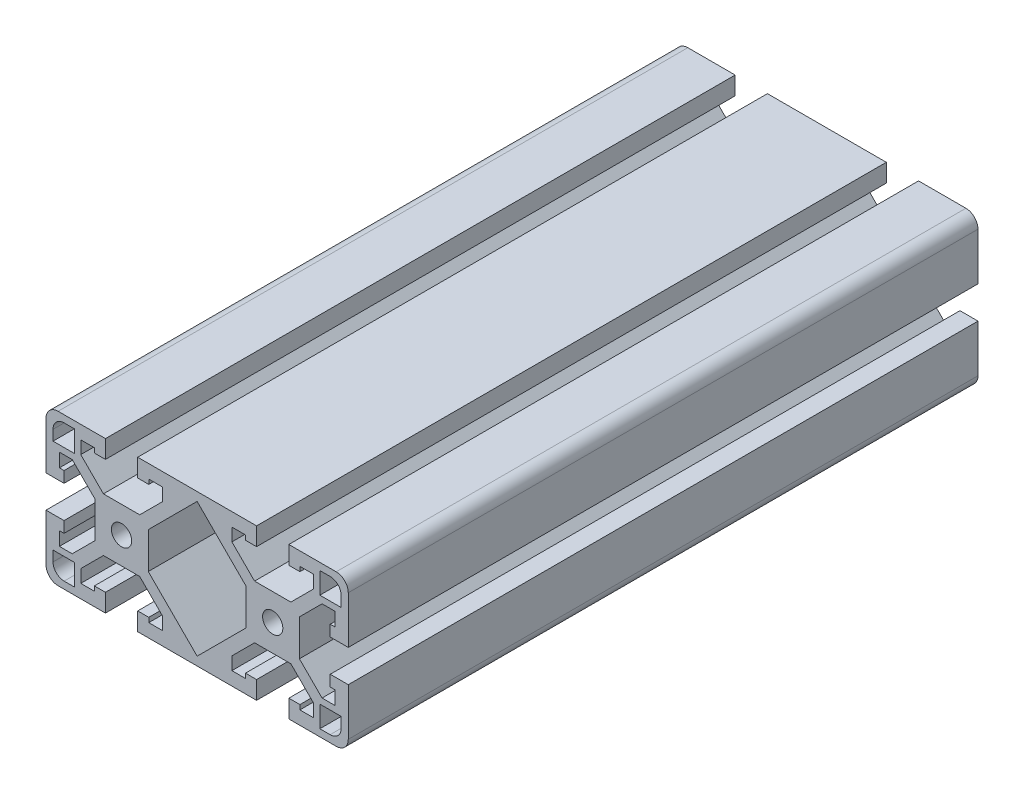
ISO-10303-21;
HEADER;
FILE_DESCRIPTION(('STEP AP214'),'2;1');
FILE_NAME('part.step','',(''),(''),'','','');
FILE_SCHEMA(('AUTOMOTIVE_DESIGN { 1 0 10303 214 1 1 1 1 }'));
ENDSEC;
DATA;
#1=APPLICATION_CONTEXT('core data for automotive mechanical design processes');
#2=APPLICATION_PROTOCOL_DEFINITION('international standard','automotive_design',2000,#1);
#3=PRODUCT_CONTEXT('',#1,'mechanical');
#4=PRODUCT('Part','Part','',(#3));
#5=PRODUCT_RELATED_PRODUCT_CATEGORY('part','',(#4));
#6=PRODUCT_DEFINITION_FORMATION('','',#4);
#7=PRODUCT_DEFINITION_CONTEXT('part definition',#1,'design');
#8=PRODUCT_DEFINITION('design','',#6,#7);
#9=PRODUCT_DEFINITION_SHAPE('','',#8);
#10=(LENGTH_UNIT() NAMED_UNIT(*) SI_UNIT(.MILLI.,.METRE.));
#11=(NAMED_UNIT(*) PLANE_ANGLE_UNIT() SI_UNIT($,.RADIAN.));
#12=(NAMED_UNIT(*) SI_UNIT($,.STERADIAN.) SOLID_ANGLE_UNIT());
#13=UNCERTAINTY_MEASURE_WITH_UNIT(LENGTH_MEASURE(1.E-05),#10,'distance_accuracy_value','');
#14=(GEOMETRIC_REPRESENTATION_CONTEXT(3) GLOBAL_UNCERTAINTY_ASSIGNED_CONTEXT((#13)) GLOBAL_UNIT_ASSIGNED_CONTEXT((#10,
#11,#12)) REPRESENTATION_CONTEXT('',''));
#15=CARTESIAN_POINT('',(0.,0.,0.));
#16=DIRECTION('',(0.,0.,1.));
#17=DIRECTION('',(1.,0.,0.));
#18=AXIS2_PLACEMENT_3D('',#15,#16,#17);
#19=CARTESIAN_POINT('',(-35.0519999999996,16.0020000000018,79.375));
#20=DIRECTION('',(0.,0.,1.));
#21=DIRECTION('',(1.,0.,0.));
#22=AXIS2_PLACEMENT_3D('',#19,#20,#21);
#23=PLANE('',#22);
#24=CARTESIAN_POINT('',(-19.0499999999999,7.41594285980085E-13,79.375));
#25=DIRECTION('',(0.,0.,1.));
#26=DIRECTION('',(1.,0.,0.));
#27=AXIS2_PLACEMENT_3D('',#24,#25,#26);
#28=CIRCLE('',#27,2.55270000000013);
#29=CARTESIAN_POINT('',(-21.6027,7.41594285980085E-13,79.375));
#30=VERTEX_POINT('',#29);
#31=EDGE_CURVE('E921',#30,#30,#28,.T.);
#32=ORIENTED_EDGE('',*,*,#31,.F.);
#33=EDGE_LOOP('',(#32));
#34=FACE_BOUND('',#33,.T.);
#35=DIRECTION('',(-0.707106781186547,0.707106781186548,0.));
#36=VECTOR('',#35,1.);
#37=CARTESIAN_POINT('',(-23.6257385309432,6.73100000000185,79.375));
#38=LINE('',#37,#36);
#39=CARTESIAN_POINT('',(-23.6257385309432,6.73100000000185,79.375));
#40=VERTEX_POINT('',#39);
#41=CARTESIAN_POINT('',(-29.3369999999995,12.4422614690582,79.375));
#42=VERTEX_POINT('',#41);
#43=EDGE_CURVE('E972',#40,#42,#38,.T.);
#44=ORIENTED_EDGE('',*,*,#43,.T.);
#45=DIRECTION('',(0.,1.,0.));
#46=VECTOR('',#45,1.);
#47=CARTESIAN_POINT('',(-29.3369999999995,12.4422614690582,79.375));
#48=LINE('',#47,#46);
#49=CARTESIAN_POINT('',(-29.3369999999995,15.6718000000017,79.375));
#50=VERTEX_POINT('',#49);
#51=EDGE_CURVE('E975',#42,#50,#48,.T.);
#52=ORIENTED_EDGE('',*,*,#51,.T.);
#53=DIRECTION('',(1.,0.,0.));
#54=VECTOR('',#53,1.);
#55=CARTESIAN_POINT('',(-29.3369999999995,15.6718000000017,79.375));
#56=LINE('',#55,#54);
#57=CARTESIAN_POINT('',(-25.9079999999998,15.6718000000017,79.375));
#58=VERTEX_POINT('',#57);
#59=EDGE_CURVE('E978',#50,#58,#56,.T.);
#60=ORIENTED_EDGE('',*,*,#59,.T.);
#61=DIRECTION('',(0.,-1.,0.));
#62=VECTOR('',#61,1.);
#63=CARTESIAN_POINT('',(-25.9079999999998,15.6718000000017,79.375));
#64=LINE('',#63,#62);
#65=CARTESIAN_POINT('',(-25.9079999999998,14.5034000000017,79.375));
#66=VERTEX_POINT('',#65);
#67=EDGE_CURVE('E980',#58,#66,#64,.T.);
#68=ORIENTED_EDGE('',*,*,#67,.T.);
#69=DIRECTION('',(1.,0.,0.));
#70=VECTOR('',#69,1.);
#71=CARTESIAN_POINT('',(-25.9079999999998,14.5034000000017,79.375));
#72=LINE('',#71,#70);
#73=CARTESIAN_POINT('',(-23.1139999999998,14.5034000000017,79.375));
#74=VERTEX_POINT('',#73);
#75=EDGE_CURVE('E982',#66,#74,#72,.T.);
#76=ORIENTED_EDGE('',*,*,#75,.T.);
#77=DIRECTION('',(0.,1.,0.));
#78=VECTOR('',#77,1.);
#79=CARTESIAN_POINT('',(-23.1139999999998,14.5034000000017,79.375));
#80=LINE('',#79,#78);
#81=CARTESIAN_POINT('',(-23.1139999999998,19.0500000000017,79.375));
#82=VERTEX_POINT('',#81);
#83=EDGE_CURVE('E984',#74,#82,#80,.T.);
#84=ORIENTED_EDGE('',*,*,#83,.T.);
#85=DIRECTION('',(-1.,0.,0.));
#86=VECTOR('',#85,1.);
#87=CARTESIAN_POINT('',(-23.1139999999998,19.0500000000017,79.375));
#88=LINE('',#87,#86);
#89=CARTESIAN_POINT('',(-35.0519999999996,19.0500000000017,79.375));
#90=VERTEX_POINT('',#89);
#91=EDGE_CURVE('E986',#82,#90,#88,.T.);
#92=ORIENTED_EDGE('',*,*,#91,.T.);
#93=CARTESIAN_POINT('',(-35.0519999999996,16.0020000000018,79.375));
#94=DIRECTION('',(0.,0.,1.));
#95=DIRECTION('',(1.,0.,0.));
#96=AXIS2_PLACEMENT_3D('',#93,#94,#95);
#97=CIRCLE('',#96,3.04799999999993);
#98=CARTESIAN_POINT('',(-38.0999999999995,16.0020000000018,79.375));
#99=VERTEX_POINT('',#98);
#100=EDGE_CURVE('E988',#90,#99,#97,.T.);
#101=ORIENTED_EDGE('',*,*,#100,.T.);
#102=DIRECTION('',(0.,-1.,0.));
#103=VECTOR('',#102,1.);
#104=CARTESIAN_POINT('',(-38.0999999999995,16.0020000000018,79.375));
#105=LINE('',#104,#103);
#106=CARTESIAN_POINT('',(-38.0999999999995,4.06400000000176,79.375));
#107=VERTEX_POINT('',#106);
#108=EDGE_CURVE('E990',#99,#107,#105,.T.);
#109=ORIENTED_EDGE('',*,*,#108,.T.);
#110=DIRECTION('',(1.,0.,0.));
#111=VECTOR('',#110,1.);
#112=CARTESIAN_POINT('',(-38.0999999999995,4.06400000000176,79.375));
#113=LINE('',#112,#111);
#114=CARTESIAN_POINT('',(-33.5533999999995,4.06400000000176,79.375));
#115=VERTEX_POINT('',#114);
#116=EDGE_CURVE('E992',#107,#115,#113,.T.);
#117=ORIENTED_EDGE('',*,*,#116,.T.);
#118=DIRECTION('',(0.,1.,0.));
#119=VECTOR('',#118,1.);
#120=CARTESIAN_POINT('',(-33.5533999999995,4.06400000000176,79.375));
#121=LINE('',#120,#119);
#122=CARTESIAN_POINT('',(-33.5533999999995,6.85800000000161,79.375));
#123=VERTEX_POINT('',#122);
#124=EDGE_CURVE('E994',#115,#123,#121,.T.);
#125=ORIENTED_EDGE('',*,*,#124,.T.);
#126=DIRECTION('',(-1.,0.,0.));
#127=VECTOR('',#126,1.);
#128=CARTESIAN_POINT('',(-33.5533999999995,6.85800000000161,79.375));
#129=LINE('',#128,#127);
#130=CARTESIAN_POINT('',(-34.7217999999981,6.85800000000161,79.375));
#131=VERTEX_POINT('',#130);
#132=EDGE_CURVE('E996',#123,#131,#129,.T.);
#133=ORIENTED_EDGE('',*,*,#132,.T.);
#134=DIRECTION('',(0.,1.,0.));
#135=VECTOR('',#134,1.);
#136=CARTESIAN_POINT('',(-34.7217999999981,6.85800000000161,79.375));
#137=LINE('',#136,#135);
#138=CARTESIAN_POINT('',(-34.7217999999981,10.2870000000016,79.375));
#139=VERTEX_POINT('',#138);
#140=EDGE_CURVE('E998',#131,#139,#137,.T.);
#141=ORIENTED_EDGE('',*,*,#140,.T.);
#142=DIRECTION('',(1.,0.,0.));
#143=VECTOR('',#142,1.);
#144=CARTESIAN_POINT('',(-34.7217999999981,10.2870000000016,79.375));
#145=LINE('',#144,#143);
#146=CARTESIAN_POINT('',(-31.492261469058,10.2870000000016,79.375));
#147=VERTEX_POINT('',#146);
#148=EDGE_CURVE('E1000',#139,#147,#145,.T.);
#149=ORIENTED_EDGE('',*,*,#148,.T.);
#150=DIRECTION('',(0.707106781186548,-0.707106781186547,0.));
#151=VECTOR('',#150,1.);
#152=CARTESIAN_POINT('',(-31.492261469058,10.2870000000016,79.375));
#153=LINE('',#152,#151);
#154=CARTESIAN_POINT('',(-25.7810000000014,4.57573853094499,79.375));
#155=VERTEX_POINT('',#154);
#156=EDGE_CURVE('E1002',#147,#155,#153,.T.);
#157=ORIENTED_EDGE('',*,*,#156,.T.);
#158=DIRECTION('',(0.,-1.,0.));
#159=VECTOR('',#158,1.);
#160=CARTESIAN_POINT('',(-25.7810000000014,4.57573853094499,79.375));
#161=LINE('',#160,#159);
#162=CARTESIAN_POINT('',(-25.7810000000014,-4.57573853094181,79.375));
#163=VERTEX_POINT('',#162);
#164=EDGE_CURVE('E1004',#155,#163,#161,.T.);
#165=ORIENTED_EDGE('',*,*,#164,.T.);
#166=DIRECTION('',(-0.707106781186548,-0.707106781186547,0.));
#167=VECTOR('',#166,1.);
#168=CARTESIAN_POINT('',(-25.7810000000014,-4.57573853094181,79.375));
#169=LINE('',#168,#167);
#170=CARTESIAN_POINT('',(-31.492261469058,-10.2869999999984,79.375));
#171=VERTEX_POINT('',#170);
#172=EDGE_CURVE('E1006',#163,#171,#169,.T.);
#173=ORIENTED_EDGE('',*,*,#172,.T.);
#174=DIRECTION('',(-1.,0.,0.));
#175=VECTOR('',#174,1.);
#176=CARTESIAN_POINT('',(-31.492261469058,-10.2869999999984,79.375));
#177=LINE('',#176,#175);
#178=CARTESIAN_POINT('',(-34.7217999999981,-10.2869999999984,79.375));
#179=VERTEX_POINT('',#178);
#180=EDGE_CURVE('E1008',#171,#179,#177,.T.);
#181=ORIENTED_EDGE('',*,*,#180,.T.);
#182=DIRECTION('',(0.,1.,0.));
#183=VECTOR('',#182,1.);
#184=CARTESIAN_POINT('',(-34.7217999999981,-10.2869999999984,79.375));
#185=LINE('',#184,#183);
#186=CARTESIAN_POINT('',(-34.7217999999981,-6.85799999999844,79.375));
#187=VERTEX_POINT('',#186);
#188=EDGE_CURVE('E1010',#179,#187,#185,.T.);
#189=ORIENTED_EDGE('',*,*,#188,.T.);
#190=DIRECTION('',(1.,0.,0.));
#191=VECTOR('',#190,1.);
#192=CARTESIAN_POINT('',(-34.7217999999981,-6.85799999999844,79.375));
#193=LINE('',#192,#191);
#194=CARTESIAN_POINT('',(-33.5533999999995,-6.85799999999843,79.375));
#195=VERTEX_POINT('',#194);
#196=EDGE_CURVE('E1012',#187,#195,#193,.T.);
#197=ORIENTED_EDGE('',*,*,#196,.T.);
#198=DIRECTION('',(0.,1.,0.));
#199=VECTOR('',#198,1.);
#200=CARTESIAN_POINT('',(-33.5533999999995,-6.85799999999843,79.375));
#201=LINE('',#200,#199);
#202=CARTESIAN_POINT('',(-33.5533999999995,-4.06399999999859,79.375));
#203=VERTEX_POINT('',#202);
#204=EDGE_CURVE('E1014',#195,#203,#201,.T.);
#205=ORIENTED_EDGE('',*,*,#204,.T.);
#206=DIRECTION('',(-1.,0.,0.));
#207=VECTOR('',#206,1.);
#208=CARTESIAN_POINT('',(-33.5533999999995,-4.06399999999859,79.375));
#209=LINE('',#208,#207);
#210=CARTESIAN_POINT('',(-38.0999999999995,-4.06399999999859,79.375));
#211=VERTEX_POINT('',#210);
#212=EDGE_CURVE('E1016',#203,#211,#209,.T.);
#213=ORIENTED_EDGE('',*,*,#212,.T.);
#214=DIRECTION('',(0.,-1.,0.));
#215=VECTOR('',#214,1.);
#216=CARTESIAN_POINT('',(-38.0999999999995,-4.06399999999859,79.375));
#217=LINE('',#216,#215);
#218=CARTESIAN_POINT('',(-38.0999999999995,-16.0019999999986,79.375));
#219=VERTEX_POINT('',#218);
#220=EDGE_CURVE('E1018',#211,#219,#217,.T.);
#221=ORIENTED_EDGE('',*,*,#220,.T.);
#222=CARTESIAN_POINT('',(-35.0519999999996,-16.0019999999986,79.375));
#223=DIRECTION('',(0.,0.,1.));
#224=DIRECTION('',(1.,0.,0.));
#225=AXIS2_PLACEMENT_3D('',#222,#223,#224);
#226=CIRCLE('',#225,3.04799999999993);
#227=CARTESIAN_POINT('',(-35.0519999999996,-19.0499999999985,79.375));
#228=VERTEX_POINT('',#227);
#229=EDGE_CURVE('E1020',#219,#228,#226,.T.);
#230=ORIENTED_EDGE('',*,*,#229,.T.);
#231=DIRECTION('',(1.,0.,0.));
#232=VECTOR('',#231,1.);
#233=CARTESIAN_POINT('',(-35.0519999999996,-19.0499999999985,79.375));
#234=LINE('',#233,#232);
#235=CARTESIAN_POINT('',(-23.1139999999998,-19.0499999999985,79.375));
#236=VERTEX_POINT('',#235);
#237=EDGE_CURVE('E1022',#228,#236,#234,.T.);
#238=ORIENTED_EDGE('',*,*,#237,.T.);
#239=DIRECTION('',(0.,1.,0.));
#240=VECTOR('',#239,1.);
#241=CARTESIAN_POINT('',(-23.1139999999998,-19.0499999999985,79.375));
#242=LINE('',#241,#240);
#243=CARTESIAN_POINT('',(-23.1139999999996,-14.5033999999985,79.375));
#244=VERTEX_POINT('',#243);
#245=EDGE_CURVE('E1024',#236,#244,#242,.T.);
#246=ORIENTED_EDGE('',*,*,#245,.T.);
#247=DIRECTION('',(-1.,0.,0.));
#248=VECTOR('',#247,1.);
#249=CARTESIAN_POINT('',(-23.1139999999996,-14.5033999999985,79.375));
#250=LINE('',#249,#248);
#251=CARTESIAN_POINT('',(-25.9079999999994,-14.5033999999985,79.375));
#252=VERTEX_POINT('',#251);
#253=EDGE_CURVE('E1026',#244,#252,#250,.T.);
#254=ORIENTED_EDGE('',*,*,#253,.T.);
#255=DIRECTION('',(0.,-1.,0.));
#256=VECTOR('',#255,1.);
#257=CARTESIAN_POINT('',(-25.9079999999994,-14.5033999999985,79.375));
#258=LINE('',#257,#256);
#259=CARTESIAN_POINT('',(-25.9079999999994,-15.6717999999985,79.375));
#260=VERTEX_POINT('',#259);
#261=EDGE_CURVE('E1028',#252,#260,#258,.T.);
#262=ORIENTED_EDGE('',*,*,#261,.T.);
#263=DIRECTION('',(-1.,0.,0.));
#264=VECTOR('',#263,1.);
#265=CARTESIAN_POINT('',(-25.9079999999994,-15.6717999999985,79.375));
#266=LINE('',#265,#264);
#267=CARTESIAN_POINT('',(-29.3369999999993,-15.6717999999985,79.375));
#268=VERTEX_POINT('',#267);
#269=EDGE_CURVE('E1030',#260,#268,#266,.T.);
#270=ORIENTED_EDGE('',*,*,#269,.T.);
#271=DIRECTION('',(0.,1.,0.));
#272=VECTOR('',#271,1.);
#273=CARTESIAN_POINT('',(-29.3369999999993,-15.6717999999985,79.375));
#274=LINE('',#273,#272);
#275=CARTESIAN_POINT('',(-29.3369999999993,-12.442261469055,79.375));
#276=VERTEX_POINT('',#275);
#277=EDGE_CURVE('E1032',#268,#276,#274,.T.);
#278=ORIENTED_EDGE('',*,*,#277,.T.);
#279=DIRECTION('',(0.70710678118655,0.707106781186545,0.));
#280=VECTOR('',#279,1.);
#281=CARTESIAN_POINT('',(-29.3369999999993,-12.442261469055,79.375));
#282=LINE('',#281,#280);
#283=CARTESIAN_POINT('',(-23.6257385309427,-6.73099999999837,79.375));
#284=VERTEX_POINT('',#283);
#285=EDGE_CURVE('E1034',#276,#284,#282,.T.);
#286=ORIENTED_EDGE('',*,*,#285,.T.);
#287=DIRECTION('',(1.,0.,0.));
#288=VECTOR('',#287,1.);
#289=CARTESIAN_POINT('',(-23.6257385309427,-6.73099999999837,79.375));
#290=LINE('',#289,#288);
#291=CARTESIAN_POINT('',(-14.4742614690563,-6.73099999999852,79.375));
#292=VERTEX_POINT('',#291);
#293=EDGE_CURVE('E1036',#284,#292,#290,.T.);
#294=ORIENTED_EDGE('',*,*,#293,.T.);
#295=DIRECTION('',(0.707106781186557,-0.707106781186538,0.));
#296=VECTOR('',#295,1.);
#297=CARTESIAN_POINT('',(-14.4742614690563,-6.73099999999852,79.375));
#298=LINE('',#297,#296);
#299=CARTESIAN_POINT('',(-8.76299999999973,-12.442261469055,79.375));
#300=VERTEX_POINT('',#299);
#301=EDGE_CURVE('E1038',#292,#300,#298,.T.);
#302=ORIENTED_EDGE('',*,*,#301,.T.);
#303=DIRECTION('',(0.,-1.,0.));
#304=VECTOR('',#303,1.);
#305=CARTESIAN_POINT('',(-8.76299999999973,-12.442261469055,79.375));
#306=LINE('',#305,#304);
#307=CARTESIAN_POINT('',(-8.76299999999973,-15.6717999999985,79.375));
#308=VERTEX_POINT('',#307);
#309=EDGE_CURVE('E1040',#300,#308,#306,.T.);
#310=ORIENTED_EDGE('',*,*,#309,.T.);
#311=DIRECTION('',(-1.,0.,0.));
#312=VECTOR('',#311,1.);
#313=CARTESIAN_POINT('',(-8.76299999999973,-15.6717999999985,79.375));
#314=LINE('',#313,#312);
#315=CARTESIAN_POINT('',(-12.1919999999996,-15.6717999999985,79.375));
#316=VERTEX_POINT('',#315);
#317=EDGE_CURVE('E1042',#308,#316,#314,.T.);
#318=ORIENTED_EDGE('',*,*,#317,.T.);
#319=DIRECTION('',(0.,1.,0.));
#320=VECTOR('',#319,1.);
#321=CARTESIAN_POINT('',(-12.1919999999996,-15.6717999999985,79.375));
#322=LINE('',#321,#320);
#323=CARTESIAN_POINT('',(-12.1919999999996,-14.5033999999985,79.375));
#324=VERTEX_POINT('',#323);
#325=EDGE_CURVE('E1044',#316,#324,#322,.T.);
#326=ORIENTED_EDGE('',*,*,#325,.T.);
#327=DIRECTION('',(-1.,0.,0.));
#328=VECTOR('',#327,1.);
#329=CARTESIAN_POINT('',(-12.1919999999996,-14.5033999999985,79.375));
#330=LINE('',#329,#328);
#331=CARTESIAN_POINT('',(-14.9859999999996,-14.5033999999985,79.375));
#332=VERTEX_POINT('',#331);
#333=EDGE_CURVE('E1046',#324,#332,#330,.T.);
#334=ORIENTED_EDGE('',*,*,#333,.T.);
#335=DIRECTION('',(0.,-1.,0.));
#336=VECTOR('',#335,1.);
#337=CARTESIAN_POINT('',(-14.9859999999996,-14.5033999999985,79.375));
#338=LINE('',#337,#336);
#339=CARTESIAN_POINT('',(-14.9859999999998,-19.0499999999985,79.375));
#340=VERTEX_POINT('',#339);
#341=EDGE_CURVE('E1048',#332,#340,#338,.T.);
#342=ORIENTED_EDGE('',*,*,#341,.T.);
#343=DIRECTION('',(1.,0.,0.));
#344=VECTOR('',#343,1.);
#345=CARTESIAN_POINT('',(-14.9859999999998,-19.0499999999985,79.375));
#346=LINE('',#345,#344);
#347=CARTESIAN_POINT('',(14.986,-19.0499999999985,79.375));
#348=VERTEX_POINT('',#347);
#349=EDGE_CURVE('E1050',#340,#348,#346,.T.);
#350=ORIENTED_EDGE('',*,*,#349,.T.);
#351=DIRECTION('',(0.,1.,0.));
#352=VECTOR('',#351,1.);
#353=CARTESIAN_POINT('',(14.986,-19.0499999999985,79.375));
#354=LINE('',#353,#352);
#355=CARTESIAN_POINT('',(14.9859999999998,-14.5033999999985,79.375));
#356=VERTEX_POINT('',#355);
#357=EDGE_CURVE('E1052',#348,#356,#354,.T.);
#358=ORIENTED_EDGE('',*,*,#357,.T.);
#359=DIRECTION('',(-1.,0.,0.));
#360=VECTOR('',#359,1.);
#361=CARTESIAN_POINT('',(14.9859999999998,-14.5033999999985,79.375));
#362=LINE('',#361,#360);
#363=CARTESIAN_POINT('',(12.1919999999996,-14.5033999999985,79.375));
#364=VERTEX_POINT('',#363);
#365=EDGE_CURVE('E1054',#356,#364,#362,.T.);
#366=ORIENTED_EDGE('',*,*,#365,.T.);
#367=DIRECTION('',(0.,-1.,0.));
#368=VECTOR('',#367,1.);
#369=CARTESIAN_POINT('',(12.1919999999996,-14.5033999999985,79.375));
#370=LINE('',#369,#368);
#371=CARTESIAN_POINT('',(12.1919999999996,-15.6717999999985,79.375));
#372=VERTEX_POINT('',#371);
#373=EDGE_CURVE('E1056',#364,#372,#370,.T.);
#374=ORIENTED_EDGE('',*,*,#373,.T.);
#375=DIRECTION('',(-1.,0.,0.));
#376=VECTOR('',#375,1.);
#377=CARTESIAN_POINT('',(12.1919999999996,-15.6717999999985,79.375));
#378=LINE('',#377,#376);
#379=CARTESIAN_POINT('',(8.76299999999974,-15.6717999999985,79.375));
#380=VERTEX_POINT('',#379);
#381=EDGE_CURVE('E1058',#372,#380,#378,.T.);
#382=ORIENTED_EDGE('',*,*,#381,.T.);
#383=DIRECTION('',(0.,1.,0.));
#384=VECTOR('',#383,1.);
#385=CARTESIAN_POINT('',(8.76299999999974,-15.6717999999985,79.375));
#386=LINE('',#385,#384);
#387=CARTESIAN_POINT('',(8.76299999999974,-12.442261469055,79.375));
#388=VERTEX_POINT('',#387);
#389=EDGE_CURVE('E1060',#380,#388,#386,.T.);
#390=ORIENTED_EDGE('',*,*,#389,.T.);
#391=DIRECTION('',(0.70710678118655,0.707106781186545,0.));
#392=VECTOR('',#391,1.);
#393=CARTESIAN_POINT('',(8.76299999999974,-12.442261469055,79.375));
#394=LINE('',#393,#392);
#395=CARTESIAN_POINT('',(14.4742614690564,-6.73099999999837,79.375));
#396=VERTEX_POINT('',#395);
#397=EDGE_CURVE('E1062',#388,#396,#394,.T.);
#398=ORIENTED_EDGE('',*,*,#397,.T.);
#399=DIRECTION('',(1.,0.,0.));
#400=VECTOR('',#399,1.);
#401=CARTESIAN_POINT('',(14.4742614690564,-6.73099999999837,79.375));
#402=LINE('',#401,#400);
#403=CARTESIAN_POINT('',(23.6257385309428,-6.73099999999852,79.375));
#404=VERTEX_POINT('',#403);
#405=EDGE_CURVE('E1064',#396,#404,#402,.T.);
#406=ORIENTED_EDGE('',*,*,#405,.T.);
#407=DIRECTION('',(0.707106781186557,-0.707106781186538,0.));
#408=VECTOR('',#407,1.);
#409=CARTESIAN_POINT('',(23.6257385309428,-6.73099999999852,79.375));
#410=LINE('',#409,#408);
#411=CARTESIAN_POINT('',(29.3369999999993,-12.442261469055,79.375));
#412=VERTEX_POINT('',#411);
#413=EDGE_CURVE('E1066',#404,#412,#410,.T.);
#414=ORIENTED_EDGE('',*,*,#413,.T.);
#415=DIRECTION('',(0.,-1.,0.));
#416=VECTOR('',#415,1.);
#417=CARTESIAN_POINT('',(29.3369999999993,-12.442261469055,79.375));
#418=LINE('',#417,#416);
#419=CARTESIAN_POINT('',(29.3369999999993,-15.6717999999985,79.375));
#420=VERTEX_POINT('',#419);
#421=EDGE_CURVE('E1068',#412,#420,#418,.T.);
#422=ORIENTED_EDGE('',*,*,#421,.T.);
#423=DIRECTION('',(-1.,0.,0.));
#424=VECTOR('',#423,1.);
#425=CARTESIAN_POINT('',(29.3369999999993,-15.6717999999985,79.375));
#426=LINE('',#425,#424);
#427=CARTESIAN_POINT('',(25.9079999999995,-15.6717999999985,79.375));
#428=VERTEX_POINT('',#427);
#429=EDGE_CURVE('E1070',#420,#428,#426,.T.);
#430=ORIENTED_EDGE('',*,*,#429,.T.);
#431=DIRECTION('',(0.,1.,0.));
#432=VECTOR('',#431,1.);
#433=CARTESIAN_POINT('',(25.9079999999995,-15.6717999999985,79.375));
#434=LINE('',#433,#432);
#435=CARTESIAN_POINT('',(25.9079999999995,-14.5033999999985,79.375));
#436=VERTEX_POINT('',#435);
#437=EDGE_CURVE('E1072',#428,#436,#434,.T.);
#438=ORIENTED_EDGE('',*,*,#437,.T.);
#439=DIRECTION('',(-1.,0.,0.));
#440=VECTOR('',#439,1.);
#441=CARTESIAN_POINT('',(25.9079999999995,-14.5033999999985,79.375));
#442=LINE('',#441,#440);
#443=CARTESIAN_POINT('',(23.1139999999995,-14.5033999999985,79.375));
#444=VERTEX_POINT('',#443);
#445=EDGE_CURVE('E1074',#436,#444,#442,.T.);
#446=ORIENTED_EDGE('',*,*,#445,.T.);
#447=DIRECTION('',(0.,-1.,0.));
#448=VECTOR('',#447,1.);
#449=CARTESIAN_POINT('',(23.1139999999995,-14.5033999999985,79.375));
#450=LINE('',#449,#448);
#451=CARTESIAN_POINT('',(23.1139999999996,-19.0499999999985,79.375));
#452=VERTEX_POINT('',#451);
#453=EDGE_CURVE('E1076',#444,#452,#450,.T.);
#454=ORIENTED_EDGE('',*,*,#453,.T.);
#455=DIRECTION('',(1.,0.,0.));
#456=VECTOR('',#455,1.);
#457=CARTESIAN_POINT('',(23.1139999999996,-19.0499999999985,79.375));
#458=LINE('',#457,#456);
#459=CARTESIAN_POINT('',(35.0519999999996,-19.0499999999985,79.375));
#460=VERTEX_POINT('',#459);
#461=EDGE_CURVE('E1078',#452,#460,#458,.T.);
#462=ORIENTED_EDGE('',*,*,#461,.T.);
#463=CARTESIAN_POINT('',(35.0519999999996,-16.0019999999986,79.375));
#464=DIRECTION('',(0.,0.,1.));
#465=DIRECTION('',(1.,0.,0.));
#466=AXIS2_PLACEMENT_3D('',#463,#464,#465);
#467=CIRCLE('',#466,3.04799999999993);
#468=CARTESIAN_POINT('',(38.0999999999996,-16.0019999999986,79.375));
#469=VERTEX_POINT('',#468);
#470=EDGE_CURVE('E1080',#460,#469,#467,.T.);
#471=ORIENTED_EDGE('',*,*,#470,.T.);
#472=DIRECTION('',(0.,1.,0.));
#473=VECTOR('',#472,1.);
#474=CARTESIAN_POINT('',(38.0999999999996,-16.0019999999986,79.375));
#475=LINE('',#474,#473);
#476=CARTESIAN_POINT('',(38.0999999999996,-4.06399999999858,79.375));
#477=VERTEX_POINT('',#476);
#478=EDGE_CURVE('E1082',#469,#477,#475,.T.);
#479=ORIENTED_EDGE('',*,*,#478,.T.);
#480=DIRECTION('',(-1.,0.,0.));
#481=VECTOR('',#480,1.);
#482=CARTESIAN_POINT('',(38.0999999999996,-4.06399999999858,79.375));
#483=LINE('',#482,#481);
#484=CARTESIAN_POINT('',(33.5533999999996,-4.06399999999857,79.375));
#485=VERTEX_POINT('',#484);
#486=EDGE_CURVE('E1084',#477,#485,#483,.T.);
#487=ORIENTED_EDGE('',*,*,#486,.T.);
#488=DIRECTION('',(0.,-1.,0.));
#489=VECTOR('',#488,1.);
#490=CARTESIAN_POINT('',(33.5533999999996,-4.06399999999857,79.375));
#491=LINE('',#490,#489);
#492=CARTESIAN_POINT('',(33.5533999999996,-6.85799999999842,79.375));
#493=VERTEX_POINT('',#492);
#494=EDGE_CURVE('E1086',#485,#493,#491,.T.);
#495=ORIENTED_EDGE('',*,*,#494,.T.);
#496=DIRECTION('',(1.,0.,0.));
#497=VECTOR('',#496,1.);
#498=CARTESIAN_POINT('',(33.5533999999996,-6.85799999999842,79.375));
#499=LINE('',#498,#497);
#500=CARTESIAN_POINT('',(34.7217999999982,-6.85799999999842,79.375));
#501=VERTEX_POINT('',#500);
#502=EDGE_CURVE('E1088',#493,#501,#499,.T.);
#503=ORIENTED_EDGE('',*,*,#502,.T.);
#504=DIRECTION('',(0.,-1.,0.));
#505=VECTOR('',#504,1.);
#506=CARTESIAN_POINT('',(34.7217999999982,-6.85799999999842,79.375));
#507=LINE('',#506,#505);
#508=CARTESIAN_POINT('',(34.7217999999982,-10.2869999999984,79.375));
#509=VERTEX_POINT('',#508);
#510=EDGE_CURVE('E1090',#501,#509,#507,.T.);
#511=ORIENTED_EDGE('',*,*,#510,.T.);
#512=DIRECTION('',(-1.,0.,0.));
#513=VECTOR('',#512,1.);
#514=CARTESIAN_POINT('',(34.7217999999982,-10.2869999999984,79.375));
#515=LINE('',#514,#513);
#516=CARTESIAN_POINT('',(31.492261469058,-10.2869999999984,79.375));
#517=VERTEX_POINT('',#516);
#518=EDGE_CURVE('E1092',#509,#517,#515,.T.);
#519=ORIENTED_EDGE('',*,*,#518,.T.);
#520=DIRECTION('',(-0.707106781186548,0.707106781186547,0.));
#521=VECTOR('',#520,1.);
#522=CARTESIAN_POINT('',(31.492261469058,-10.2869999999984,79.375));
#523=LINE('',#522,#521);
#524=CARTESIAN_POINT('',(25.7810000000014,-4.5757385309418,79.375));
#525=VERTEX_POINT('',#524);
#526=EDGE_CURVE('E1094',#517,#525,#523,.T.);
#527=ORIENTED_EDGE('',*,*,#526,.T.);
#528=DIRECTION('',(0.,1.,0.));
#529=VECTOR('',#528,1.);
#530=CARTESIAN_POINT('',(25.7810000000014,-4.5757385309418,79.375));
#531=LINE('',#530,#529);
#532=CARTESIAN_POINT('',(25.7810000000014,4.57573853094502,79.375));
#533=VERTEX_POINT('',#532);
#534=EDGE_CURVE('E1096',#525,#533,#531,.T.);
#535=ORIENTED_EDGE('',*,*,#534,.T.);
#536=DIRECTION('',(0.707106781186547,0.707106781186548,0.));
#537=VECTOR('',#536,1.);
#538=CARTESIAN_POINT('',(25.7810000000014,4.57573853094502,79.375));
#539=LINE('',#538,#537);
#540=CARTESIAN_POINT('',(31.492261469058,10.2870000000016,79.375));
#541=VERTEX_POINT('',#540);
#542=EDGE_CURVE('E1098',#533,#541,#539,.T.);
#543=ORIENTED_EDGE('',*,*,#542,.T.);
#544=DIRECTION('',(1.,0.,0.));
#545=VECTOR('',#544,1.);
#546=CARTESIAN_POINT('',(31.492261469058,10.2870000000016,79.375));
#547=LINE('',#546,#545);
#548=CARTESIAN_POINT('',(34.7217999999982,10.2870000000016,79.375));
#549=VERTEX_POINT('',#548);
#550=EDGE_CURVE('E1100',#541,#549,#547,.T.);
#551=ORIENTED_EDGE('',*,*,#550,.T.);
#552=DIRECTION('',(0.,-1.,0.));
#553=VECTOR('',#552,1.);
#554=CARTESIAN_POINT('',(34.7217999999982,10.2870000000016,79.375));
#555=LINE('',#554,#553);
#556=CARTESIAN_POINT('',(34.7217999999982,6.85800000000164,79.375));
#557=VERTEX_POINT('',#556);
#558=EDGE_CURVE('E1102',#549,#557,#555,.T.);
#559=ORIENTED_EDGE('',*,*,#558,.T.);
#560=DIRECTION('',(-1.,0.,0.));
#561=VECTOR('',#560,1.);
#562=CARTESIAN_POINT('',(34.7217999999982,6.85800000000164,79.375));
#563=LINE('',#562,#561);
#564=CARTESIAN_POINT('',(33.5533999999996,6.85800000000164,79.375));
#565=VERTEX_POINT('',#564);
#566=EDGE_CURVE('E1104',#557,#565,#563,.T.);
#567=ORIENTED_EDGE('',*,*,#566,.T.);
#568=DIRECTION('',(0.,-1.,0.));
#569=VECTOR('',#568,1.);
#570=CARTESIAN_POINT('',(33.5533999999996,6.85800000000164,79.375));
#571=LINE('',#570,#569);
#572=CARTESIAN_POINT('',(33.5533999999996,4.06400000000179,79.375));
#573=VERTEX_POINT('',#572);
#574=EDGE_CURVE('E1106',#565,#573,#571,.T.);
#575=ORIENTED_EDGE('',*,*,#574,.T.);
#576=DIRECTION('',(1.,0.,0.));
#577=VECTOR('',#576,1.);
#578=CARTESIAN_POINT('',(33.5533999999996,4.06400000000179,79.375));
#579=LINE('',#578,#577);
#580=CARTESIAN_POINT('',(38.0999999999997,4.06400000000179,79.375));
#581=VERTEX_POINT('',#580);
#582=EDGE_CURVE('E1108',#573,#581,#579,.T.);
#583=ORIENTED_EDGE('',*,*,#582,.T.);
#584=DIRECTION('',(0.,1.,0.));
#585=VECTOR('',#584,1.);
#586=CARTESIAN_POINT('',(38.0999999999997,4.06400000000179,79.375));
#587=LINE('',#586,#585);
#588=CARTESIAN_POINT('',(38.0999999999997,16.0020000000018,79.375));
#589=VERTEX_POINT('',#588);
#590=EDGE_CURVE('E1110',#581,#589,#587,.T.);
#591=ORIENTED_EDGE('',*,*,#590,.T.);
#592=CARTESIAN_POINT('',(35.0519999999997,16.0020000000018,79.375));
#593=DIRECTION('',(0.,0.,1.));
#594=DIRECTION('',(1.,0.,0.));
#595=AXIS2_PLACEMENT_3D('',#592,#593,#594);
#596=CIRCLE('',#595,3.04799999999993);
#597=CARTESIAN_POINT('',(35.0519999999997,19.0500000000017,79.375));
#598=VERTEX_POINT('',#597);
#599=EDGE_CURVE('E1112',#589,#598,#596,.T.);
#600=ORIENTED_EDGE('',*,*,#599,.T.);
#601=DIRECTION('',(-1.,0.,0.));
#602=VECTOR('',#601,1.);
#603=CARTESIAN_POINT('',(35.0519999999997,19.0500000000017,79.375));
#604=LINE('',#603,#602);
#605=CARTESIAN_POINT('',(23.114,19.0500000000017,79.375));
#606=VERTEX_POINT('',#605);
#607=EDGE_CURVE('E1114',#598,#606,#604,.T.);
#608=ORIENTED_EDGE('',*,*,#607,.T.);
#609=DIRECTION('',(0.,-1.,0.));
#610=VECTOR('',#609,1.);
#611=CARTESIAN_POINT('',(23.114,19.0500000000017,79.375));
#612=LINE('',#611,#610);
#613=CARTESIAN_POINT('',(23.114,14.5034000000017,79.375));
#614=VERTEX_POINT('',#613);
#615=EDGE_CURVE('E1116',#606,#614,#612,.T.);
#616=ORIENTED_EDGE('',*,*,#615,.T.);
#617=DIRECTION('',(1.,0.,0.));
#618=VECTOR('',#617,1.);
#619=CARTESIAN_POINT('',(23.114,14.5034000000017,79.375));
#620=LINE('',#619,#618);
#621=CARTESIAN_POINT('',(25.908,14.5034000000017,79.375));
#622=VERTEX_POINT('',#621);
#623=EDGE_CURVE('E1118',#614,#622,#620,.T.);
#624=ORIENTED_EDGE('',*,*,#623,.T.);
#625=DIRECTION('',(0.,1.,0.));
#626=VECTOR('',#625,1.);
#627=CARTESIAN_POINT('',(25.908,14.5034000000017,79.375));
#628=LINE('',#627,#626);
#629=CARTESIAN_POINT('',(25.908,15.6718000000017,79.375));
#630=VERTEX_POINT('',#629);
#631=EDGE_CURVE('E1120',#622,#630,#628,.T.);
#632=ORIENTED_EDGE('',*,*,#631,.T.);
#633=DIRECTION('',(1.,0.,0.));
#634=VECTOR('',#633,1.);
#635=CARTESIAN_POINT('',(25.908,15.6718000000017,79.375));
#636=LINE('',#635,#634);
#637=CARTESIAN_POINT('',(29.3369999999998,15.6718000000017,79.375));
#638=VERTEX_POINT('',#637);
#639=EDGE_CURVE('E1122',#630,#638,#636,.T.);
#640=ORIENTED_EDGE('',*,*,#639,.T.);
#641=DIRECTION('',(0.,-1.,0.));
#642=VECTOR('',#641,1.);
#643=CARTESIAN_POINT('',(29.3369999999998,15.6718000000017,79.375));
#644=LINE('',#643,#642);
#645=CARTESIAN_POINT('',(29.3369999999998,12.4422614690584,79.375));
#646=VERTEX_POINT('',#645);
#647=EDGE_CURVE('E1124',#638,#646,#644,.T.);
#648=ORIENTED_EDGE('',*,*,#647,.T.);
#649=DIRECTION('',(-0.707106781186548,-0.707106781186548,0.));
#650=VECTOR('',#649,1.);
#651=CARTESIAN_POINT('',(29.3369999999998,12.4422614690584,79.375));
#652=LINE('',#651,#650);
#653=CARTESIAN_POINT('',(23.6257385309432,6.73100000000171,79.375));
#654=VERTEX_POINT('',#653);
#655=EDGE_CURVE('E1126',#646,#654,#652,.T.);
#656=ORIENTED_EDGE('',*,*,#655,.T.);
#657=DIRECTION('',(-1.,0.,0.));
#658=VECTOR('',#657,1.);
#659=CARTESIAN_POINT('',(23.6257385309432,6.73100000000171,79.375));
#660=LINE('',#659,#658);
#661=CARTESIAN_POINT('',(14.4742614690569,6.73100000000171,79.375));
#662=VERTEX_POINT('',#661);
#663=EDGE_CURVE('E1128',#654,#662,#660,.T.);
#664=ORIENTED_EDGE('',*,*,#663,.T.);
#665=DIRECTION('',(-0.707106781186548,0.707106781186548,0.));
#666=VECTOR('',#665,1.);
#667=CARTESIAN_POINT('',(14.4742614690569,6.73100000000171,79.375));
#668=LINE('',#667,#666);
#669=CARTESIAN_POINT('',(8.7630000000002,12.4422614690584,79.375));
#670=VERTEX_POINT('',#669);
#671=EDGE_CURVE('E1130',#662,#670,#668,.T.);
#672=ORIENTED_EDGE('',*,*,#671,.T.);
#673=DIRECTION('',(0.,1.,0.));
#674=VECTOR('',#673,1.);
#675=CARTESIAN_POINT('',(8.7630000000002,12.4422614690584,79.375));
#676=LINE('',#675,#674);
#677=CARTESIAN_POINT('',(8.7630000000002,15.671800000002,79.375));
#678=VERTEX_POINT('',#677);
#679=EDGE_CURVE('E1132',#670,#678,#676,.T.);
#680=ORIENTED_EDGE('',*,*,#679,.T.);
#681=DIRECTION('',(1.,0.,0.));
#682=VECTOR('',#681,1.);
#683=CARTESIAN_POINT('',(8.7630000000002,15.671800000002,79.375));
#684=LINE('',#683,#682);
#685=CARTESIAN_POINT('',(12.1920000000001,15.671800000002,79.375));
#686=VERTEX_POINT('',#685);
#687=EDGE_CURVE('E1134',#678,#686,#684,.T.);
#688=ORIENTED_EDGE('',*,*,#687,.T.);
#689=DIRECTION('',(0.,-1.,0.));
#690=VECTOR('',#689,1.);
#691=CARTESIAN_POINT('',(12.1920000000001,15.671800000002,79.375));
#692=LINE('',#691,#690);
#693=CARTESIAN_POINT('',(12.1920000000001,14.503400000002,79.375));
#694=VERTEX_POINT('',#693);
#695=EDGE_CURVE('E1136',#686,#694,#692,.T.);
#696=ORIENTED_EDGE('',*,*,#695,.T.);
#697=DIRECTION('',(1.,0.,0.));
#698=VECTOR('',#697,1.);
#699=CARTESIAN_POINT('',(12.1920000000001,14.503400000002,79.375));
#700=LINE('',#699,#698);
#701=CARTESIAN_POINT('',(14.9860000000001,14.503400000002,79.375));
#702=VERTEX_POINT('',#701);
#703=EDGE_CURVE('E1138',#694,#702,#700,.T.);
#704=ORIENTED_EDGE('',*,*,#703,.T.);
#705=DIRECTION('',(0.,1.,0.));
#706=VECTOR('',#705,1.);
#707=CARTESIAN_POINT('',(14.9860000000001,14.503400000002,79.375));
#708=LINE('',#707,#706);
#709=CARTESIAN_POINT('',(14.9860000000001,19.050000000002,79.375));
#710=VERTEX_POINT('',#709);
#711=EDGE_CURVE('E1140',#702,#710,#708,.T.);
#712=ORIENTED_EDGE('',*,*,#711,.T.);
#713=DIRECTION('',(-1.,0.,0.));
#714=VECTOR('',#713,1.);
#715=CARTESIAN_POINT('',(14.9860000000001,19.050000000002,79.375));
#716=LINE('',#715,#714);
#717=CARTESIAN_POINT('',(-14.9859999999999,19.050000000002,79.375));
#718=VERTEX_POINT('',#717);
#719=EDGE_CURVE('E1142',#710,#718,#716,.T.);
#720=ORIENTED_EDGE('',*,*,#719,.T.);
#721=DIRECTION('',(0.,-1.,0.));
#722=VECTOR('',#721,1.);
#723=CARTESIAN_POINT('',(-14.9859999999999,19.050000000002,79.375));
#724=LINE('',#723,#722);
#725=CARTESIAN_POINT('',(-14.9859999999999,14.503400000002,79.375));
#726=VERTEX_POINT('',#725);
#727=EDGE_CURVE('E1144',#718,#726,#724,.T.);
#728=ORIENTED_EDGE('',*,*,#727,.T.);
#729=DIRECTION('',(1.,0.,0.));
#730=VECTOR('',#729,1.);
#731=CARTESIAN_POINT('',(-14.9859999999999,14.503400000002,79.375));
#732=LINE('',#731,#730);
#733=CARTESIAN_POINT('',(-12.1919999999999,14.503400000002,79.375));
#734=VERTEX_POINT('',#733);
#735=EDGE_CURVE('E1146',#726,#734,#732,.T.);
#736=ORIENTED_EDGE('',*,*,#735,.T.);
#737=DIRECTION('',(0.,1.,0.));
#738=VECTOR('',#737,1.);
#739=CARTESIAN_POINT('',(-12.1919999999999,14.503400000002,79.375));
#740=LINE('',#739,#738);
#741=CARTESIAN_POINT('',(-12.1919999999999,15.671800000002,79.375));
#742=VERTEX_POINT('',#741);
#743=EDGE_CURVE('E1148',#734,#742,#740,.T.);
#744=ORIENTED_EDGE('',*,*,#743,.T.);
#745=DIRECTION('',(1.,0.,0.));
#746=VECTOR('',#745,1.);
#747=CARTESIAN_POINT('',(-12.1919999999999,15.671800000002,79.375));
#748=LINE('',#747,#746);
#749=CARTESIAN_POINT('',(-8.76300000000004,15.671800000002,79.375));
#750=VERTEX_POINT('',#749);
#751=EDGE_CURVE('E1150',#742,#750,#748,.T.);
#752=ORIENTED_EDGE('',*,*,#751,.T.);
#753=DIRECTION('',(0.,-1.,0.));
#754=VECTOR('',#753,1.);
#755=CARTESIAN_POINT('',(-8.76300000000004,15.671800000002,79.375));
#756=LINE('',#755,#754);
#757=CARTESIAN_POINT('',(-8.76300000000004,12.4422614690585,79.375));
#758=VERTEX_POINT('',#757);
#759=EDGE_CURVE('E1152',#750,#758,#756,.T.);
#760=ORIENTED_EDGE('',*,*,#759,.T.);
#761=DIRECTION('',(-0.707106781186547,-0.707106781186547,0.));
#762=VECTOR('',#761,1.);
#763=CARTESIAN_POINT('',(-8.76300000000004,12.4422614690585,79.375));
#764=LINE('',#763,#762);
#765=CARTESIAN_POINT('',(-14.4742614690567,6.73100000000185,79.375));
#766=VERTEX_POINT('',#765);
#767=EDGE_CURVE('E1154',#758,#766,#764,.T.);
#768=ORIENTED_EDGE('',*,*,#767,.T.);
#769=DIRECTION('',(-1.,0.,0.));
#770=VECTOR('',#769,1.);
#771=CARTESIAN_POINT('',(-14.4742614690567,6.73100000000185,79.375));
#772=LINE('',#771,#770);
#773=EDGE_CURVE('E1156',#766,#40,#772,.T.);
#774=ORIENTED_EDGE('',*,*,#773,.T.);
#775=EDGE_LOOP('',(#44,#52,#60,#68,#76,#84,#92,#101,#109,#117,#125,#133,#141,#149,#157,#165,
#173,#181,#189,#197,#205,#213,#221,#230,#238,#246,#254,#262,#270,#278,#286,#294,#302,#310,#318,
#326,#334,#342,#350,#358,#366,#374,#382,#390,#398,#406,#414,#422,#430,#438,#446,#454,#462,#471,
#479,#487,#495,#503,#511,#519,#527,#535,#543,#551,#559,#567,#575,#583,#591,#600,#608,#616,#624,
#632,#640,#648,#656,#664,#672,#680,#688,#696,#704,#712,#720,#728,#736,#744,#752,#760,#768,#774));
#776=FACE_BOUND('',#775,.T.);
#777=DIRECTION('',(0.707106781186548,0.707106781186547,0.));
#778=VECTOR('',#777,1.);
#779=CARTESIAN_POINT('',(0.,-16.8947385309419,79.375));
#780=LINE('',#779,#778);
#781=CARTESIAN_POINT('',(0.,-16.8947385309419,79.375));
#782=VERTEX_POINT('',#781);
#783=CARTESIAN_POINT('',(12.3189999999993,-4.57573853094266,79.375));
#784=VERTEX_POINT('',#783);
#785=EDGE_CURVE('E929',#782,#784,#780,.T.);
#786=ORIENTED_EDGE('',*,*,#785,.F.);
#787=DIRECTION('',(0.707106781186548,-0.707106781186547,0.));
#788=VECTOR('',#787,1.);
#789=CARTESIAN_POINT('',(-12.3189999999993,-4.57573853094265,79.375));
#790=LINE('',#789,#788);
#791=CARTESIAN_POINT('',(-12.3189999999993,-4.57573853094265,79.375));
#792=VERTEX_POINT('',#791);
#793=EDGE_CURVE('E927',#792,#782,#790,.T.);
#794=ORIENTED_EDGE('',*,*,#793,.F.);
#795=DIRECTION('',(0.,-1.,0.));
#796=VECTOR('',#795,1.);
#797=CARTESIAN_POINT('',(-12.3189999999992,4.57573853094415,79.375));
#798=LINE('',#797,#796);
#799=CARTESIAN_POINT('',(-12.3189999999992,4.57573853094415,79.375));
#800=VERTEX_POINT('',#799);
#801=EDGE_CURVE('E939',#800,#792,#798,.T.);
#802=ORIENTED_EDGE('',*,*,#801,.F.);
#803=DIRECTION('',(-0.707106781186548,-0.707106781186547,0.));
#804=VECTOR('',#803,1.);
#805=CARTESIAN_POINT('',(0.,16.8947385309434,79.375));
#806=LINE('',#805,#804);
#807=CARTESIAN_POINT('',(0.,16.8947385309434,79.375));
#808=VERTEX_POINT('',#807);
#809=EDGE_CURVE('E936',#808,#800,#806,.T.);
#810=ORIENTED_EDGE('',*,*,#809,.F.);
#811=DIRECTION('',(-0.707106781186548,0.707106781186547,0.));
#812=VECTOR('',#811,1.);
#813=CARTESIAN_POINT('',(12.3189999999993,4.57573853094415,79.375));
#814=LINE('',#813,#812);
#815=CARTESIAN_POINT('',(12.3189999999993,4.57573853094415,79.375));
#816=VERTEX_POINT('',#815);
#817=EDGE_CURVE('E934',#816,#808,#814,.T.);
#818=ORIENTED_EDGE('',*,*,#817,.F.);
#819=DIRECTION('',(0.,1.,0.));
#820=VECTOR('',#819,1.);
#821=CARTESIAN_POINT('',(12.3189999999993,-4.57573853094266,79.375));
#822=LINE('',#821,#820);
#823=EDGE_CURVE('E932',#784,#816,#822,.T.);
#824=ORIENTED_EDGE('',*,*,#823,.F.);
#825=EDGE_LOOP('',(#786,#794,#802,#810,#818,#824));
#826=FACE_BOUND('',#825,.T.);
#827=CARTESIAN_POINT('',(19.0499999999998,7.50267903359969E-13,79.375));
#828=DIRECTION('',(0.,0.,1.));
#829=DIRECTION('',(1.,0.,0.));
#830=AXIS2_PLACEMENT_3D('',#827,#828,#829);
#831=CIRCLE('',#830,2.5527);
#832=CARTESIAN_POINT('',(16.4972999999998,7.50267903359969E-13,79.375));
#833=VERTEX_POINT('',#832);
#834=EDGE_CURVE('E915',#833,#833,#831,.T.);
#835=ORIENTED_EDGE('',*,*,#834,.F.);
#836=EDGE_LOOP('',(#835));
#837=FACE_BOUND('',#836,.T.);
#838=CARTESIAN_POINT('',(-33.5279999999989,14.478,79.375));
#839=DIRECTION('',(0.,0.,1.));
#840=DIRECTION('',(1.,0.,0.));
#841=AXIS2_PLACEMENT_3D('',#838,#839,#840);
#842=CIRCLE('',#841,2.794);
#843=CARTESIAN_POINT('',(-33.5279999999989,17.272,79.375));
#844=VERTEX_POINT('',#843);
#845=CARTESIAN_POINT('',(-36.3219999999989,14.478,79.375));
#846=VERTEX_POINT('',#845);
#847=EDGE_CURVE('E879',#844,#846,#842,.T.);
#848=ORIENTED_EDGE('',*,*,#847,.F.);
#849=DIRECTION('',(-1.,0.,0.));
#850=VECTOR('',#849,1.);
#851=CARTESIAN_POINT('',(-30.9372,17.272,79.375));
#852=LINE('',#851,#850);
#853=CARTESIAN_POINT('',(-30.9372,17.272,79.375));
#854=VERTEX_POINT('',#853);
#855=EDGE_CURVE('E877',#854,#844,#852,.T.);
#856=ORIENTED_EDGE('',*,*,#855,.F.);
#857=DIRECTION('',(0.,1.,0.));
#858=VECTOR('',#857,1.);
#859=CARTESIAN_POINT('',(-30.9372,11.8872,79.375));
#860=LINE('',#859,#858);
#861=CARTESIAN_POINT('',(-30.9372,11.8872,79.375));
#862=VERTEX_POINT('',#861);
#863=EDGE_CURVE('E887',#862,#854,#860,.T.);
#864=ORIENTED_EDGE('',*,*,#863,.F.);
#865=DIRECTION('',(1.,0.,0.));
#866=VECTOR('',#865,1.);
#867=CARTESIAN_POINT('',(-36.3219999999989,11.8872,79.375));
#868=LINE('',#867,#866);
#869=CARTESIAN_POINT('',(-36.3219999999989,11.8872,79.375));
#870=VERTEX_POINT('',#869);
#871=EDGE_CURVE('E884',#870,#862,#868,.T.);
#872=ORIENTED_EDGE('',*,*,#871,.F.);
#873=DIRECTION('',(0.,-1.,0.));
#874=VECTOR('',#873,1.);
#875=CARTESIAN_POINT('',(-36.3219999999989,14.478,79.375));
#876=LINE('',#875,#874);
#877=EDGE_CURVE('E882',#846,#870,#876,.T.);
#878=ORIENTED_EDGE('',*,*,#877,.F.);
#879=EDGE_LOOP('',(#848,#856,#864,#872,#878));
#880=FACE_BOUND('',#879,.T.);
#881=DIRECTION('',(0.,-1.,0.));
#882=VECTOR('',#881,1.);
#883=CARTESIAN_POINT('',(-36.3219999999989,-11.8871999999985,79.375));
#884=LINE('',#883,#882);
#885=CARTESIAN_POINT('',(-36.3219999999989,-11.8871999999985,79.375));
#886=VERTEX_POINT('',#885);
#887=CARTESIAN_POINT('',(-36.3219999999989,-14.4779999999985,79.375));
#888=VERTEX_POINT('',#887);
#889=EDGE_CURVE('E841',#886,#888,#884,.T.);
#890=ORIENTED_EDGE('',*,*,#889,.F.);
#891=DIRECTION('',(-1.,0.,0.));
#892=VECTOR('',#891,1.);
#893=CARTESIAN_POINT('',(-30.9372,-11.8871999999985,79.375));
#894=LINE('',#893,#892);
#895=CARTESIAN_POINT('',(-30.9372,-11.8871999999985,79.375));
#896=VERTEX_POINT('',#895);
#897=EDGE_CURVE('E839',#896,#886,#894,.T.);
#898=ORIENTED_EDGE('',*,*,#897,.F.);
#899=DIRECTION('',(0.,1.,0.));
#900=VECTOR('',#899,1.);
#901=CARTESIAN_POINT('',(-30.9372,-17.2719999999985,79.375));
#902=LINE('',#901,#900);
#903=CARTESIAN_POINT('',(-30.9372,-17.2719999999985,79.375));
#904=VERTEX_POINT('',#903);
#905=EDGE_CURVE('E849',#904,#896,#902,.T.);
#906=ORIENTED_EDGE('',*,*,#905,.F.);
#907=DIRECTION('',(1.,0.,0.));
#908=VECTOR('',#907,1.);
#909=CARTESIAN_POINT('',(-33.5279999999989,-17.2719999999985,79.375));
#910=LINE('',#909,#908);
#911=CARTESIAN_POINT('',(-33.5279999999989,-17.2719999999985,79.375));
#912=VERTEX_POINT('',#911);
#913=EDGE_CURVE('E846',#912,#904,#910,.T.);
#914=ORIENTED_EDGE('',*,*,#913,.F.);
#915=CARTESIAN_POINT('',(-33.5279999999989,-14.4779999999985,79.375));
#916=DIRECTION('',(0.,0.,1.));
#917=DIRECTION('',(1.,0.,0.));
#918=AXIS2_PLACEMENT_3D('',#915,#916,#917);
#919=CIRCLE('',#918,2.794);
#920=EDGE_CURVE('E844',#888,#912,#919,.T.);
#921=ORIENTED_EDGE('',*,*,#920,.F.);
#922=EDGE_LOOP('',(#890,#898,#906,#914,#921));
#923=FACE_BOUND('',#922,.T.);
#924=DIRECTION('',(1.,0.,0.));
#925=VECTOR('',#924,1.);
#926=CARTESIAN_POINT('',(30.9372,-17.2719999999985,79.375));
#927=LINE('',#926,#925);
#928=CARTESIAN_POINT('',(30.9372,-17.2719999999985,79.375));
#929=VERTEX_POINT('',#928);
#930=CARTESIAN_POINT('',(33.5279999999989,-17.2719999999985,79.375));
#931=VERTEX_POINT('',#930);
#932=EDGE_CURVE('E803',#929,#931,#927,.T.);
#933=ORIENTED_EDGE('',*,*,#932,.F.);
#934=DIRECTION('',(0.,-1.,0.));
#935=VECTOR('',#934,1.);
#936=CARTESIAN_POINT('',(30.9372,-11.8871999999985,79.375));
#937=LINE('',#936,#935);
#938=CARTESIAN_POINT('',(30.9372,-11.8871999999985,79.375));
#939=VERTEX_POINT('',#938);
#940=EDGE_CURVE('E801',#939,#929,#937,.T.);
#941=ORIENTED_EDGE('',*,*,#940,.F.);
#942=DIRECTION('',(-1.,0.,0.));
#943=VECTOR('',#942,1.);
#944=CARTESIAN_POINT('',(36.3219999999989,-11.8871999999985,79.375));
#945=LINE('',#944,#943);
#946=CARTESIAN_POINT('',(36.3219999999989,-11.8871999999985,79.375));
#947=VERTEX_POINT('',#946);
#948=EDGE_CURVE('E811',#947,#939,#945,.T.);
#949=ORIENTED_EDGE('',*,*,#948,.F.);
#950=DIRECTION('',(0.,1.,0.));
#951=VECTOR('',#950,1.);
#952=CARTESIAN_POINT('',(36.3219999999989,-14.4779999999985,79.375));
#953=LINE('',#952,#951);
#954=CARTESIAN_POINT('',(36.3219999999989,-14.4779999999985,79.375));
#955=VERTEX_POINT('',#954);
#956=EDGE_CURVE('E808',#955,#947,#953,.T.);
#957=ORIENTED_EDGE('',*,*,#956,.F.);
#958=CARTESIAN_POINT('',(33.5279999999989,-14.4779999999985,79.375));
#959=DIRECTION('',(0.,0.,1.));
#960=DIRECTION('',(1.,0.,0.));
#961=AXIS2_PLACEMENT_3D('',#958,#959,#960);
#962=CIRCLE('',#961,2.79399999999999);
#963=EDGE_CURVE('E806',#931,#955,#962,.T.);
#964=ORIENTED_EDGE('',*,*,#963,.F.);
#965=EDGE_LOOP('',(#933,#941,#949,#957,#964));
#966=FACE_BOUND('',#965,.T.);
#967=DIRECTION('',(0.,1.,0.));
#968=VECTOR('',#967,1.);
#969=CARTESIAN_POINT('',(36.3219999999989,11.8872,79.375));
#970=LINE('',#969,#968);
#971=CARTESIAN_POINT('',(36.3219999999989,11.8872,79.375));
#972=VERTEX_POINT('',#971);
#973=CARTESIAN_POINT('',(36.3219999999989,14.478,79.375));
#974=VERTEX_POINT('',#973);
#975=EDGE_CURVE('E765',#972,#974,#970,.T.);
#976=ORIENTED_EDGE('',*,*,#975,.F.);
#977=DIRECTION('',(1.,0.,0.));
#978=VECTOR('',#977,1.);
#979=CARTESIAN_POINT('',(30.9372,11.8872,79.375));
#980=LINE('',#979,#978);
#981=CARTESIAN_POINT('',(30.9372,11.8872,79.375));
#982=VERTEX_POINT('',#981);
#983=EDGE_CURVE('E757',#982,#972,#980,.T.);
#984=ORIENTED_EDGE('',*,*,#983,.F.);
#985=DIRECTION('',(0.,-1.,0.));
#986=VECTOR('',#985,1.);
#987=CARTESIAN_POINT('',(30.9372,17.272,79.375));
#988=LINE('',#987,#986);
#989=CARTESIAN_POINT('',(30.9372,17.272,79.375));
#990=VERTEX_POINT('',#989);
#991=EDGE_CURVE('E784',#990,#982,#988,.T.);
#992=ORIENTED_EDGE('',*,*,#991,.F.);
#993=DIRECTION('',(-1.,0.,0.));
#994=VECTOR('',#993,1.);
#995=CARTESIAN_POINT('',(33.5279999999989,17.272,79.375));
#996=LINE('',#995,#994);
#997=CARTESIAN_POINT('',(33.5279999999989,17.272,79.375));
#998=VERTEX_POINT('',#997);
#999=EDGE_CURVE('E780',#998,#990,#996,.T.);
#1000=ORIENTED_EDGE('',*,*,#999,.F.);
#1001=CARTESIAN_POINT('',(33.5279999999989,14.478,79.375));
#1002=DIRECTION('',(0.,0.,1.));
#1003=DIRECTION('',(1.,0.,0.));
#1004=AXIS2_PLACEMENT_3D('',#1001,#1002,#1003);
#1005=CIRCLE('',#1004,2.794);
#1006=EDGE_CURVE('E778',#974,#998,#1005,.T.);
#1007=ORIENTED_EDGE('',*,*,#1006,.F.);
#1008=EDGE_LOOP('',(#976,#984,#992,#1000,#1007));
#1009=FACE_BOUND('',#1008,.T.);
#1010=ADVANCED_FACE('F32',(#34,#776,#826,#837,#880,#923,#966,#1009),#23,.T.);
#1011=CARTESIAN_POINT('',(-35.0519999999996,16.0020000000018,-79.375));
#1012=DIRECTION('',(0.,0.,1.));
#1013=DIRECTION('',(1.,0.,0.));
#1014=AXIS2_PLACEMENT_3D('',#1011,#1012,#1013);
#1015=PLANE('',#1014);
#1016=DIRECTION('',(0.,-1.,0.));
#1017=VECTOR('',#1016,1.);
#1018=CARTESIAN_POINT('',(30.9372,-11.8871999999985,-79.375));
#1019=LINE('',#1018,#1017);
#1020=CARTESIAN_POINT('',(30.9372,-11.8871999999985,-79.375));
#1021=VERTEX_POINT('',#1020);
#1022=CARTESIAN_POINT('',(30.9372,-17.2719999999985,-79.375));
#1023=VERTEX_POINT('',#1022);
#1024=EDGE_CURVE('E773',#1021,#1023,#1019,.T.);
#1025=ORIENTED_EDGE('',*,*,#1024,.T.);
#1026=DIRECTION('',(1.,0.,0.));
#1027=VECTOR('',#1026,1.);
#1028=CARTESIAN_POINT('',(30.9372,-17.2719999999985,-79.375));
#1029=LINE('',#1028,#1027);
#1030=CARTESIAN_POINT('',(33.5279999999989,-17.2719999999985,-79.375));
#1031=VERTEX_POINT('',#1030);
#1032=EDGE_CURVE('E816',#1023,#1031,#1029,.T.);
#1033=ORIENTED_EDGE('',*,*,#1032,.T.);
#1034=CARTESIAN_POINT('',(33.5279999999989,-14.4779999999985,-79.375));
#1035=DIRECTION('',(0.,0.,1.));
#1036=DIRECTION('',(1.,0.,0.));
#1037=AXIS2_PLACEMENT_3D('',#1034,#1035,#1036);
#1038=CIRCLE('',#1037,2.79399999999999);
#1039=CARTESIAN_POINT('',(36.3219999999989,-14.4779999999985,-79.375));
#1040=VERTEX_POINT('',#1039);
#1041=EDGE_CURVE('E819',#1031,#1040,#1038,.T.);
#1042=ORIENTED_EDGE('',*,*,#1041,.T.);
#1043=DIRECTION('',(0.,1.,0.));
#1044=VECTOR('',#1043,1.);
#1045=CARTESIAN_POINT('',(36.3219999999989,-14.4779999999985,-79.375));
#1046=LINE('',#1045,#1044);
#1047=CARTESIAN_POINT('',(36.3219999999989,-11.8871999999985,-79.375));
#1048=VERTEX_POINT('',#1047);
#1049=EDGE_CURVE('E822',#1040,#1048,#1046,.T.);
#1050=ORIENTED_EDGE('',*,*,#1049,.T.);
#1051=DIRECTION('',(-1.,0.,0.));
#1052=VECTOR('',#1051,1.);
#1053=CARTESIAN_POINT('',(36.3219999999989,-11.8871999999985,-79.375));
#1054=LINE('',#1053,#1052);
#1055=EDGE_CURVE('E804',#1048,#1021,#1054,.T.);
#1056=ORIENTED_EDGE('',*,*,#1055,.T.);
#1057=EDGE_LOOP('',(#1025,#1033,#1042,#1050,#1056));
#1058=FACE_BOUND('',#1057,.T.);
#1059=DIRECTION('',(-1.,0.,0.));
#1060=VECTOR('',#1059,1.);
#1061=CARTESIAN_POINT('',(-30.9372,17.272,-79.375));
#1062=LINE('',#1061,#1060);
#1063=CARTESIAN_POINT('',(-30.9372,17.272,-79.375));
#1064=VERTEX_POINT('',#1063);
#1065=CARTESIAN_POINT('',(-33.5279999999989,17.272,-79.375));
#1066=VERTEX_POINT('',#1065);
#1067=EDGE_CURVE('E876',#1064,#1066,#1062,.T.);
#1068=ORIENTED_EDGE('',*,*,#1067,.T.);
#1069=CARTESIAN_POINT('',(-33.5279999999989,14.478,-79.375));
#1070=DIRECTION('',(0.,0.,1.));
#1071=DIRECTION('',(1.,0.,0.));
#1072=AXIS2_PLACEMENT_3D('',#1069,#1070,#1071);
#1073=CIRCLE('',#1072,2.794);
#1074=CARTESIAN_POINT('',(-36.3219999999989,14.478,-79.375));
#1075=VERTEX_POINT('',#1074);
#1076=EDGE_CURVE('E892',#1066,#1075,#1073,.T.);
#1077=ORIENTED_EDGE('',*,*,#1076,.T.);
#1078=DIRECTION('',(0.,-1.,0.));
#1079=VECTOR('',#1078,1.);
#1080=CARTESIAN_POINT('',(-36.3219999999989,14.478,-79.375));
#1081=LINE('',#1080,#1079);
#1082=CARTESIAN_POINT('',(-36.3219999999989,11.8872,-79.375));
#1083=VERTEX_POINT('',#1082);
#1084=EDGE_CURVE('E895',#1075,#1083,#1081,.T.);
#1085=ORIENTED_EDGE('',*,*,#1084,.T.);
#1086=DIRECTION('',(1.,0.,0.));
#1087=VECTOR('',#1086,1.);
#1088=CARTESIAN_POINT('',(-36.3219999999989,11.8872,-79.375));
#1089=LINE('',#1088,#1087);
#1090=CARTESIAN_POINT('',(-30.9372,11.8872,-79.375));
#1091=VERTEX_POINT('',#1090);
#1092=EDGE_CURVE('E898',#1083,#1091,#1089,.T.);
#1093=ORIENTED_EDGE('',*,*,#1092,.T.);
#1094=DIRECTION('',(0.,1.,0.));
#1095=VECTOR('',#1094,1.);
#1096=CARTESIAN_POINT('',(-30.9372,11.8872,-79.375));
#1097=LINE('',#1096,#1095);
#1098=EDGE_CURVE('E880',#1091,#1064,#1097,.T.);
#1099=ORIENTED_EDGE('',*,*,#1098,.T.);
#1100=EDGE_LOOP('',(#1068,#1077,#1085,#1093,#1099));
#1101=FACE_BOUND('',#1100,.T.);
#1102=DIRECTION('',(-0.707106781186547,0.707106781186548,0.));
#1103=VECTOR('',#1102,1.);
#1104=CARTESIAN_POINT('',(-23.6257385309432,6.73100000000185,-79.375));
#1105=LINE('',#1104,#1103);
#1106=CARTESIAN_POINT('',(-23.6257385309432,6.73100000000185,-79.375));
#1107=VERTEX_POINT('',#1106);
#1108=CARTESIAN_POINT('',(-29.3369999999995,12.4422614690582,-79.375));
#1109=VERTEX_POINT('',#1108);
#1110=EDGE_CURVE('E971',#1107,#1109,#1105,.T.);
#1111=ORIENTED_EDGE('',*,*,#1110,.F.);
#1112=DIRECTION('',(-1.,0.,0.));
#1113=VECTOR('',#1112,1.);
#1114=CARTESIAN_POINT('',(-14.4742614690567,6.73100000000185,-79.375));
#1115=LINE('',#1114,#1113);
#1116=CARTESIAN_POINT('',(-14.4742614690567,6.73100000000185,-79.375));
#1117=VERTEX_POINT('',#1116);
#1118=EDGE_CURVE('E976',#1117,#1107,#1115,.T.);
#1119=ORIENTED_EDGE('',*,*,#1118,.F.);
#1120=DIRECTION('',(-0.707106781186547,-0.707106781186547,0.));
#1121=VECTOR('',#1120,1.);
#1122=CARTESIAN_POINT('',(-8.76300000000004,12.4422614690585,-79.375));
#1123=LINE('',#1122,#1121);
#1124=CARTESIAN_POINT('',(-8.76300000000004,12.4422614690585,-79.375));
#1125=VERTEX_POINT('',#1124);
#1126=EDGE_CURVE('E1339',#1125,#1117,#1123,.T.);
#1127=ORIENTED_EDGE('',*,*,#1126,.F.);
#1128=DIRECTION('',(0.,-1.,0.));
#1129=VECTOR('',#1128,1.);
#1130=CARTESIAN_POINT('',(-8.76300000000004,15.671800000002,-79.375));
#1131=LINE('',#1130,#1129);
#1132=CARTESIAN_POINT('',(-8.76300000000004,15.671800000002,-79.375));
#1133=VERTEX_POINT('',#1132);
#1134=EDGE_CURVE('E1337',#1133,#1125,#1131,.T.);
#1135=ORIENTED_EDGE('',*,*,#1134,.F.);
#1136=DIRECTION('',(1.,0.,0.));
#1137=VECTOR('',#1136,1.);
#1138=CARTESIAN_POINT('',(-12.1919999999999,15.671800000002,-79.375));
#1139=LINE('',#1138,#1137);
#1140=CARTESIAN_POINT('',(-12.1919999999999,15.671800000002,-79.375));
#1141=VERTEX_POINT('',#1140);
#1142=EDGE_CURVE('E1335',#1141,#1133,#1139,.T.);
#1143=ORIENTED_EDGE('',*,*,#1142,.F.);
#1144=DIRECTION('',(0.,1.,0.));
#1145=VECTOR('',#1144,1.);
#1146=CARTESIAN_POINT('',(-12.1919999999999,14.503400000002,-79.375));
#1147=LINE('',#1146,#1145);
#1148=CARTESIAN_POINT('',(-12.1919999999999,14.503400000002,-79.375));
#1149=VERTEX_POINT('',#1148);
#1150=EDGE_CURVE('E1333',#1149,#1141,#1147,.T.);
#1151=ORIENTED_EDGE('',*,*,#1150,.F.);
#1152=DIRECTION('',(1.,0.,0.));
#1153=VECTOR('',#1152,1.);
#1154=CARTESIAN_POINT('',(-14.9859999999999,14.503400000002,-79.375));
#1155=LINE('',#1154,#1153);
#1156=CARTESIAN_POINT('',(-14.9859999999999,14.503400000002,-79.375));
#1157=VERTEX_POINT('',#1156);
#1158=EDGE_CURVE('E1331',#1157,#1149,#1155,.T.);
#1159=ORIENTED_EDGE('',*,*,#1158,.F.);
#1160=DIRECTION('',(0.,-1.,0.));
#1161=VECTOR('',#1160,1.);
#1162=CARTESIAN_POINT('',(-14.9859999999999,19.050000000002,-79.375));
#1163=LINE('',#1162,#1161);
#1164=CARTESIAN_POINT('',(-14.9859999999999,19.050000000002,-79.375));
#1165=VERTEX_POINT('',#1164);
#1166=EDGE_CURVE('E1329',#1165,#1157,#1163,.T.);
#1167=ORIENTED_EDGE('',*,*,#1166,.F.);
#1168=DIRECTION('',(-1.,0.,0.));
#1169=VECTOR('',#1168,1.);
#1170=CARTESIAN_POINT('',(14.9860000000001,19.050000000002,-79.375));
#1171=LINE('',#1170,#1169);
#1172=CARTESIAN_POINT('',(14.9860000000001,19.050000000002,-79.375));
#1173=VERTEX_POINT('',#1172);
#1174=EDGE_CURVE('E1327',#1173,#1165,#1171,.T.);
#1175=ORIENTED_EDGE('',*,*,#1174,.F.);
#1176=DIRECTION('',(0.,1.,0.));
#1177=VECTOR('',#1176,1.);
#1178=CARTESIAN_POINT('',(14.9860000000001,14.503400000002,-79.375));
#1179=LINE('',#1178,#1177);
#1180=CARTESIAN_POINT('',(14.9860000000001,14.503400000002,-79.375));
#1181=VERTEX_POINT('',#1180);
#1182=EDGE_CURVE('E1325',#1181,#1173,#1179,.T.);
#1183=ORIENTED_EDGE('',*,*,#1182,.F.);
#1184=DIRECTION('',(1.,0.,0.));
#1185=VECTOR('',#1184,1.);
#1186=CARTESIAN_POINT('',(12.1920000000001,14.503400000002,-79.375));
#1187=LINE('',#1186,#1185);
#1188=CARTESIAN_POINT('',(12.1920000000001,14.503400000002,-79.375));
#1189=VERTEX_POINT('',#1188);
#1190=EDGE_CURVE('E1323',#1189,#1181,#1187,.T.);
#1191=ORIENTED_EDGE('',*,*,#1190,.F.);
#1192=DIRECTION('',(0.,-1.,0.));
#1193=VECTOR('',#1192,1.);
#1194=CARTESIAN_POINT('',(12.1920000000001,15.671800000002,-79.375));
#1195=LINE('',#1194,#1193);
#1196=CARTESIAN_POINT('',(12.1920000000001,15.671800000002,-79.375));
#1197=VERTEX_POINT('',#1196);
#1198=EDGE_CURVE('E1321',#1197,#1189,#1195,.T.);
#1199=ORIENTED_EDGE('',*,*,#1198,.F.);
#1200=DIRECTION('',(1.,0.,0.));
#1201=VECTOR('',#1200,1.);
#1202=CARTESIAN_POINT('',(8.7630000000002,15.671800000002,-79.375));
#1203=LINE('',#1202,#1201);
#1204=CARTESIAN_POINT('',(8.7630000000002,15.671800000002,-79.375));
#1205=VERTEX_POINT('',#1204);
#1206=EDGE_CURVE('E1319',#1205,#1197,#1203,.T.);
#1207=ORIENTED_EDGE('',*,*,#1206,.F.);
#1208=DIRECTION('',(0.,1.,0.));
#1209=VECTOR('',#1208,1.);
#1210=CARTESIAN_POINT('',(8.7630000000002,12.4422614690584,-79.375));
#1211=LINE('',#1210,#1209);
#1212=CARTESIAN_POINT('',(8.7630000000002,12.4422614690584,-79.375));
#1213=VERTEX_POINT('',#1212);
#1214=EDGE_CURVE('E1317',#1213,#1205,#1211,.T.);
#1215=ORIENTED_EDGE('',*,*,#1214,.F.);
#1216=DIRECTION('',(-0.707106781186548,0.707106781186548,0.));
#1217=VECTOR('',#1216,1.);
#1218=CARTESIAN_POINT('',(14.4742614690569,6.73100000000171,-79.375));
#1219=LINE('',#1218,#1217);
#1220=CARTESIAN_POINT('',(14.4742614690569,6.73100000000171,-79.375));
#1221=VERTEX_POINT('',#1220);
#1222=EDGE_CURVE('E1315',#1221,#1213,#1219,.T.);
#1223=ORIENTED_EDGE('',*,*,#1222,.F.);
#1224=DIRECTION('',(-1.,0.,0.));
#1225=VECTOR('',#1224,1.);
#1226=CARTESIAN_POINT('',(23.6257385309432,6.73100000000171,-79.375));
#1227=LINE('',#1226,#1225);
#1228=CARTESIAN_POINT('',(23.6257385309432,6.73100000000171,-79.375));
#1229=VERTEX_POINT('',#1228);
#1230=EDGE_CURVE('E1313',#1229,#1221,#1227,.T.);
#1231=ORIENTED_EDGE('',*,*,#1230,.F.);
#1232=DIRECTION('',(-0.707106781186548,-0.707106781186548,0.));
#1233=VECTOR('',#1232,1.);
#1234=CARTESIAN_POINT('',(29.3369999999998,12.4422614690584,-79.375));
#1235=LINE('',#1234,#1233);
#1236=CARTESIAN_POINT('',(29.3369999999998,12.4422614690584,-79.375));
#1237=VERTEX_POINT('',#1236);
#1238=EDGE_CURVE('E1311',#1237,#1229,#1235,.T.);
#1239=ORIENTED_EDGE('',*,*,#1238,.F.);
#1240=DIRECTION('',(0.,-1.,0.));
#1241=VECTOR('',#1240,1.);
#1242=CARTESIAN_POINT('',(29.3369999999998,15.6718000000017,-79.375));
#1243=LINE('',#1242,#1241);
#1244=CARTESIAN_POINT('',(29.3369999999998,15.6718000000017,-79.375));
#1245=VERTEX_POINT('',#1244);
#1246=EDGE_CURVE('E1309',#1245,#1237,#1243,.T.);
#1247=ORIENTED_EDGE('',*,*,#1246,.F.);
#1248=DIRECTION('',(1.,0.,0.));
#1249=VECTOR('',#1248,1.);
#1250=CARTESIAN_POINT('',(25.908,15.6718000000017,-79.375));
#1251=LINE('',#1250,#1249);
#1252=CARTESIAN_POINT('',(25.908,15.6718000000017,-79.375));
#1253=VERTEX_POINT('',#1252);
#1254=EDGE_CURVE('E1307',#1253,#1245,#1251,.T.);
#1255=ORIENTED_EDGE('',*,*,#1254,.F.);
#1256=DIRECTION('',(0.,1.,0.));
#1257=VECTOR('',#1256,1.);
#1258=CARTESIAN_POINT('',(25.908,14.5034000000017,-79.375));
#1259=LINE('',#1258,#1257);
#1260=CARTESIAN_POINT('',(25.908,14.5034000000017,-79.375));
#1261=VERTEX_POINT('',#1260);
#1262=EDGE_CURVE('E1305',#1261,#1253,#1259,.T.);
#1263=ORIENTED_EDGE('',*,*,#1262,.F.);
#1264=DIRECTION('',(1.,0.,0.));
#1265=VECTOR('',#1264,1.);
#1266=CARTESIAN_POINT('',(23.114,14.5034000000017,-79.375));
#1267=LINE('',#1266,#1265);
#1268=CARTESIAN_POINT('',(23.114,14.5034000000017,-79.375));
#1269=VERTEX_POINT('',#1268);
#1270=EDGE_CURVE('E1303',#1269,#1261,#1267,.T.);
#1271=ORIENTED_EDGE('',*,*,#1270,.F.);
#1272=DIRECTION('',(0.,-1.,0.));
#1273=VECTOR('',#1272,1.);
#1274=CARTESIAN_POINT('',(23.114,19.0500000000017,-79.375));
#1275=LINE('',#1274,#1273);
#1276=CARTESIAN_POINT('',(23.114,19.0500000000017,-79.375));
#1277=VERTEX_POINT('',#1276);
#1278=EDGE_CURVE('E1301',#1277,#1269,#1275,.T.);
#1279=ORIENTED_EDGE('',*,*,#1278,.F.);
#1280=DIRECTION('',(-1.,0.,0.));
#1281=VECTOR('',#1280,1.);
#1282=CARTESIAN_POINT('',(35.0519999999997,19.0500000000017,-79.375));
#1283=LINE('',#1282,#1281);
#1284=CARTESIAN_POINT('',(35.0519999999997,19.0500000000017,-79.375));
#1285=VERTEX_POINT('',#1284);
#1286=EDGE_CURVE('E1299',#1285,#1277,#1283,.T.);
#1287=ORIENTED_EDGE('',*,*,#1286,.F.);
#1288=CARTESIAN_POINT('',(35.0519999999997,16.0020000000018,-79.375));
#1289=DIRECTION('',(0.,0.,1.));
#1290=DIRECTION('',(1.,0.,0.));
#1291=AXIS2_PLACEMENT_3D('',#1288,#1289,#1290);
#1292=CIRCLE('',#1291,3.04799999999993);
#1293=CARTESIAN_POINT('',(38.0999999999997,16.0020000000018,-79.375));
#1294=VERTEX_POINT('',#1293);
#1295=EDGE_CURVE('E1297',#1294,#1285,#1292,.T.);
#1296=ORIENTED_EDGE('',*,*,#1295,.F.);
#1297=DIRECTION('',(0.,1.,0.));
#1298=VECTOR('',#1297,1.);
#1299=CARTESIAN_POINT('',(38.0999999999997,4.06400000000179,-79.375));
#1300=LINE('',#1299,#1298);
#1301=CARTESIAN_POINT('',(38.0999999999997,4.06400000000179,-79.375));
#1302=VERTEX_POINT('',#1301);
#1303=EDGE_CURVE('E1295',#1302,#1294,#1300,.T.);
#1304=ORIENTED_EDGE('',*,*,#1303,.F.);
#1305=DIRECTION('',(1.,0.,0.));
#1306=VECTOR('',#1305,1.);
#1307=CARTESIAN_POINT('',(33.5533999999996,4.06400000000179,-79.375));
#1308=LINE('',#1307,#1306);
#1309=CARTESIAN_POINT('',(33.5533999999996,4.06400000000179,-79.375));
#1310=VERTEX_POINT('',#1309);
#1311=EDGE_CURVE('E1293',#1310,#1302,#1308,.T.);
#1312=ORIENTED_EDGE('',*,*,#1311,.F.);
#1313=DIRECTION('',(0.,-1.,0.));
#1314=VECTOR('',#1313,1.);
#1315=CARTESIAN_POINT('',(33.5533999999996,6.85800000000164,-79.375));
#1316=LINE('',#1315,#1314);
#1317=CARTESIAN_POINT('',(33.5533999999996,6.85800000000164,-79.375));
#1318=VERTEX_POINT('',#1317);
#1319=EDGE_CURVE('E1291',#1318,#1310,#1316,.T.);
#1320=ORIENTED_EDGE('',*,*,#1319,.F.);
#1321=DIRECTION('',(-1.,0.,0.));
#1322=VECTOR('',#1321,1.);
#1323=CARTESIAN_POINT('',(34.7217999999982,6.85800000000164,-79.375));
#1324=LINE('',#1323,#1322);
#1325=CARTESIAN_POINT('',(34.7217999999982,6.85800000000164,-79.375));
#1326=VERTEX_POINT('',#1325);
#1327=EDGE_CURVE('E1289',#1326,#1318,#1324,.T.);
#1328=ORIENTED_EDGE('',*,*,#1327,.F.);
#1329=DIRECTION('',(0.,-1.,0.));
#1330=VECTOR('',#1329,1.);
#1331=CARTESIAN_POINT('',(34.7217999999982,10.2870000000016,-79.375));
#1332=LINE('',#1331,#1330);
#1333=CARTESIAN_POINT('',(34.7217999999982,10.2870000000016,-79.375));
#1334=VERTEX_POINT('',#1333);
#1335=EDGE_CURVE('E1287',#1334,#1326,#1332,.T.);
#1336=ORIENTED_EDGE('',*,*,#1335,.F.);
#1337=DIRECTION('',(1.,0.,0.));
#1338=VECTOR('',#1337,1.);
#1339=CARTESIAN_POINT('',(31.492261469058,10.2870000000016,-79.375));
#1340=LINE('',#1339,#1338);
#1341=CARTESIAN_POINT('',(31.492261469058,10.2870000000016,-79.375));
#1342=VERTEX_POINT('',#1341);
#1343=EDGE_CURVE('E1285',#1342,#1334,#1340,.T.);
#1344=ORIENTED_EDGE('',*,*,#1343,.F.);
#1345=DIRECTION('',(0.707106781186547,0.707106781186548,0.));
#1346=VECTOR('',#1345,1.);
#1347=CARTESIAN_POINT('',(25.7810000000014,4.57573853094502,-79.375));
#1348=LINE('',#1347,#1346);
#1349=CARTESIAN_POINT('',(25.7810000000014,4.57573853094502,-79.375));
#1350=VERTEX_POINT('',#1349);
#1351=EDGE_CURVE('E1283',#1350,#1342,#1348,.T.);
#1352=ORIENTED_EDGE('',*,*,#1351,.F.);
#1353=DIRECTION('',(0.,1.,0.));
#1354=VECTOR('',#1353,1.);
#1355=CARTESIAN_POINT('',(25.7810000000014,-4.5757385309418,-79.375));
#1356=LINE('',#1355,#1354);
#1357=CARTESIAN_POINT('',(25.7810000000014,-4.5757385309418,-79.375));
#1358=VERTEX_POINT('',#1357);
#1359=EDGE_CURVE('E1281',#1358,#1350,#1356,.T.);
#1360=ORIENTED_EDGE('',*,*,#1359,.F.);
#1361=DIRECTION('',(-0.707106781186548,0.707106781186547,0.));
#1362=VECTOR('',#1361,1.);
#1363=CARTESIAN_POINT('',(31.492261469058,-10.2869999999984,-79.375));
#1364=LINE('',#1363,#1362);
#1365=CARTESIAN_POINT('',(31.492261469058,-10.2869999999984,-79.375));
#1366=VERTEX_POINT('',#1365);
#1367=EDGE_CURVE('E1279',#1366,#1358,#1364,.T.);
#1368=ORIENTED_EDGE('',*,*,#1367,.F.);
#1369=DIRECTION('',(-1.,0.,0.));
#1370=VECTOR('',#1369,1.);
#1371=CARTESIAN_POINT('',(34.7217999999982,-10.2869999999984,-79.375));
#1372=LINE('',#1371,#1370);
#1373=CARTESIAN_POINT('',(34.7217999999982,-10.2869999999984,-79.375));
#1374=VERTEX_POINT('',#1373);
#1375=EDGE_CURVE('E1277',#1374,#1366,#1372,.T.);
#1376=ORIENTED_EDGE('',*,*,#1375,.F.);
#1377=DIRECTION('',(0.,-1.,0.));
#1378=VECTOR('',#1377,1.);
#1379=CARTESIAN_POINT('',(34.7217999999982,-6.85799999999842,-79.375));
#1380=LINE('',#1379,#1378);
#1381=CARTESIAN_POINT('',(34.7217999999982,-6.85799999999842,-79.375));
#1382=VERTEX_POINT('',#1381);
#1383=EDGE_CURVE('E1275',#1382,#1374,#1380,.T.);
#1384=ORIENTED_EDGE('',*,*,#1383,.F.);
#1385=DIRECTION('',(1.,0.,0.));
#1386=VECTOR('',#1385,1.);
#1387=CARTESIAN_POINT('',(33.5533999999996,-6.85799999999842,-79.375));
#1388=LINE('',#1387,#1386);
#1389=CARTESIAN_POINT('',(33.5533999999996,-6.85799999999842,-79.375));
#1390=VERTEX_POINT('',#1389);
#1391=EDGE_CURVE('E1273',#1390,#1382,#1388,.T.);
#1392=ORIENTED_EDGE('',*,*,#1391,.F.);
#1393=DIRECTION('',(0.,-1.,0.));
#1394=VECTOR('',#1393,1.);
#1395=CARTESIAN_POINT('',(33.5533999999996,-4.06399999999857,-79.375));
#1396=LINE('',#1395,#1394);
#1397=CARTESIAN_POINT('',(33.5533999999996,-4.06399999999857,-79.375));
#1398=VERTEX_POINT('',#1397);
#1399=EDGE_CURVE('E1271',#1398,#1390,#1396,.T.);
#1400=ORIENTED_EDGE('',*,*,#1399,.F.);
#1401=DIRECTION('',(-1.,0.,0.));
#1402=VECTOR('',#1401,1.);
#1403=CARTESIAN_POINT('',(38.0999999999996,-4.06399999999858,-79.375));
#1404=LINE('',#1403,#1402);
#1405=CARTESIAN_POINT('',(38.0999999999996,-4.06399999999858,-79.375));
#1406=VERTEX_POINT('',#1405);
#1407=EDGE_CURVE('E1269',#1406,#1398,#1404,.T.);
#1408=ORIENTED_EDGE('',*,*,#1407,.F.);
#1409=DIRECTION('',(0.,1.,0.));
#1410=VECTOR('',#1409,1.);
#1411=CARTESIAN_POINT('',(38.0999999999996,-16.0019999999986,-79.375));
#1412=LINE('',#1411,#1410);
#1413=CARTESIAN_POINT('',(38.0999999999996,-16.0019999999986,-79.375));
#1414=VERTEX_POINT('',#1413);
#1415=EDGE_CURVE('E1267',#1414,#1406,#1412,.T.);
#1416=ORIENTED_EDGE('',*,*,#1415,.F.);
#1417=CARTESIAN_POINT('',(35.0519999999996,-16.0019999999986,-79.375));
#1418=DIRECTION('',(0.,0.,1.));
#1419=DIRECTION('',(1.,0.,0.));
#1420=AXIS2_PLACEMENT_3D('',#1417,#1418,#1419);
#1421=CIRCLE('',#1420,3.04799999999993);
#1422=CARTESIAN_POINT('',(35.0519999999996,-19.0499999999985,-79.375));
#1423=VERTEX_POINT('',#1422);
#1424=EDGE_CURVE('E1265',#1423,#1414,#1421,.T.);
#1425=ORIENTED_EDGE('',*,*,#1424,.F.);
#1426=DIRECTION('',(1.,0.,0.));
#1427=VECTOR('',#1426,1.);
#1428=CARTESIAN_POINT('',(23.1139999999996,-19.0499999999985,-79.375));
#1429=LINE('',#1428,#1427);
#1430=CARTESIAN_POINT('',(23.1139999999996,-19.0499999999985,-79.375));
#1431=VERTEX_POINT('',#1430);
#1432=EDGE_CURVE('E1263',#1431,#1423,#1429,.T.);
#1433=ORIENTED_EDGE('',*,*,#1432,.F.);
#1434=DIRECTION('',(0.,-1.,0.));
#1435=VECTOR('',#1434,1.);
#1436=CARTESIAN_POINT('',(23.1139999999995,-14.5033999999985,-79.375));
#1437=LINE('',#1436,#1435);
#1438=CARTESIAN_POINT('',(23.1139999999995,-14.5033999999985,-79.375));
#1439=VERTEX_POINT('',#1438);
#1440=EDGE_CURVE('E1261',#1439,#1431,#1437,.T.);
#1441=ORIENTED_EDGE('',*,*,#1440,.F.);
#1442=DIRECTION('',(-1.,0.,0.));
#1443=VECTOR('',#1442,1.);
#1444=CARTESIAN_POINT('',(25.9079999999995,-14.5033999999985,-79.375));
#1445=LINE('',#1444,#1443);
#1446=CARTESIAN_POINT('',(25.9079999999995,-14.5033999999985,-79.375));
#1447=VERTEX_POINT('',#1446);
#1448=EDGE_CURVE('E1259',#1447,#1439,#1445,.T.);
#1449=ORIENTED_EDGE('',*,*,#1448,.F.);
#1450=DIRECTION('',(0.,1.,0.));
#1451=VECTOR('',#1450,1.);
#1452=CARTESIAN_POINT('',(25.9079999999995,-15.6717999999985,-79.375));
#1453=LINE('',#1452,#1451);
#1454=CARTESIAN_POINT('',(25.9079999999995,-15.6717999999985,-79.375));
#1455=VERTEX_POINT('',#1454);
#1456=EDGE_CURVE('E1257',#1455,#1447,#1453,.T.);
#1457=ORIENTED_EDGE('',*,*,#1456,.F.);
#1458=DIRECTION('',(-1.,0.,0.));
#1459=VECTOR('',#1458,1.);
#1460=CARTESIAN_POINT('',(29.3369999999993,-15.6717999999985,-79.375));
#1461=LINE('',#1460,#1459);
#1462=CARTESIAN_POINT('',(29.3369999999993,-15.6717999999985,-79.375));
#1463=VERTEX_POINT('',#1462);
#1464=EDGE_CURVE('E1255',#1463,#1455,#1461,.T.);
#1465=ORIENTED_EDGE('',*,*,#1464,.F.);
#1466=DIRECTION('',(0.,-1.,0.));
#1467=VECTOR('',#1466,1.);
#1468=CARTESIAN_POINT('',(29.3369999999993,-12.442261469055,-79.375));
#1469=LINE('',#1468,#1467);
#1470=CARTESIAN_POINT('',(29.3369999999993,-12.442261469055,-79.375));
#1471=VERTEX_POINT('',#1470);
#1472=EDGE_CURVE('E1253',#1471,#1463,#1469,.T.);
#1473=ORIENTED_EDGE('',*,*,#1472,.F.);
#1474=DIRECTION('',(0.707106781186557,-0.707106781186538,0.));
#1475=VECTOR('',#1474,1.);
#1476=CARTESIAN_POINT('',(23.6257385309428,-6.73099999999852,-79.375));
#1477=LINE('',#1476,#1475);
#1478=CARTESIAN_POINT('',(23.6257385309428,-6.73099999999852,-79.375));
#1479=VERTEX_POINT('',#1478);
#1480=EDGE_CURVE('E1251',#1479,#1471,#1477,.T.);
#1481=ORIENTED_EDGE('',*,*,#1480,.F.);
#1482=DIRECTION('',(1.,0.,0.));
#1483=VECTOR('',#1482,1.);
#1484=CARTESIAN_POINT('',(14.4742614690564,-6.73099999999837,-79.375));
#1485=LINE('',#1484,#1483);
#1486=CARTESIAN_POINT('',(14.4742614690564,-6.73099999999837,-79.375));
#1487=VERTEX_POINT('',#1486);
#1488=EDGE_CURVE('E1249',#1487,#1479,#1485,.T.);
#1489=ORIENTED_EDGE('',*,*,#1488,.F.);
#1490=DIRECTION('',(0.70710678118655,0.707106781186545,0.));
#1491=VECTOR('',#1490,1.);
#1492=CARTESIAN_POINT('',(8.76299999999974,-12.442261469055,-79.375));
#1493=LINE('',#1492,#1491);
#1494=CARTESIAN_POINT('',(8.76299999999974,-12.442261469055,-79.375));
#1495=VERTEX_POINT('',#1494);
#1496=EDGE_CURVE('E1247',#1495,#1487,#1493,.T.);
#1497=ORIENTED_EDGE('',*,*,#1496,.F.);
#1498=DIRECTION('',(0.,1.,0.));
#1499=VECTOR('',#1498,1.);
#1500=CARTESIAN_POINT('',(8.76299999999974,-15.6717999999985,-79.375));
#1501=LINE('',#1500,#1499);
#1502=CARTESIAN_POINT('',(8.76299999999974,-15.6717999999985,-79.375));
#1503=VERTEX_POINT('',#1502);
#1504=EDGE_CURVE('E1245',#1503,#1495,#1501,.T.);
#1505=ORIENTED_EDGE('',*,*,#1504,.F.);
#1506=DIRECTION('',(-1.,0.,0.));
#1507=VECTOR('',#1506,1.);
#1508=CARTESIAN_POINT('',(12.1919999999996,-15.6717999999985,-79.375));
#1509=LINE('',#1508,#1507);
#1510=CARTESIAN_POINT('',(12.1919999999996,-15.6717999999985,-79.375));
#1511=VERTEX_POINT('',#1510);
#1512=EDGE_CURVE('E1243',#1511,#1503,#1509,.T.);
#1513=ORIENTED_EDGE('',*,*,#1512,.F.);
#1514=DIRECTION('',(0.,-1.,0.));
#1515=VECTOR('',#1514,1.);
#1516=CARTESIAN_POINT('',(12.1919999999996,-14.5033999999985,-79.375));
#1517=LINE('',#1516,#1515);
#1518=CARTESIAN_POINT('',(12.1919999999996,-14.5033999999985,-79.375));
#1519=VERTEX_POINT('',#1518);
#1520=EDGE_CURVE('E1241',#1519,#1511,#1517,.T.);
#1521=ORIENTED_EDGE('',*,*,#1520,.F.);
#1522=DIRECTION('',(-1.,0.,0.));
#1523=VECTOR('',#1522,1.);
#1524=CARTESIAN_POINT('',(14.9859999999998,-14.5033999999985,-79.375));
#1525=LINE('',#1524,#1523);
#1526=CARTESIAN_POINT('',(14.9859999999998,-14.5033999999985,-79.375));
#1527=VERTEX_POINT('',#1526);
#1528=EDGE_CURVE('E1239',#1527,#1519,#1525,.T.);
#1529=ORIENTED_EDGE('',*,*,#1528,.F.);
#1530=DIRECTION('',(0.,1.,0.));
#1531=VECTOR('',#1530,1.);
#1532=CARTESIAN_POINT('',(14.986,-19.0499999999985,-79.375));
#1533=LINE('',#1532,#1531);
#1534=CARTESIAN_POINT('',(14.986,-19.0499999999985,-79.375));
#1535=VERTEX_POINT('',#1534);
#1536=EDGE_CURVE('E1237',#1535,#1527,#1533,.T.);
#1537=ORIENTED_EDGE('',*,*,#1536,.F.);
#1538=DIRECTION('',(1.,0.,0.));
#1539=VECTOR('',#1538,1.);
#1540=CARTESIAN_POINT('',(-14.9859999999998,-19.0499999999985,-79.375));
#1541=LINE('',#1540,#1539);
#1542=CARTESIAN_POINT('',(-14.9859999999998,-19.0499999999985,-79.375));
#1543=VERTEX_POINT('',#1542);
#1544=EDGE_CURVE('E1235',#1543,#1535,#1541,.T.);
#1545=ORIENTED_EDGE('',*,*,#1544,.F.);
#1546=DIRECTION('',(0.,-1.,0.));
#1547=VECTOR('',#1546,1.);
#1548=CARTESIAN_POINT('',(-14.9859999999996,-14.5033999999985,-79.375));
#1549=LINE('',#1548,#1547);
#1550=CARTESIAN_POINT('',(-14.9859999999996,-14.5033999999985,-79.375));
#1551=VERTEX_POINT('',#1550);
#1552=EDGE_CURVE('E1233',#1551,#1543,#1549,.T.);
#1553=ORIENTED_EDGE('',*,*,#1552,.F.);
#1554=DIRECTION('',(-1.,0.,0.));
#1555=VECTOR('',#1554,1.);
#1556=CARTESIAN_POINT('',(-12.1919999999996,-14.5033999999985,-79.375));
#1557=LINE('',#1556,#1555);
#1558=CARTESIAN_POINT('',(-12.1919999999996,-14.5033999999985,-79.375));
#1559=VERTEX_POINT('',#1558);
#1560=EDGE_CURVE('E1231',#1559,#1551,#1557,.T.);
#1561=ORIENTED_EDGE('',*,*,#1560,.F.);
#1562=DIRECTION('',(0.,1.,0.));
#1563=VECTOR('',#1562,1.);
#1564=CARTESIAN_POINT('',(-12.1919999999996,-15.6717999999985,-79.375));
#1565=LINE('',#1564,#1563);
#1566=CARTESIAN_POINT('',(-12.1919999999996,-15.6717999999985,-79.375));
#1567=VERTEX_POINT('',#1566);
#1568=EDGE_CURVE('E1229',#1567,#1559,#1565,.T.);
#1569=ORIENTED_EDGE('',*,*,#1568,.F.);
#1570=DIRECTION('',(-1.,0.,0.));
#1571=VECTOR('',#1570,1.);
#1572=CARTESIAN_POINT('',(-8.76299999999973,-15.6717999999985,-79.375));
#1573=LINE('',#1572,#1571);
#1574=CARTESIAN_POINT('',(-8.76299999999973,-15.6717999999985,-79.375));
#1575=VERTEX_POINT('',#1574);
#1576=EDGE_CURVE('E1227',#1575,#1567,#1573,.T.);
#1577=ORIENTED_EDGE('',*,*,#1576,.F.);
#1578=DIRECTION('',(0.,-1.,0.));
#1579=VECTOR('',#1578,1.);
#1580=CARTESIAN_POINT('',(-8.76299999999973,-12.442261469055,-79.375));
#1581=LINE('',#1580,#1579);
#1582=CARTESIAN_POINT('',(-8.76299999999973,-12.442261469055,-79.375));
#1583=VERTEX_POINT('',#1582);
#1584=EDGE_CURVE('E1225',#1583,#1575,#1581,.T.);
#1585=ORIENTED_EDGE('',*,*,#1584,.F.);
#1586=DIRECTION('',(0.707106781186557,-0.707106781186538,0.));
#1587=VECTOR('',#1586,1.);
#1588=CARTESIAN_POINT('',(-14.4742614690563,-6.73099999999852,-79.375));
#1589=LINE('',#1588,#1587);
#1590=CARTESIAN_POINT('',(-14.4742614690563,-6.73099999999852,-79.375));
#1591=VERTEX_POINT('',#1590);
#1592=EDGE_CURVE('E1223',#1591,#1583,#1589,.T.);
#1593=ORIENTED_EDGE('',*,*,#1592,.F.);
#1594=DIRECTION('',(1.,0.,0.));
#1595=VECTOR('',#1594,1.);
#1596=CARTESIAN_POINT('',(-23.6257385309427,-6.73099999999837,-79.375));
#1597=LINE('',#1596,#1595);
#1598=CARTESIAN_POINT('',(-23.6257385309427,-6.73099999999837,-79.375));
#1599=VERTEX_POINT('',#1598);
#1600=EDGE_CURVE('E1221',#1599,#1591,#1597,.T.);
#1601=ORIENTED_EDGE('',*,*,#1600,.F.);
#1602=DIRECTION('',(0.70710678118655,0.707106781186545,0.));
#1603=VECTOR('',#1602,1.);
#1604=CARTESIAN_POINT('',(-29.3369999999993,-12.442261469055,-79.375));
#1605=LINE('',#1604,#1603);
#1606=CARTESIAN_POINT('',(-29.3369999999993,-12.442261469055,-79.375));
#1607=VERTEX_POINT('',#1606);
#1608=EDGE_CURVE('E1219',#1607,#1599,#1605,.T.);
#1609=ORIENTED_EDGE('',*,*,#1608,.F.);
#1610=DIRECTION('',(0.,1.,0.));
#1611=VECTOR('',#1610,1.);
#1612=CARTESIAN_POINT('',(-29.3369999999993,-15.6717999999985,-79.375));
#1613=LINE('',#1612,#1611);
#1614=CARTESIAN_POINT('',(-29.3369999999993,-15.6717999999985,-79.375));
#1615=VERTEX_POINT('',#1614);
#1616=EDGE_CURVE('E1217',#1615,#1607,#1613,.T.);
#1617=ORIENTED_EDGE('',*,*,#1616,.F.);
#1618=DIRECTION('',(-1.,0.,0.));
#1619=VECTOR('',#1618,1.);
#1620=CARTESIAN_POINT('',(-25.9079999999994,-15.6717999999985,-79.375));
#1621=LINE('',#1620,#1619);
#1622=CARTESIAN_POINT('',(-25.9079999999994,-15.6717999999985,-79.375));
#1623=VERTEX_POINT('',#1622);
#1624=EDGE_CURVE('E1215',#1623,#1615,#1621,.T.);
#1625=ORIENTED_EDGE('',*,*,#1624,.F.);
#1626=DIRECTION('',(0.,-1.,0.));
#1627=VECTOR('',#1626,1.);
#1628=CARTESIAN_POINT('',(-25.9079999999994,-14.5033999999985,-79.375));
#1629=LINE('',#1628,#1627);
#1630=CARTESIAN_POINT('',(-25.9079999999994,-14.5033999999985,-79.375));
#1631=VERTEX_POINT('',#1630);
#1632=EDGE_CURVE('E1213',#1631,#1623,#1629,.T.);
#1633=ORIENTED_EDGE('',*,*,#1632,.F.);
#1634=DIRECTION('',(-1.,0.,0.));
#1635=VECTOR('',#1634,1.);
#1636=CARTESIAN_POINT('',(-23.1139999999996,-14.5033999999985,-79.375));
#1637=LINE('',#1636,#1635);
#1638=CARTESIAN_POINT('',(-23.1139999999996,-14.5033999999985,-79.375));
#1639=VERTEX_POINT('',#1638);
#1640=EDGE_CURVE('E1211',#1639,#1631,#1637,.T.);
#1641=ORIENTED_EDGE('',*,*,#1640,.F.);
#1642=DIRECTION('',(0.,1.,0.));
#1643=VECTOR('',#1642,1.);
#1644=CARTESIAN_POINT('',(-23.1139999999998,-19.0499999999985,-79.375));
#1645=LINE('',#1644,#1643);
#1646=CARTESIAN_POINT('',(-23.1139999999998,-19.0499999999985,-79.375));
#1647=VERTEX_POINT('',#1646);
#1648=EDGE_CURVE('E1209',#1647,#1639,#1645,.T.);
#1649=ORIENTED_EDGE('',*,*,#1648,.F.);
#1650=DIRECTION('',(1.,0.,0.));
#1651=VECTOR('',#1650,1.);
#1652=CARTESIAN_POINT('',(-35.0519999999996,-19.0499999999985,-79.375));
#1653=LINE('',#1652,#1651);
#1654=CARTESIAN_POINT('',(-35.0519999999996,-19.0499999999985,-79.375));
#1655=VERTEX_POINT('',#1654);
#1656=EDGE_CURVE('E1207',#1655,#1647,#1653,.T.);
#1657=ORIENTED_EDGE('',*,*,#1656,.F.);
#1658=CARTESIAN_POINT('',(-35.0519999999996,-16.0019999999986,-79.375));
#1659=DIRECTION('',(0.,0.,1.));
#1660=DIRECTION('',(1.,0.,0.));
#1661=AXIS2_PLACEMENT_3D('',#1658,#1659,#1660);
#1662=CIRCLE('',#1661,3.04799999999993);
#1663=CARTESIAN_POINT('',(-38.0999999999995,-16.0019999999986,-79.375));
#1664=VERTEX_POINT('',#1663);
#1665=EDGE_CURVE('E1205',#1664,#1655,#1662,.T.);
#1666=ORIENTED_EDGE('',*,*,#1665,.F.);
#1667=DIRECTION('',(0.,-1.,0.));
#1668=VECTOR('',#1667,1.);
#1669=CARTESIAN_POINT('',(-38.0999999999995,-4.06399999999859,-79.375));
#1670=LINE('',#1669,#1668);
#1671=CARTESIAN_POINT('',(-38.0999999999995,-4.06399999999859,-79.375));
#1672=VERTEX_POINT('',#1671);
#1673=EDGE_CURVE('E1203',#1672,#1664,#1670,.T.);
#1674=ORIENTED_EDGE('',*,*,#1673,.F.);
#1675=DIRECTION('',(-1.,0.,0.));
#1676=VECTOR('',#1675,1.);
#1677=CARTESIAN_POINT('',(-33.5533999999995,-4.06399999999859,-79.375));
#1678=LINE('',#1677,#1676);
#1679=CARTESIAN_POINT('',(-33.5533999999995,-4.06399999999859,-79.375));
#1680=VERTEX_POINT('',#1679);
#1681=EDGE_CURVE('E1201',#1680,#1672,#1678,.T.);
#1682=ORIENTED_EDGE('',*,*,#1681,.F.);
#1683=DIRECTION('',(0.,1.,0.));
#1684=VECTOR('',#1683,1.);
#1685=CARTESIAN_POINT('',(-33.5533999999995,-6.85799999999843,-79.375));
#1686=LINE('',#1685,#1684);
#1687=CARTESIAN_POINT('',(-33.5533999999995,-6.85799999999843,-79.375));
#1688=VERTEX_POINT('',#1687);
#1689=EDGE_CURVE('E1199',#1688,#1680,#1686,.T.);
#1690=ORIENTED_EDGE('',*,*,#1689,.F.);
#1691=DIRECTION('',(1.,0.,0.));
#1692=VECTOR('',#1691,1.);
#1693=CARTESIAN_POINT('',(-34.7217999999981,-6.85799999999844,-79.375));
#1694=LINE('',#1693,#1692);
#1695=CARTESIAN_POINT('',(-34.7217999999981,-6.85799999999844,-79.375));
#1696=VERTEX_POINT('',#1695);
#1697=EDGE_CURVE('E1197',#1696,#1688,#1694,.T.);
#1698=ORIENTED_EDGE('',*,*,#1697,.F.);
#1699=DIRECTION('',(0.,1.,0.));
#1700=VECTOR('',#1699,1.);
#1701=CARTESIAN_POINT('',(-34.7217999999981,-10.2869999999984,-79.375));
#1702=LINE('',#1701,#1700);
#1703=CARTESIAN_POINT('',(-34.7217999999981,-10.2869999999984,-79.375));
#1704=VERTEX_POINT('',#1703);
#1705=EDGE_CURVE('E1195',#1704,#1696,#1702,.T.);
#1706=ORIENTED_EDGE('',*,*,#1705,.F.);
#1707=DIRECTION('',(-1.,0.,0.));
#1708=VECTOR('',#1707,1.);
#1709=CARTESIAN_POINT('',(-31.492261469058,-10.2869999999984,-79.375));
#1710=LINE('',#1709,#1708);
#1711=CARTESIAN_POINT('',(-31.492261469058,-10.2869999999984,-79.375));
#1712=VERTEX_POINT('',#1711);
#1713=EDGE_CURVE('E1193',#1712,#1704,#1710,.T.);
#1714=ORIENTED_EDGE('',*,*,#1713,.F.);
#1715=DIRECTION('',(-0.707106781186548,-0.707106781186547,0.));
#1716=VECTOR('',#1715,1.);
#1717=CARTESIAN_POINT('',(-25.7810000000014,-4.57573853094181,-79.375));
#1718=LINE('',#1717,#1716);
#1719=CARTESIAN_POINT('',(-25.7810000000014,-4.57573853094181,-79.375));
#1720=VERTEX_POINT('',#1719);
#1721=EDGE_CURVE('E1191',#1720,#1712,#1718,.T.);
#1722=ORIENTED_EDGE('',*,*,#1721,.F.);
#1723=DIRECTION('',(0.,-1.,0.));
#1724=VECTOR('',#1723,1.);
#1725=CARTESIAN_POINT('',(-25.7810000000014,4.57573853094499,-79.375));
#1726=LINE('',#1725,#1724);
#1727=CARTESIAN_POINT('',(-25.7810000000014,4.57573853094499,-79.375));
#1728=VERTEX_POINT('',#1727);
#1729=EDGE_CURVE('E1189',#1728,#1720,#1726,.T.);
#1730=ORIENTED_EDGE('',*,*,#1729,.F.);
#1731=DIRECTION('',(0.707106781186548,-0.707106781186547,0.));
#1732=VECTOR('',#1731,1.);
#1733=CARTESIAN_POINT('',(-31.492261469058,10.2870000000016,-79.375));
#1734=LINE('',#1733,#1732);
#1735=CARTESIAN_POINT('',(-31.492261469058,10.2870000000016,-79.375));
#1736=VERTEX_POINT('',#1735);
#1737=EDGE_CURVE('E1187',#1736,#1728,#1734,.T.);
#1738=ORIENTED_EDGE('',*,*,#1737,.F.);
#1739=DIRECTION('',(1.,0.,0.));
#1740=VECTOR('',#1739,1.);
#1741=CARTESIAN_POINT('',(-34.7217999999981,10.2870000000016,-79.375));
#1742=LINE('',#1741,#1740);
#1743=CARTESIAN_POINT('',(-34.7217999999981,10.2870000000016,-79.375));
#1744=VERTEX_POINT('',#1743);
#1745=EDGE_CURVE('E1185',#1744,#1736,#1742,.T.);
#1746=ORIENTED_EDGE('',*,*,#1745,.F.);
#1747=DIRECTION('',(0.,1.,0.));
#1748=VECTOR('',#1747,1.);
#1749=CARTESIAN_POINT('',(-34.7217999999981,6.85800000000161,-79.375));
#1750=LINE('',#1749,#1748);
#1751=CARTESIAN_POINT('',(-34.7217999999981,6.85800000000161,-79.375));
#1752=VERTEX_POINT('',#1751);
#1753=EDGE_CURVE('E1183',#1752,#1744,#1750,.T.);
#1754=ORIENTED_EDGE('',*,*,#1753,.F.);
#1755=DIRECTION('',(-1.,0.,0.));
#1756=VECTOR('',#1755,1.);
#1757=CARTESIAN_POINT('',(-33.5533999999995,6.85800000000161,-79.375));
#1758=LINE('',#1757,#1756);
#1759=CARTESIAN_POINT('',(-33.5533999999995,6.85800000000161,-79.375));
#1760=VERTEX_POINT('',#1759);
#1761=EDGE_CURVE('E1181',#1760,#1752,#1758,.T.);
#1762=ORIENTED_EDGE('',*,*,#1761,.F.);
#1763=DIRECTION('',(0.,1.,0.));
#1764=VECTOR('',#1763,1.);
#1765=CARTESIAN_POINT('',(-33.5533999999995,4.06400000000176,-79.375));
#1766=LINE('',#1765,#1764);
#1767=CARTESIAN_POINT('',(-33.5533999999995,4.06400000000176,-79.375));
#1768=VERTEX_POINT('',#1767);
#1769=EDGE_CURVE('E1179',#1768,#1760,#1766,.T.);
#1770=ORIENTED_EDGE('',*,*,#1769,.F.);
#1771=DIRECTION('',(1.,0.,0.));
#1772=VECTOR('',#1771,1.);
#1773=CARTESIAN_POINT('',(-38.0999999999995,4.06400000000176,-79.375));
#1774=LINE('',#1773,#1772);
#1775=CARTESIAN_POINT('',(-38.0999999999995,4.06400000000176,-79.375));
#1776=VERTEX_POINT('',#1775);
#1777=EDGE_CURVE('E1177',#1776,#1768,#1774,.T.);
#1778=ORIENTED_EDGE('',*,*,#1777,.F.);
#1779=DIRECTION('',(0.,-1.,0.));
#1780=VECTOR('',#1779,1.);
#1781=CARTESIAN_POINT('',(-38.0999999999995,16.0020000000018,-79.375));
#1782=LINE('',#1781,#1780);
#1783=CARTESIAN_POINT('',(-38.0999999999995,16.0020000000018,-79.375));
#1784=VERTEX_POINT('',#1783);
#1785=EDGE_CURVE('E1175',#1784,#1776,#1782,.T.);
#1786=ORIENTED_EDGE('',*,*,#1785,.F.);
#1787=CARTESIAN_POINT('',(-35.0519999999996,16.0020000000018,-79.375));
#1788=DIRECTION('',(0.,0.,1.));
#1789=DIRECTION('',(1.,0.,0.));
#1790=AXIS2_PLACEMENT_3D('',#1787,#1788,#1789);
#1791=CIRCLE('',#1790,3.04799999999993);
#1792=CARTESIAN_POINT('',(-35.0519999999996,19.0500000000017,-79.375));
#1793=VERTEX_POINT('',#1792);
#1794=EDGE_CURVE('E1173',#1793,#1784,#1791,.T.);
#1795=ORIENTED_EDGE('',*,*,#1794,.F.);
#1796=DIRECTION('',(-1.,0.,0.));
#1797=VECTOR('',#1796,1.);
#1798=CARTESIAN_POINT('',(-23.1139999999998,19.0500000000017,-79.375));
#1799=LINE('',#1798,#1797);
#1800=CARTESIAN_POINT('',(-23.1139999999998,19.0500000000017,-79.375));
#1801=VERTEX_POINT('',#1800);
#1802=EDGE_CURVE('E1171',#1801,#1793,#1799,.T.);
#1803=ORIENTED_EDGE('',*,*,#1802,.F.);
#1804=DIRECTION('',(0.,1.,0.));
#1805=VECTOR('',#1804,1.);
#1806=CARTESIAN_POINT('',(-23.1139999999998,14.5034000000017,-79.375));
#1807=LINE('',#1806,#1805);
#1808=CARTESIAN_POINT('',(-23.1139999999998,14.5034000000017,-79.375));
#1809=VERTEX_POINT('',#1808);
#1810=EDGE_CURVE('E1169',#1809,#1801,#1807,.T.);
#1811=ORIENTED_EDGE('',*,*,#1810,.F.);
#1812=DIRECTION('',(1.,0.,0.));
#1813=VECTOR('',#1812,1.);
#1814=CARTESIAN_POINT('',(-25.9079999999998,14.5034000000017,-79.375));
#1815=LINE('',#1814,#1813);
#1816=CARTESIAN_POINT('',(-25.9079999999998,14.5034000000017,-79.375));
#1817=VERTEX_POINT('',#1816);
#1818=EDGE_CURVE('E1167',#1817,#1809,#1815,.T.);
#1819=ORIENTED_EDGE('',*,*,#1818,.F.);
#1820=DIRECTION('',(0.,-1.,0.));
#1821=VECTOR('',#1820,1.);
#1822=CARTESIAN_POINT('',(-25.9079999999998,15.6718000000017,-79.375));
#1823=LINE('',#1822,#1821);
#1824=CARTESIAN_POINT('',(-25.9079999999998,15.6718000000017,-79.375));
#1825=VERTEX_POINT('',#1824);
#1826=EDGE_CURVE('E1165',#1825,#1817,#1823,.T.);
#1827=ORIENTED_EDGE('',*,*,#1826,.F.);
#1828=DIRECTION('',(1.,0.,0.));
#1829=VECTOR('',#1828,1.);
#1830=CARTESIAN_POINT('',(-29.3369999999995,15.6718000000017,-79.375));
#1831=LINE('',#1830,#1829);
#1832=CARTESIAN_POINT('',(-29.3369999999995,15.6718000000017,-79.375));
#1833=VERTEX_POINT('',#1832);
#1834=EDGE_CURVE('E1163',#1833,#1825,#1831,.T.);
#1835=ORIENTED_EDGE('',*,*,#1834,.F.);
#1836=DIRECTION('',(0.,1.,0.));
#1837=VECTOR('',#1836,1.);
#1838=CARTESIAN_POINT('',(-29.3369999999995,12.4422614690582,-79.375));
#1839=LINE('',#1838,#1837);
#1840=EDGE_CURVE('E1161',#1109,#1833,#1839,.T.);
#1841=ORIENTED_EDGE('',*,*,#1840,.F.);
#1842=EDGE_LOOP('',(#1111,#1119,#1127,#1135,#1143,#1151,#1159,#1167,#1175,#1183,#1191,#1199,
#1207,#1215,#1223,#1231,#1239,#1247,#1255,#1263,#1271,#1279,#1287,#1296,#1304,#1312,#1320,#1328,
#1336,#1344,#1352,#1360,#1368,#1376,#1384,#1392,#1400,#1408,#1416,#1425,#1433,#1441,#1449,#1457,
#1465,#1473,#1481,#1489,#1497,#1505,#1513,#1521,#1529,#1537,#1545,#1553,#1561,#1569,#1577,#1585,
#1593,#1601,#1609,#1617,#1625,#1633,#1641,#1649,#1657,#1666,#1674,#1682,#1690,#1698,#1706,#1714,
#1722,#1730,#1738,#1746,#1754,#1762,#1770,#1778,#1786,#1795,#1803,#1811,#1819,#1827,#1835,#1841));
#1843=FACE_BOUND('',#1842,.T.);
#1844=DIRECTION('',(0.707106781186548,-0.707106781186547,0.));
#1845=VECTOR('',#1844,1.);
#1846=CARTESIAN_POINT('',(-12.3189999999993,-4.57573853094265,-79.375));
#1847=LINE('',#1846,#1845);
#1848=CARTESIAN_POINT('',(-12.3189999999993,-4.57573853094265,-79.375));
#1849=VERTEX_POINT('',#1848);
#1850=CARTESIAN_POINT('',(0.,-16.8947385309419,-79.375));
#1851=VERTEX_POINT('',#1850);
#1852=EDGE_CURVE('E924',#1849,#1851,#1847,.T.);
#1853=ORIENTED_EDGE('',*,*,#1852,.T.);
#1854=DIRECTION('',(0.707106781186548,0.707106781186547,0.));
#1855=VECTOR('',#1854,1.);
#1856=CARTESIAN_POINT('',(0.,-16.8947385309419,-79.375));
#1857=LINE('',#1856,#1855);
#1858=CARTESIAN_POINT('',(12.3189999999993,-4.57573853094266,-79.375));
#1859=VERTEX_POINT('',#1858);
#1860=EDGE_CURVE('E944',#1851,#1859,#1857,.T.);
#1861=ORIENTED_EDGE('',*,*,#1860,.T.);
#1862=DIRECTION('',(0.,1.,0.));
#1863=VECTOR('',#1862,1.);
#1864=CARTESIAN_POINT('',(12.3189999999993,-4.57573853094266,-79.375));
#1865=LINE('',#1864,#1863);
#1866=CARTESIAN_POINT('',(12.3189999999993,4.57573853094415,-79.375));
#1867=VERTEX_POINT('',#1866);
#1868=EDGE_CURVE('E947',#1859,#1867,#1865,.T.);
#1869=ORIENTED_EDGE('',*,*,#1868,.T.);
#1870=DIRECTION('',(-0.707106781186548,0.707106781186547,0.));
#1871=VECTOR('',#1870,1.);
#1872=CARTESIAN_POINT('',(12.3189999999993,4.57573853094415,-79.375));
#1873=LINE('',#1872,#1871);
#1874=CARTESIAN_POINT('',(0.,16.8947385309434,-79.375));
#1875=VERTEX_POINT('',#1874);
#1876=EDGE_CURVE('E950',#1867,#1875,#1873,.T.);
#1877=ORIENTED_EDGE('',*,*,#1876,.T.);
#1878=DIRECTION('',(-0.707106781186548,-0.707106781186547,0.));
#1879=VECTOR('',#1878,1.);
#1880=CARTESIAN_POINT('',(0.,16.8947385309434,-79.375));
#1881=LINE('',#1880,#1879);
#1882=CARTESIAN_POINT('',(-12.3189999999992,4.57573853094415,-79.375));
#1883=VERTEX_POINT('',#1882);
#1884=EDGE_CURVE('E953',#1875,#1883,#1881,.T.);
#1885=ORIENTED_EDGE('',*,*,#1884,.T.);
#1886=DIRECTION('',(0.,-1.,0.));
#1887=VECTOR('',#1886,1.);
#1888=CARTESIAN_POINT('',(-12.3189999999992,4.57573853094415,-79.375));
#1889=LINE('',#1888,#1887);
#1890=EDGE_CURVE('E930',#1883,#1849,#1889,.T.);
#1891=ORIENTED_EDGE('',*,*,#1890,.T.);
#1892=EDGE_LOOP('',(#1853,#1861,#1869,#1877,#1885,#1891));
#1893=FACE_BOUND('',#1892,.T.);
#1894=CARTESIAN_POINT('',(-19.0499999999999,7.41594285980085E-13,-79.375));
#1895=DIRECTION('',(0.,0.,1.));
#1896=DIRECTION('',(1.,0.,0.));
#1897=AXIS2_PLACEMENT_3D('',#1894,#1895,#1896);
#1898=CIRCLE('',#1897,2.55270000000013);
#1899=CARTESIAN_POINT('',(-21.6027,7.41594285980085E-13,-79.375));
#1900=VERTEX_POINT('',#1899);
#1901=EDGE_CURVE('E918',#1900,#1900,#1898,.T.);
#1902=ORIENTED_EDGE('',*,*,#1901,.T.);
#1903=EDGE_LOOP('',(#1902));
#1904=FACE_BOUND('',#1903,.T.);
#1905=CARTESIAN_POINT('',(19.0499999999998,7.50267903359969E-13,-79.375));
#1906=DIRECTION('',(0.,0.,1.));
#1907=DIRECTION('',(1.,0.,0.));
#1908=AXIS2_PLACEMENT_3D('',#1905,#1906,#1907);
#1909=CIRCLE('',#1908,2.5527);
#1910=CARTESIAN_POINT('',(16.4972999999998,7.50267903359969E-13,-79.375));
#1911=VERTEX_POINT('',#1910);
#1912=EDGE_CURVE('E914',#1911,#1911,#1909,.T.);
#1913=ORIENTED_EDGE('',*,*,#1912,.T.);
#1914=EDGE_LOOP('',(#1913));
#1915=FACE_BOUND('',#1914,.T.);
#1916=DIRECTION('',(-1.,0.,0.));
#1917=VECTOR('',#1916,1.);
#1918=CARTESIAN_POINT('',(-30.9372,-11.8871999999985,-79.375));
#1919=LINE('',#1918,#1917);
#1920=CARTESIAN_POINT('',(-30.9372,-11.8871999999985,-79.375));
#1921=VERTEX_POINT('',#1920);
#1922=CARTESIAN_POINT('',(-36.3219999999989,-11.8871999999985,-79.375));
#1923=VERTEX_POINT('',#1922);
#1924=EDGE_CURVE('E838',#1921,#1923,#1919,.T.);
#1925=ORIENTED_EDGE('',*,*,#1924,.T.);
#1926=DIRECTION('',(0.,-1.,0.));
#1927=VECTOR('',#1926,1.);
#1928=CARTESIAN_POINT('',(-36.3219999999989,-11.8871999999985,-79.375));
#1929=LINE('',#1928,#1927);
#1930=CARTESIAN_POINT('',(-36.3219999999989,-14.4779999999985,-79.375));
#1931=VERTEX_POINT('',#1930);
#1932=EDGE_CURVE('E854',#1923,#1931,#1929,.T.);
#1933=ORIENTED_EDGE('',*,*,#1932,.T.);
#1934=CARTESIAN_POINT('',(-33.5279999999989,-14.4779999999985,-79.375));
#1935=DIRECTION('',(0.,0.,1.));
#1936=DIRECTION('',(1.,0.,0.));
#1937=AXIS2_PLACEMENT_3D('',#1934,#1935,#1936);
#1938=CIRCLE('',#1937,2.794);
#1939=CARTESIAN_POINT('',(-33.5279999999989,-17.2719999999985,-79.375));
#1940=VERTEX_POINT('',#1939);
#1941=EDGE_CURVE('E857',#1931,#1940,#1938,.T.);
#1942=ORIENTED_EDGE('',*,*,#1941,.T.);
#1943=DIRECTION('',(1.,0.,0.));
#1944=VECTOR('',#1943,1.);
#1945=CARTESIAN_POINT('',(-33.5279999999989,-17.2719999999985,-79.375));
#1946=LINE('',#1945,#1944);
#1947=CARTESIAN_POINT('',(-30.9372,-17.2719999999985,-79.375));
#1948=VERTEX_POINT('',#1947);
#1949=EDGE_CURVE('E860',#1940,#1948,#1946,.T.);
#1950=ORIENTED_EDGE('',*,*,#1949,.T.);
#1951=DIRECTION('',(0.,1.,0.));
#1952=VECTOR('',#1951,1.);
#1953=CARTESIAN_POINT('',(-30.9372,-17.2719999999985,-79.375));
#1954=LINE('',#1953,#1952);
#1955=EDGE_CURVE('E842',#1948,#1921,#1954,.T.);
#1956=ORIENTED_EDGE('',*,*,#1955,.T.);
#1957=EDGE_LOOP('',(#1925,#1933,#1942,#1950,#1956));
#1958=FACE_BOUND('',#1957,.T.);
#1959=DIRECTION('',(1.,0.,0.));
#1960=VECTOR('',#1959,1.);
#1961=CARTESIAN_POINT('',(30.9372,11.8872,-79.375));
#1962=LINE('',#1961,#1960);
#1963=CARTESIAN_POINT('',(30.9372,11.8872,-79.375));
#1964=VERTEX_POINT('',#1963);
#1965=CARTESIAN_POINT('',(36.3219999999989,11.8872,-79.375));
#1966=VERTEX_POINT('',#1965);
#1967=EDGE_CURVE('E55',#1964,#1966,#1962,.T.);
#1968=ORIENTED_EDGE('',*,*,#1967,.T.);
#1969=DIRECTION('',(0.,1.,0.));
#1970=VECTOR('',#1969,1.);
#1971=CARTESIAN_POINT('',(36.3219999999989,11.8872,-79.375));
#1972=LINE('',#1971,#1970);
#1973=CARTESIAN_POINT('',(36.3219999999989,14.478,-79.375));
#1974=VERTEX_POINT('',#1973);
#1975=EDGE_CURVE('E772',#1966,#1974,#1972,.T.);
#1976=ORIENTED_EDGE('',*,*,#1975,.T.);
#1977=CARTESIAN_POINT('',(33.5279999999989,14.478,-79.375));
#1978=DIRECTION('',(0.,0.,1.));
#1979=DIRECTION('',(1.,0.,0.));
#1980=AXIS2_PLACEMENT_3D('',#1977,#1978,#1979);
#1981=CIRCLE('',#1980,2.794);
#1982=CARTESIAN_POINT('',(33.5279999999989,17.272,-79.375));
#1983=VERTEX_POINT('',#1982);
#1984=EDGE_CURVE('E788',#1974,#1983,#1981,.T.);
#1985=ORIENTED_EDGE('',*,*,#1984,.T.);
#1986=DIRECTION('',(-1.,0.,0.));
#1987=VECTOR('',#1986,1.);
#1988=CARTESIAN_POINT('',(33.5279999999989,17.272,-79.375));
#1989=LINE('',#1988,#1987);
#1990=CARTESIAN_POINT('',(30.9372,17.272,-79.375));
#1991=VERTEX_POINT('',#1990);
#1992=EDGE_CURVE('E791',#1983,#1991,#1989,.T.);
#1993=ORIENTED_EDGE('',*,*,#1992,.T.);
#1994=DIRECTION('',(0.,-1.,0.));
#1995=VECTOR('',#1994,1.);
#1996=CARTESIAN_POINT('',(30.9372,17.272,-79.375));
#1997=LINE('',#1996,#1995);
#1998=EDGE_CURVE('E766',#1991,#1964,#1997,.T.);
#1999=ORIENTED_EDGE('',*,*,#1998,.T.);
#2000=EDGE_LOOP('',(#1968,#1976,#1985,#1993,#1999));
#2001=FACE_BOUND('',#2000,.T.);
#2002=ADVANCED_FACE('F1621',(#1058,#1101,#1843,#1893,#1904,#1915,#1958,#2001),#1015,.F.);
#2003=CARTESIAN_POINT('',(-23.6257385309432,6.73100000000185,79.375));
#2004=DIRECTION('',(-0.707106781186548,-0.707106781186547,0.));
#2005=DIRECTION('',(0.707106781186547,-0.707106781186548,0.));
#2006=AXIS2_PLACEMENT_3D('',#2003,#2004,#2005);
#2007=PLANE('',#2006);
#2008=ORIENTED_EDGE('',*,*,#1110,.T.);
#2009=DIRECTION('',(0.,0.,-1.));
#2010=VECTOR('',#2009,1.);
#2011=CARTESIAN_POINT('',(-29.3369999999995,12.4422614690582,79.375));
#2012=LINE('',#2011,#2010);
#2013=EDGE_CURVE('E11',#42,#1109,#2012,.T.);
#2014=ORIENTED_EDGE('',*,*,#2013,.F.);
#2015=ORIENTED_EDGE('',*,*,#43,.F.);
#2016=DIRECTION('',(0.,0.,-1.));
#2017=VECTOR('',#2016,1.);
#2018=CARTESIAN_POINT('',(-23.6257385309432,6.73100000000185,79.375));
#2019=LINE('',#2018,#2017);
#2020=EDGE_CURVE('E1158',#40,#1107,#2019,.T.);
#2021=ORIENTED_EDGE('',*,*,#2020,.T.);
#2022=EDGE_LOOP('',(#2008,#2014,#2015,#2021));
#2023=FACE_BOUND('',#2022,.T.);
#2024=ADVANCED_FACE('F34',(#2023),#2007,.F.);
#2025=CARTESIAN_POINT('',(-29.3369999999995,12.4422614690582,79.375));
#2026=DIRECTION('',(-1.,0.,0.));
#2027=DIRECTION('',(0.,0.,1.));
#2028=AXIS2_PLACEMENT_3D('',#2025,#2026,#2027);
#2029=PLANE('',#2028);
#2030=ORIENTED_EDGE('',*,*,#1840,.T.);
#2031=DIRECTION('',(0.,0.,-1.));
#2032=VECTOR('',#2031,1.);
#2033=CARTESIAN_POINT('',(-29.3369999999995,15.6718000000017,79.375));
#2034=LINE('',#2033,#2032);
#2035=EDGE_CURVE('E40',#50,#1833,#2034,.T.);
#2036=ORIENTED_EDGE('',*,*,#2035,.F.);
#2037=ORIENTED_EDGE('',*,*,#51,.F.);
#2038=ORIENTED_EDGE('',*,*,#2013,.T.);
#2039=EDGE_LOOP('',(#2030,#2036,#2037,#2038));
#2040=FACE_BOUND('',#2039,.T.);
#2041=ADVANCED_FACE('F1639',(#2040),#2029,.F.);
#2042=CARTESIAN_POINT('',(-29.3369999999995,15.6718000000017,79.375));
#2043=DIRECTION('',(0.,1.,0.));
#2044=DIRECTION('',(0.,0.,1.));
#2045=AXIS2_PLACEMENT_3D('',#2042,#2043,#2044);
#2046=PLANE('',#2045);
#2047=ORIENTED_EDGE('',*,*,#1834,.T.);
#2048=DIRECTION('',(0.,0.,-1.));
#2049=VECTOR('',#2048,1.);
#2050=CARTESIAN_POINT('',(-25.9079999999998,15.6718000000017,79.375));
#2051=LINE('',#2050,#2049);
#2052=EDGE_CURVE('E1608',#58,#1825,#2051,.T.);
#2053=ORIENTED_EDGE('',*,*,#2052,.F.);
#2054=ORIENTED_EDGE('',*,*,#59,.F.);
#2055=ORIENTED_EDGE('',*,*,#2035,.T.);
#2056=EDGE_LOOP('',(#2047,#2053,#2054,#2055));
#2057=FACE_BOUND('',#2056,.T.);
#2058=ADVANCED_FACE('F1615',(#2057),#2046,.F.);
#2059=CARTESIAN_POINT('',(-25.9079999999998,15.6718000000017,79.375));
#2060=DIRECTION('',(1.,0.,0.));
#2061=DIRECTION('',(0.,0.,-1.));
#2062=AXIS2_PLACEMENT_3D('',#2059,#2060,#2061);
#2063=PLANE('',#2062);
#2064=ORIENTED_EDGE('',*,*,#1826,.T.);
#2065=DIRECTION('',(0.,0.,-1.));
#2066=VECTOR('',#2065,1.);
#2067=CARTESIAN_POINT('',(-25.9079999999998,14.5034000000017,79.375));
#2068=LINE('',#2067,#2066);
#2069=EDGE_CURVE('E1605',#66,#1817,#2068,.T.);
#2070=ORIENTED_EDGE('',*,*,#2069,.F.);
#2071=ORIENTED_EDGE('',*,*,#67,.F.);
#2072=ORIENTED_EDGE('',*,*,#2052,.T.);
#2073=EDGE_LOOP('',(#2064,#2070,#2071,#2072));
#2074=FACE_BOUND('',#2073,.T.);
#2075=ADVANCED_FACE('F1627',(#2074),#2063,.F.);
#2076=CARTESIAN_POINT('',(-25.9079999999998,14.5034000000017,79.375));
#2077=DIRECTION('',(0.,1.,0.));
#2078=DIRECTION('',(0.,0.,1.));
#2079=AXIS2_PLACEMENT_3D('',#2076,#2077,#2078);
#2080=PLANE('',#2079);
#2081=ORIENTED_EDGE('',*,*,#1818,.T.);
#2082=DIRECTION('',(0.,0.,-1.));
#2083=VECTOR('',#2082,1.);
#2084=CARTESIAN_POINT('',(-23.1139999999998,14.5034000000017,79.375));
#2085=LINE('',#2084,#2083);
#2086=EDGE_CURVE('E1602',#74,#1809,#2085,.T.);
#2087=ORIENTED_EDGE('',*,*,#2086,.F.);
#2088=ORIENTED_EDGE('',*,*,#75,.F.);
#2089=ORIENTED_EDGE('',*,*,#2069,.T.);
#2090=EDGE_LOOP('',(#2081,#2087,#2088,#2089));
#2091=FACE_BOUND('',#2090,.T.);
#2092=ADVANCED_FACE('F1631',(#2091),#2080,.F.);
#2093=CARTESIAN_POINT('',(-23.1139999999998,14.5034000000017,79.375));
#2094=DIRECTION('',(-1.,0.,0.));
#2095=DIRECTION('',(0.,0.,1.));
#2096=AXIS2_PLACEMENT_3D('',#2093,#2094,#2095);
#2097=PLANE('',#2096);
#2098=ORIENTED_EDGE('',*,*,#1810,.T.);
#2099=DIRECTION('',(0.,0.,-1.));
#2100=VECTOR('',#2099,1.);
#2101=CARTESIAN_POINT('',(-23.1139999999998,19.0500000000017,79.375));
#2102=LINE('',#2101,#2100);
#2103=EDGE_CURVE('E1599',#82,#1801,#2102,.T.);
#2104=ORIENTED_EDGE('',*,*,#2103,.F.);
#2105=ORIENTED_EDGE('',*,*,#83,.F.);
#2106=ORIENTED_EDGE('',*,*,#2086,.T.);
#2107=EDGE_LOOP('',(#2098,#2104,#2105,#2106));
#2108=FACE_BOUND('',#2107,.T.);
#2109=ADVANCED_FACE('F2072',(#2108),#2097,.F.);
#2110=CARTESIAN_POINT('',(-23.1139999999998,19.0500000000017,79.375));
#2111=DIRECTION('',(0.,-1.,0.));
#2112=DIRECTION('',(0.,0.,-1.));
#2113=AXIS2_PLACEMENT_3D('',#2110,#2111,#2112);
#2114=PLANE('',#2113);
#2115=ORIENTED_EDGE('',*,*,#1802,.T.);
#2116=DIRECTION('',(0.,0.,-1.));
#2117=VECTOR('',#2116,1.);
#2118=CARTESIAN_POINT('',(-35.0519999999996,19.0500000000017,79.375));
#2119=LINE('',#2118,#2117);
#2120=EDGE_CURVE('E1596',#90,#1793,#2119,.T.);
#2121=ORIENTED_EDGE('',*,*,#2120,.F.);
#2122=ORIENTED_EDGE('',*,*,#91,.F.);
#2123=ORIENTED_EDGE('',*,*,#2103,.T.);
#2124=EDGE_LOOP('',(#2115,#2121,#2122,#2123));
#2125=FACE_BOUND('',#2124,.T.);
#2126=ADVANCED_FACE('F2070',(#2125),#2114,.F.);
#2127=CARTESIAN_POINT('',(-35.0519999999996,16.0020000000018,79.375));
#2128=DIRECTION('',(0.,0.,-1.));
#2129=DIRECTION('',(-1.,0.,0.));
#2130=AXIS2_PLACEMENT_3D('',#2127,#2128,#2129);
#2131=CYLINDRICAL_SURFACE('',#2130,3.04799999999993);
#2132=ORIENTED_EDGE('',*,*,#1794,.T.);
#2133=DIRECTION('',(0.,0.,-1.));
#2134=VECTOR('',#2133,1.);
#2135=CARTESIAN_POINT('',(-38.0999999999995,16.0020000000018,79.375));
#2136=LINE('',#2135,#2134);
#2137=EDGE_CURVE('E1593',#99,#1784,#2136,.T.);
#2138=ORIENTED_EDGE('',*,*,#2137,.F.);
#2139=ORIENTED_EDGE('',*,*,#100,.F.);
#2140=ORIENTED_EDGE('',*,*,#2120,.T.);
#2141=EDGE_LOOP('',(#2132,#2138,#2139,#2140));
#2142=FACE_BOUND('',#2141,.T.);
#2143=ADVANCED_FACE('F2065',(#2142),#2131,.T.);
#2144=CARTESIAN_POINT('',(-38.0999999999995,16.0020000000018,79.375));
#2145=DIRECTION('',(1.,0.,0.));
#2146=DIRECTION('',(0.,0.,-1.));
#2147=AXIS2_PLACEMENT_3D('',#2144,#2145,#2146);
#2148=PLANE('',#2147);
#2149=ORIENTED_EDGE('',*,*,#1785,.T.);
#2150=DIRECTION('',(0.,0.,-1.));
#2151=VECTOR('',#2150,1.);
#2152=CARTESIAN_POINT('',(-38.0999999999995,4.06400000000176,79.375));
#2153=LINE('',#2152,#2151);
#2154=EDGE_CURVE('E1590',#107,#1776,#2153,.T.);
#2155=ORIENTED_EDGE('',*,*,#2154,.F.);
#2156=ORIENTED_EDGE('',*,*,#108,.F.);
#2157=ORIENTED_EDGE('',*,*,#2137,.T.);
#2158=EDGE_LOOP('',(#2149,#2155,#2156,#2157));
#2159=FACE_BOUND('',#2158,.T.);
#2160=ADVANCED_FACE('F2060',(#2159),#2148,.F.);
#2161=CARTESIAN_POINT('',(-38.0999999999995,4.06400000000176,79.375));
#2162=DIRECTION('',(0.,1.,0.));
#2163=DIRECTION('',(0.,0.,1.));
#2164=AXIS2_PLACEMENT_3D('',#2161,#2162,#2163);
#2165=PLANE('',#2164);
#2166=ORIENTED_EDGE('',*,*,#1777,.T.);
#2167=DIRECTION('',(0.,0.,-1.));
#2168=VECTOR('',#2167,1.);
#2169=CARTESIAN_POINT('',(-33.5533999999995,4.06400000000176,79.375));
#2170=LINE('',#2169,#2168);
#2171=EDGE_CURVE('E1587',#115,#1768,#2170,.T.);
#2172=ORIENTED_EDGE('',*,*,#2171,.F.);
#2173=ORIENTED_EDGE('',*,*,#116,.F.);
#2174=ORIENTED_EDGE('',*,*,#2154,.T.);
#2175=EDGE_LOOP('',(#2166,#2172,#2173,#2174));
#2176=FACE_BOUND('',#2175,.T.);
#2177=ADVANCED_FACE('F2056',(#2176),#2165,.F.);
#2178=CARTESIAN_POINT('',(-33.5533999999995,4.06400000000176,79.375));
#2179=DIRECTION('',(-1.,0.,0.));
#2180=DIRECTION('',(0.,0.,1.));
#2181=AXIS2_PLACEMENT_3D('',#2178,#2179,#2180);
#2182=PLANE('',#2181);
#2183=ORIENTED_EDGE('',*,*,#1769,.T.);
#2184=DIRECTION('',(0.,0.,-1.));
#2185=VECTOR('',#2184,1.);
#2186=CARTESIAN_POINT('',(-33.5533999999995,6.85800000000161,79.375));
#2187=LINE('',#2186,#2185);
#2188=EDGE_CURVE('E1584',#123,#1760,#2187,.T.);
#2189=ORIENTED_EDGE('',*,*,#2188,.F.);
#2190=ORIENTED_EDGE('',*,*,#124,.F.);
#2191=ORIENTED_EDGE('',*,*,#2171,.T.);
#2192=EDGE_LOOP('',(#2183,#2189,#2190,#2191));
#2193=FACE_BOUND('',#2192,.T.);
#2194=ADVANCED_FACE('F2051',(#2193),#2182,.F.);
#2195=CARTESIAN_POINT('',(-33.5533999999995,6.85800000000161,79.375));
#2196=DIRECTION('',(0.,-1.,0.));
#2197=DIRECTION('',(0.,0.,-1.));
#2198=AXIS2_PLACEMENT_3D('',#2195,#2196,#2197);
#2199=PLANE('',#2198);
#2200=ORIENTED_EDGE('',*,*,#1761,.T.);
#2201=DIRECTION('',(0.,0.,-1.));
#2202=VECTOR('',#2201,1.);
#2203=CARTESIAN_POINT('',(-34.7217999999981,6.85800000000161,79.375));
#2204=LINE('',#2203,#2202);
#2205=EDGE_CURVE('E1581',#131,#1752,#2204,.T.);
#2206=ORIENTED_EDGE('',*,*,#2205,.F.);
#2207=ORIENTED_EDGE('',*,*,#132,.F.);
#2208=ORIENTED_EDGE('',*,*,#2188,.T.);
#2209=EDGE_LOOP('',(#2200,#2206,#2207,#2208));
#2210=FACE_BOUND('',#2209,.T.);
#2211=ADVANCED_FACE('F2045',(#2210),#2199,.F.);
#2212=CARTESIAN_POINT('',(-34.7217999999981,6.85800000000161,79.375));
#2213=DIRECTION('',(-1.,0.,0.));
#2214=DIRECTION('',(0.,0.,1.));
#2215=AXIS2_PLACEMENT_3D('',#2212,#2213,#2214);
#2216=PLANE('',#2215);
#2217=ORIENTED_EDGE('',*,*,#1753,.T.);
#2218=DIRECTION('',(0.,0.,-1.));
#2219=VECTOR('',#2218,1.);
#2220=CARTESIAN_POINT('',(-34.7217999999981,10.2870000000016,79.375));
#2221=LINE('',#2220,#2219);
#2222=EDGE_CURVE('E1578',#139,#1744,#2221,.T.);
#2223=ORIENTED_EDGE('',*,*,#2222,.F.);
#2224=ORIENTED_EDGE('',*,*,#140,.F.);
#2225=ORIENTED_EDGE('',*,*,#2205,.T.);
#2226=EDGE_LOOP('',(#2217,#2223,#2224,#2225));
#2227=FACE_BOUND('',#2226,.T.);
#2228=ADVANCED_FACE('F2041',(#2227),#2216,.F.);
#2229=CARTESIAN_POINT('',(-34.7217999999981,10.2870000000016,79.375));
#2230=DIRECTION('',(0.,1.,0.));
#2231=DIRECTION('',(0.,0.,1.));
#2232=AXIS2_PLACEMENT_3D('',#2229,#2230,#2231);
#2233=PLANE('',#2232);
#2234=ORIENTED_EDGE('',*,*,#1745,.T.);
#2235=DIRECTION('',(0.,0.,-1.));
#2236=VECTOR('',#2235,1.);
#2237=CARTESIAN_POINT('',(-31.492261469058,10.2870000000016,79.375));
#2238=LINE('',#2237,#2236);
#2239=EDGE_CURVE('E1575',#147,#1736,#2238,.T.);
#2240=ORIENTED_EDGE('',*,*,#2239,.F.);
#2241=ORIENTED_EDGE('',*,*,#148,.F.);
#2242=ORIENTED_EDGE('',*,*,#2222,.T.);
#2243=EDGE_LOOP('',(#2234,#2240,#2241,#2242));
#2244=FACE_BOUND('',#2243,.T.);
#2245=ADVANCED_FACE('F2036',(#2244),#2233,.F.);
#2246=CARTESIAN_POINT('',(-31.492261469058,10.2870000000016,79.375));
#2247=DIRECTION('',(0.707106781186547,0.707106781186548,0.));
#2248=DIRECTION('',(-0.707106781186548,0.707106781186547,0.));
#2249=AXIS2_PLACEMENT_3D('',#2246,#2247,#2248);
#2250=PLANE('',#2249);
#2251=ORIENTED_EDGE('',*,*,#1737,.T.);
#2252=DIRECTION('',(0.,0.,-1.));
#2253=VECTOR('',#2252,1.);
#2254=CARTESIAN_POINT('',(-25.7810000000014,4.57573853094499,79.375));
#2255=LINE('',#2254,#2253);
#2256=EDGE_CURVE('E1572',#155,#1728,#2255,.T.);
#2257=ORIENTED_EDGE('',*,*,#2256,.F.);
#2258=ORIENTED_EDGE('',*,*,#156,.F.);
#2259=ORIENTED_EDGE('',*,*,#2239,.T.);
#2260=EDGE_LOOP('',(#2251,#2257,#2258,#2259));
#2261=FACE_BOUND('',#2260,.T.);
#2262=ADVANCED_FACE('F2030',(#2261),#2250,.F.);
#2263=CARTESIAN_POINT('',(-25.7810000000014,4.57573853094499,79.375));
#2264=DIRECTION('',(1.,0.,0.));
#2265=DIRECTION('',(0.,0.,-1.));
#2266=AXIS2_PLACEMENT_3D('',#2263,#2264,#2265);
#2267=PLANE('',#2266);
#2268=ORIENTED_EDGE('',*,*,#1729,.T.);
#2269=DIRECTION('',(0.,0.,-1.));
#2270=VECTOR('',#2269,1.);
#2271=CARTESIAN_POINT('',(-25.7810000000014,-4.57573853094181,79.375));
#2272=LINE('',#2271,#2270);
#2273=EDGE_CURVE('E1569',#163,#1720,#2272,.T.);
#2274=ORIENTED_EDGE('',*,*,#2273,.F.);
#2275=ORIENTED_EDGE('',*,*,#164,.F.);
#2276=ORIENTED_EDGE('',*,*,#2256,.T.);
#2277=EDGE_LOOP('',(#2268,#2274,#2275,#2276));
#2278=FACE_BOUND('',#2277,.T.);
#2279=ADVANCED_FACE('F2026',(#2278),#2267,.F.);
#2280=CARTESIAN_POINT('',(-25.7810000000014,-4.57573853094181,79.375));
#2281=DIRECTION('',(0.707106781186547,-0.707106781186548,0.));
#2282=DIRECTION('',(0.707106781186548,0.707106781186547,0.));
#2283=AXIS2_PLACEMENT_3D('',#2280,#2281,#2282);
#2284=PLANE('',#2283);
#2285=ORIENTED_EDGE('',*,*,#1721,.T.);
#2286=DIRECTION('',(0.,0.,-1.));
#2287=VECTOR('',#2286,1.);
#2288=CARTESIAN_POINT('',(-31.492261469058,-10.2869999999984,79.375));
#2289=LINE('',#2288,#2287);
#2290=EDGE_CURVE('E1566',#171,#1712,#2289,.T.);
#2291=ORIENTED_EDGE('',*,*,#2290,.F.);
#2292=ORIENTED_EDGE('',*,*,#172,.F.);
#2293=ORIENTED_EDGE('',*,*,#2273,.T.);
#2294=EDGE_LOOP('',(#2285,#2291,#2292,#2293));
#2295=FACE_BOUND('',#2294,.T.);
#2296=ADVANCED_FACE('F2021',(#2295),#2284,.F.);
#2297=CARTESIAN_POINT('',(-31.492261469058,-10.2869999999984,79.375));
#2298=DIRECTION('',(0.,-1.,0.));
#2299=DIRECTION('',(1.,0.,0.));
#2300=AXIS2_PLACEMENT_3D('',#2297,#2298,#2299);
#2301=PLANE('',#2300);
#2302=ORIENTED_EDGE('',*,*,#1713,.T.);
#2303=DIRECTION('',(0.,0.,-1.));
#2304=VECTOR('',#2303,1.);
#2305=CARTESIAN_POINT('',(-34.7217999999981,-10.2869999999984,79.375));
#2306=LINE('',#2305,#2304);
#2307=EDGE_CURVE('E1563',#179,#1704,#2306,.T.);
#2308=ORIENTED_EDGE('',*,*,#2307,.F.);
#2309=ORIENTED_EDGE('',*,*,#180,.F.);
#2310=ORIENTED_EDGE('',*,*,#2290,.T.);
#2311=EDGE_LOOP('',(#2302,#2308,#2309,#2310));
#2312=FACE_BOUND('',#2311,.T.);
#2313=ADVANCED_FACE('F2015',(#2312),#2301,.F.);
#2314=CARTESIAN_POINT('',(-34.7217999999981,-10.2869999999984,79.375));
#2315=DIRECTION('',(-1.,0.,0.));
#2316=DIRECTION('',(0.,-1.,0.));
#2317=AXIS2_PLACEMENT_3D('',#2314,#2315,#2316);
#2318=PLANE('',#2317);
#2319=ORIENTED_EDGE('',*,*,#1705,.T.);
#2320=DIRECTION('',(0.,0.,-1.));
#2321=VECTOR('',#2320,1.);
#2322=CARTESIAN_POINT('',(-34.7217999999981,-6.85799999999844,79.375));
#2323=LINE('',#2322,#2321);
#2324=EDGE_CURVE('E1560',#187,#1696,#2323,.T.);
#2325=ORIENTED_EDGE('',*,*,#2324,.F.);
#2326=ORIENTED_EDGE('',*,*,#188,.F.);
#2327=ORIENTED_EDGE('',*,*,#2307,.T.);
#2328=EDGE_LOOP('',(#2319,#2325,#2326,#2327));
#2329=FACE_BOUND('',#2328,.T.);
#2330=ADVANCED_FACE('F2011',(#2329),#2318,.F.);
#2331=CARTESIAN_POINT('',(-34.7217999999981,-6.85799999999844,79.375));
#2332=DIRECTION('',(0.,1.,0.));
#2333=DIRECTION('',(-1.,0.,0.));
#2334=AXIS2_PLACEMENT_3D('',#2331,#2332,#2333);
#2335=PLANE('',#2334);
#2336=ORIENTED_EDGE('',*,*,#1697,.T.);
#2337=DIRECTION('',(0.,0.,-1.));
#2338=VECTOR('',#2337,1.);
#2339=CARTESIAN_POINT('',(-33.5533999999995,-6.85799999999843,79.375));
#2340=LINE('',#2339,#2338);
#2341=EDGE_CURVE('E1557',#195,#1688,#2340,.T.);
#2342=ORIENTED_EDGE('',*,*,#2341,.F.);
#2343=ORIENTED_EDGE('',*,*,#196,.F.);
#2344=ORIENTED_EDGE('',*,*,#2324,.T.);
#2345=EDGE_LOOP('',(#2336,#2342,#2343,#2344));
#2346=FACE_BOUND('',#2345,.T.);
#2347=ADVANCED_FACE('F2006',(#2346),#2335,.F.);
#2348=CARTESIAN_POINT('',(-33.5533999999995,-6.85799999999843,79.375));
#2349=DIRECTION('',(-1.,0.,0.));
#2350=DIRECTION('',(0.,0.,1.));
#2351=AXIS2_PLACEMENT_3D('',#2348,#2349,#2350);
#2352=PLANE('',#2351);
#2353=ORIENTED_EDGE('',*,*,#1689,.T.);
#2354=DIRECTION('',(0.,0.,-1.));
#2355=VECTOR('',#2354,1.);
#2356=CARTESIAN_POINT('',(-33.5533999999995,-4.06399999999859,79.375));
#2357=LINE('',#2356,#2355);
#2358=EDGE_CURVE('E1554',#203,#1680,#2357,.T.);
#2359=ORIENTED_EDGE('',*,*,#2358,.F.);
#2360=ORIENTED_EDGE('',*,*,#204,.F.);
#2361=ORIENTED_EDGE('',*,*,#2341,.T.);
#2362=EDGE_LOOP('',(#2353,#2359,#2360,#2361));
#2363=FACE_BOUND('',#2362,.T.);
#2364=ADVANCED_FACE('F2000',(#2363),#2352,.F.);
#2365=CARTESIAN_POINT('',(-33.5533999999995,-4.06399999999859,79.375));
#2366=DIRECTION('',(0.,-1.,0.));
#2367=DIRECTION('',(1.,0.,0.));
#2368=AXIS2_PLACEMENT_3D('',#2365,#2366,#2367);
#2369=PLANE('',#2368);
#2370=ORIENTED_EDGE('',*,*,#1681,.T.);
#2371=DIRECTION('',(0.,0.,-1.));
#2372=VECTOR('',#2371,1.);
#2373=CARTESIAN_POINT('',(-38.0999999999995,-4.06399999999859,79.375));
#2374=LINE('',#2373,#2372);
#2375=EDGE_CURVE('E1551',#211,#1672,#2374,.T.);
#2376=ORIENTED_EDGE('',*,*,#2375,.F.);
#2377=ORIENTED_EDGE('',*,*,#212,.F.);
#2378=ORIENTED_EDGE('',*,*,#2358,.T.);
#2379=EDGE_LOOP('',(#2370,#2376,#2377,#2378));
#2380=FACE_BOUND('',#2379,.T.);
#2381=ADVANCED_FACE('F1996',(#2380),#2369,.F.);
#2382=CARTESIAN_POINT('',(-38.0999999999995,-4.06399999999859,79.375));
#2383=DIRECTION('',(1.,0.,0.));
#2384=DIRECTION('',(0.,0.,-1.));
#2385=AXIS2_PLACEMENT_3D('',#2382,#2383,#2384);
#2386=PLANE('',#2385);
#2387=ORIENTED_EDGE('',*,*,#1673,.T.);
#2388=DIRECTION('',(0.,0.,-1.));
#2389=VECTOR('',#2388,1.);
#2390=CARTESIAN_POINT('',(-38.0999999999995,-16.0019999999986,79.375));
#2391=LINE('',#2390,#2389);
#2392=EDGE_CURVE('E1548',#219,#1664,#2391,.T.);
#2393=ORIENTED_EDGE('',*,*,#2392,.F.);
#2394=ORIENTED_EDGE('',*,*,#220,.F.);
#2395=ORIENTED_EDGE('',*,*,#2375,.T.);
#2396=EDGE_LOOP('',(#2387,#2393,#2394,#2395));
#2397=FACE_BOUND('',#2396,.T.);
#2398=ADVANCED_FACE('F1991',(#2397),#2386,.F.);
#2399=CARTESIAN_POINT('',(-35.0519999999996,-16.0019999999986,79.375));
#2400=DIRECTION('',(0.,0.,-1.));
#2401=DIRECTION('',(-1.,0.,0.));
#2402=AXIS2_PLACEMENT_3D('',#2399,#2400,#2401);
#2403=CYLINDRICAL_SURFACE('',#2402,3.04799999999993);
#2404=ORIENTED_EDGE('',*,*,#1665,.T.);
#2405=DIRECTION('',(0.,0.,-1.));
#2406=VECTOR('',#2405,1.);
#2407=CARTESIAN_POINT('',(-35.0519999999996,-19.0499999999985,79.375));
#2408=LINE('',#2407,#2406);
#2409=EDGE_CURVE('E1545',#228,#1655,#2408,.T.);
#2410=ORIENTED_EDGE('',*,*,#2409,.F.);
#2411=ORIENTED_EDGE('',*,*,#229,.F.);
#2412=ORIENTED_EDGE('',*,*,#2392,.T.);
#2413=EDGE_LOOP('',(#2404,#2410,#2411,#2412));
#2414=FACE_BOUND('',#2413,.T.);
#2415=ADVANCED_FACE('F1985',(#2414),#2403,.T.);
#2416=CARTESIAN_POINT('',(-35.0519999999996,-19.0499999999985,79.375));
#2417=DIRECTION('',(0.,1.,0.));
#2418=DIRECTION('',(-1.,0.,0.));
#2419=AXIS2_PLACEMENT_3D('',#2416,#2417,#2418);
#2420=PLANE('',#2419);
#2421=ORIENTED_EDGE('',*,*,#1656,.T.);
#2422=DIRECTION('',(0.,0.,-1.));
#2423=VECTOR('',#2422,1.);
#2424=CARTESIAN_POINT('',(-23.1139999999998,-19.0499999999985,79.375));
#2425=LINE('',#2424,#2423);
#2426=EDGE_CURVE('E1542',#236,#1647,#2425,.T.);
#2427=ORIENTED_EDGE('',*,*,#2426,.F.);
#2428=ORIENTED_EDGE('',*,*,#237,.F.);
#2429=ORIENTED_EDGE('',*,*,#2409,.T.);
#2430=EDGE_LOOP('',(#2421,#2427,#2428,#2429));
#2431=FACE_BOUND('',#2430,.T.);
#2432=ADVANCED_FACE('F1981',(#2431),#2420,.F.);
#2433=CARTESIAN_POINT('',(-23.1139999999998,-19.0499999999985,79.375));
#2434=DIRECTION('',(-1.,0.,0.));
#2435=DIRECTION('',(0.,-1.,0.));
#2436=AXIS2_PLACEMENT_3D('',#2433,#2434,#2435);
#2437=PLANE('',#2436);
#2438=ORIENTED_EDGE('',*,*,#1648,.T.);
#2439=DIRECTION('',(0.,0.,-1.));
#2440=VECTOR('',#2439,1.);
#2441=CARTESIAN_POINT('',(-23.1139999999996,-14.5033999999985,79.375));
#2442=LINE('',#2441,#2440);
#2443=EDGE_CURVE('E1539',#244,#1639,#2442,.T.);
#2444=ORIENTED_EDGE('',*,*,#2443,.F.);
#2445=ORIENTED_EDGE('',*,*,#245,.F.);
#2446=ORIENTED_EDGE('',*,*,#2426,.T.);
#2447=EDGE_LOOP('',(#2438,#2444,#2445,#2446));
#2448=FACE_BOUND('',#2447,.T.);
#2449=ADVANCED_FACE('F1976',(#2448),#2437,.F.);
#2450=CARTESIAN_POINT('',(-23.1139999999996,-14.5033999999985,79.375));
#2451=DIRECTION('',(0.,-1.,0.));
#2452=DIRECTION('',(0.,0.,-1.));
#2453=AXIS2_PLACEMENT_3D('',#2450,#2451,#2452);
#2454=PLANE('',#2453);
#2455=ORIENTED_EDGE('',*,*,#1640,.T.);
#2456=DIRECTION('',(0.,0.,-1.));
#2457=VECTOR('',#2456,1.);
#2458=CARTESIAN_POINT('',(-25.9079999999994,-14.5033999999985,79.375));
#2459=LINE('',#2458,#2457);
#2460=EDGE_CURVE('E1536',#252,#1631,#2459,.T.);
#2461=ORIENTED_EDGE('',*,*,#2460,.F.);
#2462=ORIENTED_EDGE('',*,*,#253,.F.);
#2463=ORIENTED_EDGE('',*,*,#2443,.T.);
#2464=EDGE_LOOP('',(#2455,#2461,#2462,#2463));
#2465=FACE_BOUND('',#2464,.T.);
#2466=ADVANCED_FACE('F1970',(#2465),#2454,.F.);
#2467=CARTESIAN_POINT('',(-25.9079999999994,-14.5033999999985,79.375));
#2468=DIRECTION('',(1.,0.,0.));
#2469=DIRECTION('',(0.,0.,-1.));
#2470=AXIS2_PLACEMENT_3D('',#2467,#2468,#2469);
#2471=PLANE('',#2470);
#2472=ORIENTED_EDGE('',*,*,#1632,.T.);
#2473=DIRECTION('',(0.,0.,-1.));
#2474=VECTOR('',#2473,1.);
#2475=CARTESIAN_POINT('',(-25.9079999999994,-15.6717999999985,79.375));
#2476=LINE('',#2475,#2474);
#2477=EDGE_CURVE('E1533',#260,#1623,#2476,.T.);
#2478=ORIENTED_EDGE('',*,*,#2477,.F.);
#2479=ORIENTED_EDGE('',*,*,#261,.F.);
#2480=ORIENTED_EDGE('',*,*,#2460,.T.);
#2481=EDGE_LOOP('',(#2472,#2478,#2479,#2480));
#2482=FACE_BOUND('',#2481,.T.);
#2483=ADVANCED_FACE('F1966',(#2482),#2471,.F.);
#2484=CARTESIAN_POINT('',(-25.9079999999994,-15.6717999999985,79.375));
#2485=DIRECTION('',(0.,-1.,0.));
#2486=DIRECTION('',(0.,0.,-1.));
#2487=AXIS2_PLACEMENT_3D('',#2484,#2485,#2486);
#2488=PLANE('',#2487);
#2489=ORIENTED_EDGE('',*,*,#1624,.T.);
#2490=DIRECTION('',(0.,0.,-1.));
#2491=VECTOR('',#2490,1.);
#2492=CARTESIAN_POINT('',(-29.3369999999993,-15.6717999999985,79.375));
#2493=LINE('',#2492,#2491);
#2494=EDGE_CURVE('E1530',#268,#1615,#2493,.T.);
#2495=ORIENTED_EDGE('',*,*,#2494,.F.);
#2496=ORIENTED_EDGE('',*,*,#269,.F.);
#2497=ORIENTED_EDGE('',*,*,#2477,.T.);
#2498=EDGE_LOOP('',(#2489,#2495,#2496,#2497));
#2499=FACE_BOUND('',#2498,.T.);
#2500=ADVANCED_FACE('F1961',(#2499),#2488,.F.);
#2501=CARTESIAN_POINT('',(-29.3369999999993,-15.6717999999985,79.375));
#2502=DIRECTION('',(-1.,0.,0.));
#2503=DIRECTION('',(0.,0.,1.));
#2504=AXIS2_PLACEMENT_3D('',#2501,#2502,#2503);
#2505=PLANE('',#2504);
#2506=ORIENTED_EDGE('',*,*,#1616,.T.);
#2507=DIRECTION('',(0.,0.,-1.));
#2508=VECTOR('',#2507,1.);
#2509=CARTESIAN_POINT('',(-29.3369999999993,-12.442261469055,79.375));
#2510=LINE('',#2509,#2508);
#2511=EDGE_CURVE('E1527',#276,#1607,#2510,.T.);
#2512=ORIENTED_EDGE('',*,*,#2511,.F.);
#2513=ORIENTED_EDGE('',*,*,#277,.F.);
#2514=ORIENTED_EDGE('',*,*,#2494,.T.);
#2515=EDGE_LOOP('',(#2506,#2512,#2513,#2514));
#2516=FACE_BOUND('',#2515,.T.);
#2517=ADVANCED_FACE('F1955',(#2516),#2505,.F.);
#2518=CARTESIAN_POINT('',(-29.3369999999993,-12.442261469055,79.375));
#2519=DIRECTION('',(-0.707106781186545,0.70710678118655,0.));
#2520=DIRECTION('',(-0.70710678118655,-0.707106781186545,0.));
#2521=AXIS2_PLACEMENT_3D('',#2518,#2519,#2520);
#2522=PLANE('',#2521);
#2523=ORIENTED_EDGE('',*,*,#1608,.T.);
#2524=DIRECTION('',(0.,0.,-1.));
#2525=VECTOR('',#2524,1.);
#2526=CARTESIAN_POINT('',(-23.6257385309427,-6.73099999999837,79.375));
#2527=LINE('',#2526,#2525);
#2528=EDGE_CURVE('E1524',#284,#1599,#2527,.T.);
#2529=ORIENTED_EDGE('',*,*,#2528,.F.);
#2530=ORIENTED_EDGE('',*,*,#285,.F.);
#2531=ORIENTED_EDGE('',*,*,#2511,.T.);
#2532=EDGE_LOOP('',(#2523,#2529,#2530,#2531));
#2533=FACE_BOUND('',#2532,.T.);
#2534=ADVANCED_FACE('F1951',(#2533),#2522,.F.);
#2535=CARTESIAN_POINT('',(-23.6257385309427,-6.73099999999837,79.375));
#2536=DIRECTION('',(0.,1.,0.));
#2537=DIRECTION('',(-1.,0.,0.));
#2538=AXIS2_PLACEMENT_3D('',#2535,#2536,#2537);
#2539=PLANE('',#2538);
#2540=ORIENTED_EDGE('',*,*,#1600,.T.);
#2541=DIRECTION('',(0.,0.,-1.));
#2542=VECTOR('',#2541,1.);
#2543=CARTESIAN_POINT('',(-14.4742614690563,-6.73099999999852,79.375));
#2544=LINE('',#2543,#2542);
#2545=EDGE_CURVE('E1521',#292,#1591,#2544,.T.);
#2546=ORIENTED_EDGE('',*,*,#2545,.F.);
#2547=ORIENTED_EDGE('',*,*,#293,.F.);
#2548=ORIENTED_EDGE('',*,*,#2528,.T.);
#2549=EDGE_LOOP('',(#2540,#2546,#2547,#2548));
#2550=FACE_BOUND('',#2549,.T.);
#2551=ADVANCED_FACE('F1946',(#2550),#2539,.F.);
#2552=CARTESIAN_POINT('',(-14.4742614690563,-6.73099999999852,79.375));
#2553=DIRECTION('',(0.707106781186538,0.707106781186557,0.));
#2554=DIRECTION('',(-0.707106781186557,0.707106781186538,0.));
#2555=AXIS2_PLACEMENT_3D('',#2552,#2553,#2554);
#2556=PLANE('',#2555);
#2557=ORIENTED_EDGE('',*,*,#1592,.T.);
#2558=DIRECTION('',(0.,0.,-1.));
#2559=VECTOR('',#2558,1.);
#2560=CARTESIAN_POINT('',(-8.76299999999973,-12.442261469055,79.375));
#2561=LINE('',#2560,#2559);
#2562=EDGE_CURVE('E1518',#300,#1583,#2561,.T.);
#2563=ORIENTED_EDGE('',*,*,#2562,.F.);
#2564=ORIENTED_EDGE('',*,*,#301,.F.);
#2565=ORIENTED_EDGE('',*,*,#2545,.T.);
#2566=EDGE_LOOP('',(#2557,#2563,#2564,#2565));
#2567=FACE_BOUND('',#2566,.T.);
#2568=ADVANCED_FACE('F1940',(#2567),#2556,.F.);
#2569=CARTESIAN_POINT('',(-8.76299999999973,-12.442261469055,79.375));
#2570=DIRECTION('',(1.,0.,0.));
#2571=DIRECTION('',(0.,0.,-1.));
#2572=AXIS2_PLACEMENT_3D('',#2569,#2570,#2571);
#2573=PLANE('',#2572);
#2574=ORIENTED_EDGE('',*,*,#1584,.T.);
#2575=DIRECTION('',(0.,0.,-1.));
#2576=VECTOR('',#2575,1.);
#2577=CARTESIAN_POINT('',(-8.76299999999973,-15.6717999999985,79.375));
#2578=LINE('',#2577,#2576);
#2579=EDGE_CURVE('E1515',#308,#1575,#2578,.T.);
#2580=ORIENTED_EDGE('',*,*,#2579,.F.);
#2581=ORIENTED_EDGE('',*,*,#309,.F.);
#2582=ORIENTED_EDGE('',*,*,#2562,.T.);
#2583=EDGE_LOOP('',(#2574,#2580,#2581,#2582));
#2584=FACE_BOUND('',#2583,.T.);
#2585=ADVANCED_FACE('F1936',(#2584),#2573,.F.);
#2586=CARTESIAN_POINT('',(-8.76299999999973,-15.6717999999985,79.375));
#2587=DIRECTION('',(0.,-1.,0.));
#2588=DIRECTION('',(0.,0.,-1.));
#2589=AXIS2_PLACEMENT_3D('',#2586,#2587,#2588);
#2590=PLANE('',#2589);
#2591=ORIENTED_EDGE('',*,*,#1576,.T.);
#2592=DIRECTION('',(0.,0.,-1.));
#2593=VECTOR('',#2592,1.);
#2594=CARTESIAN_POINT('',(-12.1919999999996,-15.6717999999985,79.375));
#2595=LINE('',#2594,#2593);
#2596=EDGE_CURVE('E1512',#316,#1567,#2595,.T.);
#2597=ORIENTED_EDGE('',*,*,#2596,.F.);
#2598=ORIENTED_EDGE('',*,*,#317,.F.);
#2599=ORIENTED_EDGE('',*,*,#2579,.T.);
#2600=EDGE_LOOP('',(#2591,#2597,#2598,#2599));
#2601=FACE_BOUND('',#2600,.T.);
#2602=ADVANCED_FACE('F1931',(#2601),#2590,.F.);
#2603=CARTESIAN_POINT('',(-12.1919999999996,-15.6717999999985,79.375));
#2604=DIRECTION('',(-1.,0.,0.));
#2605=DIRECTION('',(0.,-1.,0.));
#2606=AXIS2_PLACEMENT_3D('',#2603,#2604,#2605);
#2607=PLANE('',#2606);
#2608=ORIENTED_EDGE('',*,*,#1568,.T.);
#2609=DIRECTION('',(0.,0.,-1.));
#2610=VECTOR('',#2609,1.);
#2611=CARTESIAN_POINT('',(-12.1919999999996,-14.5033999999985,79.375));
#2612=LINE('',#2611,#2610);
#2613=EDGE_CURVE('E1509',#324,#1559,#2612,.T.);
#2614=ORIENTED_EDGE('',*,*,#2613,.F.);
#2615=ORIENTED_EDGE('',*,*,#325,.F.);
#2616=ORIENTED_EDGE('',*,*,#2596,.T.);
#2617=EDGE_LOOP('',(#2608,#2614,#2615,#2616));
#2618=FACE_BOUND('',#2617,.T.);
#2619=ADVANCED_FACE('F1925',(#2618),#2607,.F.);
#2620=CARTESIAN_POINT('',(-12.1919999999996,-14.5033999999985,79.375));
#2621=DIRECTION('',(0.,-1.,0.));
#2622=DIRECTION('',(1.,0.,0.));
#2623=AXIS2_PLACEMENT_3D('',#2620,#2621,#2622);
#2624=PLANE('',#2623);
#2625=ORIENTED_EDGE('',*,*,#1560,.T.);
#2626=DIRECTION('',(0.,0.,-1.));
#2627=VECTOR('',#2626,1.);
#2628=CARTESIAN_POINT('',(-14.9859999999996,-14.5033999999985,79.375));
#2629=LINE('',#2628,#2627);
#2630=EDGE_CURVE('E1506',#332,#1551,#2629,.T.);
#2631=ORIENTED_EDGE('',*,*,#2630,.F.);
#2632=ORIENTED_EDGE('',*,*,#333,.F.);
#2633=ORIENTED_EDGE('',*,*,#2613,.T.);
#2634=EDGE_LOOP('',(#2625,#2631,#2632,#2633));
#2635=FACE_BOUND('',#2634,.T.);
#2636=ADVANCED_FACE('F1921',(#2635),#2624,.F.);
#2637=CARTESIAN_POINT('',(-14.9859999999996,-14.5033999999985,79.375));
#2638=DIRECTION('',(1.,0.,0.));
#2639=DIRECTION('',(0.,1.,0.));
#2640=AXIS2_PLACEMENT_3D('',#2637,#2638,#2639);
#2641=PLANE('',#2640);
#2642=ORIENTED_EDGE('',*,*,#1552,.T.);
#2643=DIRECTION('',(0.,0.,-1.));
#2644=VECTOR('',#2643,1.);
#2645=CARTESIAN_POINT('',(-14.9859999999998,-19.0499999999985,79.375));
#2646=LINE('',#2645,#2644);
#2647=EDGE_CURVE('E1503',#340,#1543,#2646,.T.);
#2648=ORIENTED_EDGE('',*,*,#2647,.F.);
#2649=ORIENTED_EDGE('',*,*,#341,.F.);
#2650=ORIENTED_EDGE('',*,*,#2630,.T.);
#2651=EDGE_LOOP('',(#2642,#2648,#2649,#2650));
#2652=FACE_BOUND('',#2651,.T.);
#2653=ADVANCED_FACE('F1916',(#2652),#2641,.F.);
#2654=CARTESIAN_POINT('',(-14.9859999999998,-19.0499999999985,79.375));
#2655=DIRECTION('',(0.,1.,0.));
#2656=DIRECTION('',(0.,0.,1.));
#2657=AXIS2_PLACEMENT_3D('',#2654,#2655,#2656);
#2658=PLANE('',#2657);
#2659=ORIENTED_EDGE('',*,*,#1544,.T.);
#2660=DIRECTION('',(0.,0.,-1.));
#2661=VECTOR('',#2660,1.);
#2662=CARTESIAN_POINT('',(14.986,-19.0499999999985,79.375));
#2663=LINE('',#2662,#2661);
#2664=EDGE_CURVE('E1500',#348,#1535,#2663,.T.);
#2665=ORIENTED_EDGE('',*,*,#2664,.F.);
#2666=ORIENTED_EDGE('',*,*,#349,.F.);
#2667=ORIENTED_EDGE('',*,*,#2647,.T.);
#2668=EDGE_LOOP('',(#2659,#2665,#2666,#2667));
#2669=FACE_BOUND('',#2668,.T.);
#2670=ADVANCED_FACE('F1910',(#2669),#2658,.F.);
#2671=CARTESIAN_POINT('',(14.986,-19.0499999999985,79.375));
#2672=DIRECTION('',(-1.,0.,0.));
#2673=DIRECTION('',(0.,-1.,0.));
#2674=AXIS2_PLACEMENT_3D('',#2671,#2672,#2673);
#2675=PLANE('',#2674);
#2676=ORIENTED_EDGE('',*,*,#1536,.T.);
#2677=DIRECTION('',(0.,0.,-1.));
#2678=VECTOR('',#2677,1.);
#2679=CARTESIAN_POINT('',(14.9859999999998,-14.5033999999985,79.375));
#2680=LINE('',#2679,#2678);
#2681=EDGE_CURVE('E1497',#356,#1527,#2680,.T.);
#2682=ORIENTED_EDGE('',*,*,#2681,.F.);
#2683=ORIENTED_EDGE('',*,*,#357,.F.);
#2684=ORIENTED_EDGE('',*,*,#2664,.T.);
#2685=EDGE_LOOP('',(#2676,#2682,#2683,#2684));
#2686=FACE_BOUND('',#2685,.T.);
#2687=ADVANCED_FACE('F1906',(#2686),#2675,.F.);
#2688=CARTESIAN_POINT('',(14.9859999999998,-14.5033999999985,79.375));
#2689=DIRECTION('',(0.,-1.,0.));
#2690=DIRECTION('',(1.,0.,0.));
#2691=AXIS2_PLACEMENT_3D('',#2688,#2689,#2690);
#2692=PLANE('',#2691);
#2693=ORIENTED_EDGE('',*,*,#1528,.T.);
#2694=DIRECTION('',(0.,0.,-1.));
#2695=VECTOR('',#2694,1.);
#2696=CARTESIAN_POINT('',(12.1919999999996,-14.5033999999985,79.375));
#2697=LINE('',#2696,#2695);
#2698=EDGE_CURVE('E1494',#364,#1519,#2697,.T.);
#2699=ORIENTED_EDGE('',*,*,#2698,.F.);
#2700=ORIENTED_EDGE('',*,*,#365,.F.);
#2701=ORIENTED_EDGE('',*,*,#2681,.T.);
#2702=EDGE_LOOP('',(#2693,#2699,#2700,#2701));
#2703=FACE_BOUND('',#2702,.T.);
#2704=ADVANCED_FACE('F1901',(#2703),#2692,.F.);
#2705=CARTESIAN_POINT('',(12.1919999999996,-14.5033999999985,79.375));
#2706=DIRECTION('',(1.,0.,0.));
#2707=DIRECTION('',(0.,0.,-1.));
#2708=AXIS2_PLACEMENT_3D('',#2705,#2706,#2707);
#2709=PLANE('',#2708);
#2710=ORIENTED_EDGE('',*,*,#1520,.T.);
#2711=DIRECTION('',(0.,0.,-1.));
#2712=VECTOR('',#2711,1.);
#2713=CARTESIAN_POINT('',(12.1919999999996,-15.6717999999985,79.375));
#2714=LINE('',#2713,#2712);
#2715=EDGE_CURVE('E1491',#372,#1511,#2714,.T.);
#2716=ORIENTED_EDGE('',*,*,#2715,.F.);
#2717=ORIENTED_EDGE('',*,*,#373,.F.);
#2718=ORIENTED_EDGE('',*,*,#2698,.T.);
#2719=EDGE_LOOP('',(#2710,#2716,#2717,#2718));
#2720=FACE_BOUND('',#2719,.T.);
#2721=ADVANCED_FACE('F1895',(#2720),#2709,.F.);
#2722=CARTESIAN_POINT('',(12.1919999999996,-15.6717999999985,79.375));
#2723=DIRECTION('',(0.,-1.,0.));
#2724=DIRECTION('',(0.,0.,-1.));
#2725=AXIS2_PLACEMENT_3D('',#2722,#2723,#2724);
#2726=PLANE('',#2725);
#2727=ORIENTED_EDGE('',*,*,#1512,.T.);
#2728=DIRECTION('',(0.,0.,-1.));
#2729=VECTOR('',#2728,1.);
#2730=CARTESIAN_POINT('',(8.76299999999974,-15.6717999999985,79.375));
#2731=LINE('',#2730,#2729);
#2732=EDGE_CURVE('E1488',#380,#1503,#2731,.T.);
#2733=ORIENTED_EDGE('',*,*,#2732,.F.);
#2734=ORIENTED_EDGE('',*,*,#381,.F.);
#2735=ORIENTED_EDGE('',*,*,#2715,.T.);
#2736=EDGE_LOOP('',(#2727,#2733,#2734,#2735));
#2737=FACE_BOUND('',#2736,.T.);
#2738=ADVANCED_FACE('F1891',(#2737),#2726,.F.);
#2739=CARTESIAN_POINT('',(8.76299999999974,-15.6717999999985,79.375));
#2740=DIRECTION('',(-1.,0.,0.));
#2741=DIRECTION('',(0.,-1.,0.));
#2742=AXIS2_PLACEMENT_3D('',#2739,#2740,#2741);
#2743=PLANE('',#2742);
#2744=ORIENTED_EDGE('',*,*,#1504,.T.);
#2745=DIRECTION('',(0.,0.,-1.));
#2746=VECTOR('',#2745,1.);
#2747=CARTESIAN_POINT('',(8.76299999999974,-12.442261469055,79.375));
#2748=LINE('',#2747,#2746);
#2749=EDGE_CURVE('E1485',#388,#1495,#2748,.T.);
#2750=ORIENTED_EDGE('',*,*,#2749,.F.);
#2751=ORIENTED_EDGE('',*,*,#389,.F.);
#2752=ORIENTED_EDGE('',*,*,#2732,.T.);
#2753=EDGE_LOOP('',(#2744,#2750,#2751,#2752));
#2754=FACE_BOUND('',#2753,.T.);
#2755=ADVANCED_FACE('F1886',(#2754),#2743,.F.);
#2756=CARTESIAN_POINT('',(8.76299999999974,-12.442261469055,79.375));
#2757=DIRECTION('',(-0.707106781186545,0.70710678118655,0.));
#2758=DIRECTION('',(-0.70710678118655,-0.707106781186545,0.));
#2759=AXIS2_PLACEMENT_3D('',#2756,#2757,#2758);
#2760=PLANE('',#2759);
#2761=ORIENTED_EDGE('',*,*,#1496,.T.);
#2762=DIRECTION('',(0.,0.,-1.));
#2763=VECTOR('',#2762,1.);
#2764=CARTESIAN_POINT('',(14.4742614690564,-6.73099999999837,79.375));
#2765=LINE('',#2764,#2763);
#2766=EDGE_CURVE('E1482',#396,#1487,#2765,.T.);
#2767=ORIENTED_EDGE('',*,*,#2766,.F.);
#2768=ORIENTED_EDGE('',*,*,#397,.F.);
#2769=ORIENTED_EDGE('',*,*,#2749,.T.);
#2770=EDGE_LOOP('',(#2761,#2767,#2768,#2769));
#2771=FACE_BOUND('',#2770,.T.);
#2772=ADVANCED_FACE('F1880',(#2771),#2760,.F.);
#2773=CARTESIAN_POINT('',(14.4742614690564,-6.73099999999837,79.375));
#2774=DIRECTION('',(0.,1.,0.));
#2775=DIRECTION('',(-1.,0.,0.));
#2776=AXIS2_PLACEMENT_3D('',#2773,#2774,#2775);
#2777=PLANE('',#2776);
#2778=ORIENTED_EDGE('',*,*,#1488,.T.);
#2779=DIRECTION('',(0.,0.,-1.));
#2780=VECTOR('',#2779,1.);
#2781=CARTESIAN_POINT('',(23.6257385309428,-6.73099999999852,79.375));
#2782=LINE('',#2781,#2780);
#2783=EDGE_CURVE('E1479',#404,#1479,#2782,.T.);
#2784=ORIENTED_EDGE('',*,*,#2783,.F.);
#2785=ORIENTED_EDGE('',*,*,#405,.F.);
#2786=ORIENTED_EDGE('',*,*,#2766,.T.);
#2787=EDGE_LOOP('',(#2778,#2784,#2785,#2786));
#2788=FACE_BOUND('',#2787,.T.);
#2789=ADVANCED_FACE('F1876',(#2788),#2777,.F.);
#2790=CARTESIAN_POINT('',(23.6257385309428,-6.73099999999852,79.375));
#2791=DIRECTION('',(0.707106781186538,0.707106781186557,0.));
#2792=DIRECTION('',(-0.707106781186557,0.707106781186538,0.));
#2793=AXIS2_PLACEMENT_3D('',#2790,#2791,#2792);
#2794=PLANE('',#2793);
#2795=ORIENTED_EDGE('',*,*,#1480,.T.);
#2796=DIRECTION('',(0.,0.,-1.));
#2797=VECTOR('',#2796,1.);
#2798=CARTESIAN_POINT('',(29.3369999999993,-12.442261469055,79.375));
#2799=LINE('',#2798,#2797);
#2800=EDGE_CURVE('E1476',#412,#1471,#2799,.T.);
#2801=ORIENTED_EDGE('',*,*,#2800,.F.);
#2802=ORIENTED_EDGE('',*,*,#413,.F.);
#2803=ORIENTED_EDGE('',*,*,#2783,.T.);
#2804=EDGE_LOOP('',(#2795,#2801,#2802,#2803));
#2805=FACE_BOUND('',#2804,.T.);
#2806=ADVANCED_FACE('F1871',(#2805),#2794,.F.);
#2807=CARTESIAN_POINT('',(29.3369999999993,-12.442261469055,79.375));
#2808=DIRECTION('',(1.,0.,0.));
#2809=DIRECTION('',(0.,0.,-1.));
#2810=AXIS2_PLACEMENT_3D('',#2807,#2808,#2809);
#2811=PLANE('',#2810);
#2812=ORIENTED_EDGE('',*,*,#1472,.T.);
#2813=DIRECTION('',(0.,0.,-1.));
#2814=VECTOR('',#2813,1.);
#2815=CARTESIAN_POINT('',(29.3369999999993,-15.6717999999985,79.375));
#2816=LINE('',#2815,#2814);
#2817=EDGE_CURVE('E1473',#420,#1463,#2816,.T.);
#2818=ORIENTED_EDGE('',*,*,#2817,.F.);
#2819=ORIENTED_EDGE('',*,*,#421,.F.);
#2820=ORIENTED_EDGE('',*,*,#2800,.T.);
#2821=EDGE_LOOP('',(#2812,#2818,#2819,#2820));
#2822=FACE_BOUND('',#2821,.T.);
#2823=ADVANCED_FACE('F1865',(#2822),#2811,.F.);
#2824=CARTESIAN_POINT('',(29.3369999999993,-15.6717999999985,79.375));
#2825=DIRECTION('',(0.,-1.,0.));
#2826=DIRECTION('',(1.,0.,0.));
#2827=AXIS2_PLACEMENT_3D('',#2824,#2825,#2826);
#2828=PLANE('',#2827);
#2829=ORIENTED_EDGE('',*,*,#1464,.T.);
#2830=DIRECTION('',(0.,0.,-1.));
#2831=VECTOR('',#2830,1.);
#2832=CARTESIAN_POINT('',(25.9079999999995,-15.6717999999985,79.375));
#2833=LINE('',#2832,#2831);
#2834=EDGE_CURVE('E1470',#428,#1455,#2833,.T.);
#2835=ORIENTED_EDGE('',*,*,#2834,.F.);
#2836=ORIENTED_EDGE('',*,*,#429,.F.);
#2837=ORIENTED_EDGE('',*,*,#2817,.T.);
#2838=EDGE_LOOP('',(#2829,#2835,#2836,#2837));
#2839=FACE_BOUND('',#2838,.T.);
#2840=ADVANCED_FACE('F1861',(#2839),#2828,.F.);
#2841=CARTESIAN_POINT('',(25.9079999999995,-15.6717999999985,79.375));
#2842=DIRECTION('',(-1.,0.,0.));
#2843=DIRECTION('',(0.,0.,1.));
#2844=AXIS2_PLACEMENT_3D('',#2841,#2842,#2843);
#2845=PLANE('',#2844);
#2846=ORIENTED_EDGE('',*,*,#1456,.T.);
#2847=DIRECTION('',(0.,0.,-1.));
#2848=VECTOR('',#2847,1.);
#2849=CARTESIAN_POINT('',(25.9079999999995,-14.5033999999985,79.375));
#2850=LINE('',#2849,#2848);
#2851=EDGE_CURVE('E1467',#436,#1447,#2850,.T.);
#2852=ORIENTED_EDGE('',*,*,#2851,.F.);
#2853=ORIENTED_EDGE('',*,*,#437,.F.);
#2854=ORIENTED_EDGE('',*,*,#2834,.T.);
#2855=EDGE_LOOP('',(#2846,#2852,#2853,#2854));
#2856=FACE_BOUND('',#2855,.T.);
#2857=ADVANCED_FACE('F1856',(#2856),#2845,.F.);
#2858=CARTESIAN_POINT('',(25.9079999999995,-14.5033999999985,79.375));
#2859=DIRECTION('',(0.,-1.,0.));
#2860=DIRECTION('',(0.,0.,-1.));
#2861=AXIS2_PLACEMENT_3D('',#2858,#2859,#2860);
#2862=PLANE('',#2861);
#2863=ORIENTED_EDGE('',*,*,#1448,.T.);
#2864=DIRECTION('',(0.,0.,-1.));
#2865=VECTOR('',#2864,1.);
#2866=CARTESIAN_POINT('',(23.1139999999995,-14.5033999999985,79.375));
#2867=LINE('',#2866,#2865);
#2868=EDGE_CURVE('E1464',#444,#1439,#2867,.T.);
#2869=ORIENTED_EDGE('',*,*,#2868,.F.);
#2870=ORIENTED_EDGE('',*,*,#445,.F.);
#2871=ORIENTED_EDGE('',*,*,#2851,.T.);
#2872=EDGE_LOOP('',(#2863,#2869,#2870,#2871));
#2873=FACE_BOUND('',#2872,.T.);
#2874=ADVANCED_FACE('F1850',(#2873),#2862,.F.);
#2875=CARTESIAN_POINT('',(23.1139999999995,-14.5033999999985,79.375));
#2876=DIRECTION('',(1.,0.,0.));
#2877=DIRECTION('',(0.,1.,0.));
#2878=AXIS2_PLACEMENT_3D('',#2875,#2876,#2877);
#2879=PLANE('',#2878);
#2880=ORIENTED_EDGE('',*,*,#1440,.T.);
#2881=DIRECTION('',(0.,0.,-1.));
#2882=VECTOR('',#2881,1.);
#2883=CARTESIAN_POINT('',(23.1139999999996,-19.0499999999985,79.375));
#2884=LINE('',#2883,#2882);
#2885=EDGE_CURVE('E1461',#452,#1431,#2884,.T.);
#2886=ORIENTED_EDGE('',*,*,#2885,.F.);
#2887=ORIENTED_EDGE('',*,*,#453,.F.);
#2888=ORIENTED_EDGE('',*,*,#2868,.T.);
#2889=EDGE_LOOP('',(#2880,#2886,#2887,#2888));
#2890=FACE_BOUND('',#2889,.T.);
#2891=ADVANCED_FACE('F1846',(#2890),#2879,.F.);
#2892=CARTESIAN_POINT('',(23.1139999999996,-19.0499999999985,79.375));
#2893=DIRECTION('',(0.,1.,0.));
#2894=DIRECTION('',(-1.,0.,0.));
#2895=AXIS2_PLACEMENT_3D('',#2892,#2893,#2894);
#2896=PLANE('',#2895);
#2897=ORIENTED_EDGE('',*,*,#1432,.T.);
#2898=DIRECTION('',(0.,0.,-1.));
#2899=VECTOR('',#2898,1.);
#2900=CARTESIAN_POINT('',(35.0519999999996,-19.0499999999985,79.375));
#2901=LINE('',#2900,#2899);
#2902=EDGE_CURVE('E1458',#460,#1423,#2901,.T.);
#2903=ORIENTED_EDGE('',*,*,#2902,.F.);
#2904=ORIENTED_EDGE('',*,*,#461,.F.);
#2905=ORIENTED_EDGE('',*,*,#2885,.T.);
#2906=EDGE_LOOP('',(#2897,#2903,#2904,#2905));
#2907=FACE_BOUND('',#2906,.T.);
#2908=ADVANCED_FACE('F1841',(#2907),#2896,.F.);
#2909=CARTESIAN_POINT('',(35.0519999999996,-16.0019999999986,79.375));
#2910=DIRECTION('',(0.,0.,-1.));
#2911=DIRECTION('',(-1.,0.,0.));
#2912=AXIS2_PLACEMENT_3D('',#2909,#2910,#2911);
#2913=CYLINDRICAL_SURFACE('',#2912,3.04799999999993);
#2914=ORIENTED_EDGE('',*,*,#1424,.T.);
#2915=DIRECTION('',(0.,0.,-1.));
#2916=VECTOR('',#2915,1.);
#2917=CARTESIAN_POINT('',(38.0999999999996,-16.0019999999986,79.375));
#2918=LINE('',#2917,#2916);
#2919=EDGE_CURVE('E1455',#469,#1414,#2918,.T.);
#2920=ORIENTED_EDGE('',*,*,#2919,.F.);
#2921=ORIENTED_EDGE('',*,*,#470,.F.);
#2922=ORIENTED_EDGE('',*,*,#2902,.T.);
#2923=EDGE_LOOP('',(#2914,#2920,#2921,#2922));
#2924=FACE_BOUND('',#2923,.T.);
#2925=ADVANCED_FACE('F1835',(#2924),#2913,.T.);
#2926=CARTESIAN_POINT('',(38.0999999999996,-16.0019999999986,79.375));
#2927=DIRECTION('',(-1.,0.,0.));
#2928=DIRECTION('',(0.,0.,1.));
#2929=AXIS2_PLACEMENT_3D('',#2926,#2927,#2928);
#2930=PLANE('',#2929);
#2931=ORIENTED_EDGE('',*,*,#1415,.T.);
#2932=DIRECTION('',(0.,0.,-1.));
#2933=VECTOR('',#2932,1.);
#2934=CARTESIAN_POINT('',(38.0999999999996,-4.06399999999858,79.375));
#2935=LINE('',#2934,#2933);
#2936=EDGE_CURVE('E1452',#477,#1406,#2935,.T.);
#2937=ORIENTED_EDGE('',*,*,#2936,.F.);
#2938=ORIENTED_EDGE('',*,*,#478,.F.);
#2939=ORIENTED_EDGE('',*,*,#2919,.T.);
#2940=EDGE_LOOP('',(#2931,#2937,#2938,#2939));
#2941=FACE_BOUND('',#2940,.T.);
#2942=ADVANCED_FACE('F1831',(#2941),#2930,.F.);
#2943=CARTESIAN_POINT('',(38.0999999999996,-4.06399999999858,79.375));
#2944=DIRECTION('',(0.,-1.,0.));
#2945=DIRECTION('',(1.,0.,0.));
#2946=AXIS2_PLACEMENT_3D('',#2943,#2944,#2945);
#2947=PLANE('',#2946);
#2948=ORIENTED_EDGE('',*,*,#1407,.T.);
#2949=DIRECTION('',(0.,0.,-1.));
#2950=VECTOR('',#2949,1.);
#2951=CARTESIAN_POINT('',(33.5533999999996,-4.06399999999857,79.375));
#2952=LINE('',#2951,#2950);
#2953=EDGE_CURVE('E1449',#485,#1398,#2952,.T.);
#2954=ORIENTED_EDGE('',*,*,#2953,.F.);
#2955=ORIENTED_EDGE('',*,*,#486,.F.);
#2956=ORIENTED_EDGE('',*,*,#2936,.T.);
#2957=EDGE_LOOP('',(#2948,#2954,#2955,#2956));
#2958=FACE_BOUND('',#2957,.T.);
#2959=ADVANCED_FACE('F1826',(#2958),#2947,.F.);
#2960=CARTESIAN_POINT('',(33.5533999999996,-4.06399999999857,79.375));
#2961=DIRECTION('',(1.,0.,0.));
#2962=DIRECTION('',(0.,0.,-1.));
#2963=AXIS2_PLACEMENT_3D('',#2960,#2961,#2962);
#2964=PLANE('',#2963);
#2965=ORIENTED_EDGE('',*,*,#1399,.T.);
#2966=DIRECTION('',(0.,0.,-1.));
#2967=VECTOR('',#2966,1.);
#2968=CARTESIAN_POINT('',(33.5533999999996,-6.85799999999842,79.375));
#2969=LINE('',#2968,#2967);
#2970=EDGE_CURVE('E1446',#493,#1390,#2969,.T.);
#2971=ORIENTED_EDGE('',*,*,#2970,.F.);
#2972=ORIENTED_EDGE('',*,*,#494,.F.);
#2973=ORIENTED_EDGE('',*,*,#2953,.T.);
#2974=EDGE_LOOP('',(#2965,#2971,#2972,#2973));
#2975=FACE_BOUND('',#2974,.T.);
#2976=ADVANCED_FACE('F1820',(#2975),#2964,.F.);
#2977=CARTESIAN_POINT('',(33.5533999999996,-6.85799999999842,79.375));
#2978=DIRECTION('',(0.,1.,0.));
#2979=DIRECTION('',(-1.,0.,0.));
#2980=AXIS2_PLACEMENT_3D('',#2977,#2978,#2979);
#2981=PLANE('',#2980);
#2982=ORIENTED_EDGE('',*,*,#1391,.T.);
#2983=DIRECTION('',(0.,0.,-1.));
#2984=VECTOR('',#2983,1.);
#2985=CARTESIAN_POINT('',(34.7217999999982,-6.85799999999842,79.375));
#2986=LINE('',#2985,#2984);
#2987=EDGE_CURVE('E1443',#501,#1382,#2986,.T.);
#2988=ORIENTED_EDGE('',*,*,#2987,.F.);
#2989=ORIENTED_EDGE('',*,*,#502,.F.);
#2990=ORIENTED_EDGE('',*,*,#2970,.T.);
#2991=EDGE_LOOP('',(#2982,#2988,#2989,#2990));
#2992=FACE_BOUND('',#2991,.T.);
#2993=ADVANCED_FACE('F1816',(#2992),#2981,.F.);
#2994=CARTESIAN_POINT('',(34.7217999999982,-6.85799999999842,79.375));
#2995=DIRECTION('',(1.,0.,0.));
#2996=DIRECTION('',(0.,1.,0.));
#2997=AXIS2_PLACEMENT_3D('',#2994,#2995,#2996);
#2998=PLANE('',#2997);
#2999=ORIENTED_EDGE('',*,*,#1383,.T.);
#3000=DIRECTION('',(0.,0.,-1.));
#3001=VECTOR('',#3000,1.);
#3002=CARTESIAN_POINT('',(34.7217999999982,-10.2869999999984,79.375));
#3003=LINE('',#3002,#3001);
#3004=EDGE_CURVE('E1440',#509,#1374,#3003,.T.);
#3005=ORIENTED_EDGE('',*,*,#3004,.F.);
#3006=ORIENTED_EDGE('',*,*,#510,.F.);
#3007=ORIENTED_EDGE('',*,*,#2987,.T.);
#3008=EDGE_LOOP('',(#2999,#3005,#3006,#3007));
#3009=FACE_BOUND('',#3008,.T.);
#3010=ADVANCED_FACE('F1811',(#3009),#2998,.F.);
#3011=CARTESIAN_POINT('',(34.7217999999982,-10.2869999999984,79.375));
#3012=DIRECTION('',(0.,-1.,0.));
#3013=DIRECTION('',(1.,0.,0.));
#3014=AXIS2_PLACEMENT_3D('',#3011,#3012,#3013);
#3015=PLANE('',#3014);
#3016=ORIENTED_EDGE('',*,*,#1375,.T.);
#3017=DIRECTION('',(0.,0.,-1.));
#3018=VECTOR('',#3017,1.);
#3019=CARTESIAN_POINT('',(31.492261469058,-10.2869999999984,79.375));
#3020=LINE('',#3019,#3018);
#3021=EDGE_CURVE('E1437',#517,#1366,#3020,.T.);
#3022=ORIENTED_EDGE('',*,*,#3021,.F.);
#3023=ORIENTED_EDGE('',*,*,#518,.F.);
#3024=ORIENTED_EDGE('',*,*,#3004,.T.);
#3025=EDGE_LOOP('',(#3016,#3022,#3023,#3024));
#3026=FACE_BOUND('',#3025,.T.);
#3027=ADVANCED_FACE('F1805',(#3026),#3015,.F.);
#3028=CARTESIAN_POINT('',(31.492261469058,-10.2869999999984,79.375));
#3029=DIRECTION('',(-0.707106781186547,-0.707106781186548,0.));
#3030=DIRECTION('',(0.707106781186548,-0.707106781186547,0.));
#3031=AXIS2_PLACEMENT_3D('',#3028,#3029,#3030);
#3032=PLANE('',#3031);
#3033=ORIENTED_EDGE('',*,*,#1367,.T.);
#3034=DIRECTION('',(0.,0.,-1.));
#3035=VECTOR('',#3034,1.);
#3036=CARTESIAN_POINT('',(25.7810000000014,-4.5757385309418,79.375));
#3037=LINE('',#3036,#3035);
#3038=EDGE_CURVE('E1434',#525,#1358,#3037,.T.);
#3039=ORIENTED_EDGE('',*,*,#3038,.F.);
#3040=ORIENTED_EDGE('',*,*,#526,.F.);
#3041=ORIENTED_EDGE('',*,*,#3021,.T.);
#3042=EDGE_LOOP('',(#3033,#3039,#3040,#3041));
#3043=FACE_BOUND('',#3042,.T.);
#3044=ADVANCED_FACE('F1801',(#3043),#3032,.F.);
#3045=CARTESIAN_POINT('',(25.7810000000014,-4.5757385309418,79.375));
#3046=DIRECTION('',(-1.,0.,0.));
#3047=DIRECTION('',(0.,0.,1.));
#3048=AXIS2_PLACEMENT_3D('',#3045,#3046,#3047);
#3049=PLANE('',#3048);
#3050=ORIENTED_EDGE('',*,*,#1359,.T.);
#3051=DIRECTION('',(0.,0.,-1.));
#3052=VECTOR('',#3051,1.);
#3053=CARTESIAN_POINT('',(25.7810000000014,4.57573853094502,79.375));
#3054=LINE('',#3053,#3052);
#3055=EDGE_CURVE('E1431',#533,#1350,#3054,.T.);
#3056=ORIENTED_EDGE('',*,*,#3055,.F.);
#3057=ORIENTED_EDGE('',*,*,#534,.F.);
#3058=ORIENTED_EDGE('',*,*,#3038,.T.);
#3059=EDGE_LOOP('',(#3050,#3056,#3057,#3058));
#3060=FACE_BOUND('',#3059,.T.);
#3061=ADVANCED_FACE('F1796',(#3060),#3049,.F.);
#3062=CARTESIAN_POINT('',(25.7810000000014,4.57573853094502,79.375));
#3063=DIRECTION('',(-0.707106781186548,0.707106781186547,0.));
#3064=DIRECTION('',(-0.707106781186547,-0.707106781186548,0.));
#3065=AXIS2_PLACEMENT_3D('',#3062,#3063,#3064);
#3066=PLANE('',#3065);
#3067=ORIENTED_EDGE('',*,*,#1351,.T.);
#3068=DIRECTION('',(0.,0.,-1.));
#3069=VECTOR('',#3068,1.);
#3070=CARTESIAN_POINT('',(31.492261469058,10.2870000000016,79.375));
#3071=LINE('',#3070,#3069);
#3072=EDGE_CURVE('E1428',#541,#1342,#3071,.T.);
#3073=ORIENTED_EDGE('',*,*,#3072,.F.);
#3074=ORIENTED_EDGE('',*,*,#542,.F.);
#3075=ORIENTED_EDGE('',*,*,#3055,.T.);
#3076=EDGE_LOOP('',(#3067,#3073,#3074,#3075));
#3077=FACE_BOUND('',#3076,.T.);
#3078=ADVANCED_FACE('F1790',(#3077),#3066,.F.);
#3079=CARTESIAN_POINT('',(31.492261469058,10.2870000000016,79.375));
#3080=DIRECTION('',(0.,1.,0.));
#3081=DIRECTION('',(0.,0.,1.));
#3082=AXIS2_PLACEMENT_3D('',#3079,#3080,#3081);
#3083=PLANE('',#3082);
#3084=ORIENTED_EDGE('',*,*,#1343,.T.);
#3085=DIRECTION('',(0.,0.,-1.));
#3086=VECTOR('',#3085,1.);
#3087=CARTESIAN_POINT('',(34.7217999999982,10.2870000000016,79.375));
#3088=LINE('',#3087,#3086);
#3089=EDGE_CURVE('E1425',#549,#1334,#3088,.T.);
#3090=ORIENTED_EDGE('',*,*,#3089,.F.);
#3091=ORIENTED_EDGE('',*,*,#550,.F.);
#3092=ORIENTED_EDGE('',*,*,#3072,.T.);
#3093=EDGE_LOOP('',(#3084,#3090,#3091,#3092));
#3094=FACE_BOUND('',#3093,.T.);
#3095=ADVANCED_FACE('F1786',(#3094),#3083,.F.);
#3096=CARTESIAN_POINT('',(34.7217999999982,10.2870000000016,79.375));
#3097=DIRECTION('',(1.,0.,0.));
#3098=DIRECTION('',(0.,0.,-1.));
#3099=AXIS2_PLACEMENT_3D('',#3096,#3097,#3098);
#3100=PLANE('',#3099);
#3101=ORIENTED_EDGE('',*,*,#1335,.T.);
#3102=DIRECTION('',(0.,0.,-1.));
#3103=VECTOR('',#3102,1.);
#3104=CARTESIAN_POINT('',(34.7217999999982,6.85800000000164,79.375));
#3105=LINE('',#3104,#3103);
#3106=EDGE_CURVE('E1422',#557,#1326,#3105,.T.);
#3107=ORIENTED_EDGE('',*,*,#3106,.F.);
#3108=ORIENTED_EDGE('',*,*,#558,.F.);
#3109=ORIENTED_EDGE('',*,*,#3089,.T.);
#3110=EDGE_LOOP('',(#3101,#3107,#3108,#3109));
#3111=FACE_BOUND('',#3110,.T.);
#3112=ADVANCED_FACE('F1781',(#3111),#3100,.F.);
#3113=CARTESIAN_POINT('',(34.7217999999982,6.85800000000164,79.375));
#3114=DIRECTION('',(0.,-1.,0.));
#3115=DIRECTION('',(0.,0.,-1.));
#3116=AXIS2_PLACEMENT_3D('',#3113,#3114,#3115);
#3117=PLANE('',#3116);
#3118=ORIENTED_EDGE('',*,*,#1327,.T.);
#3119=DIRECTION('',(0.,0.,-1.));
#3120=VECTOR('',#3119,1.);
#3121=CARTESIAN_POINT('',(33.5533999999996,6.85800000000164,79.375));
#3122=LINE('',#3121,#3120);
#3123=EDGE_CURVE('E1419',#565,#1318,#3122,.T.);
#3124=ORIENTED_EDGE('',*,*,#3123,.F.);
#3125=ORIENTED_EDGE('',*,*,#566,.F.);
#3126=ORIENTED_EDGE('',*,*,#3106,.T.);
#3127=EDGE_LOOP('',(#3118,#3124,#3125,#3126));
#3128=FACE_BOUND('',#3127,.T.);
#3129=ADVANCED_FACE('F1775',(#3128),#3117,.F.);
#3130=CARTESIAN_POINT('',(33.5533999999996,6.85800000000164,79.375));
#3131=DIRECTION('',(1.,0.,0.));
#3132=DIRECTION('',(0.,0.,-1.));
#3133=AXIS2_PLACEMENT_3D('',#3130,#3131,#3132);
#3134=PLANE('',#3133);
#3135=ORIENTED_EDGE('',*,*,#1319,.T.);
#3136=DIRECTION('',(0.,0.,-1.));
#3137=VECTOR('',#3136,1.);
#3138=CARTESIAN_POINT('',(33.5533999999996,4.06400000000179,79.375));
#3139=LINE('',#3138,#3137);
#3140=EDGE_CURVE('E1416',#573,#1310,#3139,.T.);
#3141=ORIENTED_EDGE('',*,*,#3140,.F.);
#3142=ORIENTED_EDGE('',*,*,#574,.F.);
#3143=ORIENTED_EDGE('',*,*,#3123,.T.);
#3144=EDGE_LOOP('',(#3135,#3141,#3142,#3143));
#3145=FACE_BOUND('',#3144,.T.);
#3146=ADVANCED_FACE('F1771',(#3145),#3134,.F.);
#3147=CARTESIAN_POINT('',(33.5533999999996,4.06400000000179,79.375));
#3148=DIRECTION('',(0.,1.,0.));
#3149=DIRECTION('',(0.,0.,1.));
#3150=AXIS2_PLACEMENT_3D('',#3147,#3148,#3149);
#3151=PLANE('',#3150);
#3152=ORIENTED_EDGE('',*,*,#1311,.T.);
#3153=DIRECTION('',(0.,0.,-1.));
#3154=VECTOR('',#3153,1.);
#3155=CARTESIAN_POINT('',(38.0999999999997,4.06400000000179,79.375));
#3156=LINE('',#3155,#3154);
#3157=EDGE_CURVE('E1413',#581,#1302,#3156,.T.);
#3158=ORIENTED_EDGE('',*,*,#3157,.F.);
#3159=ORIENTED_EDGE('',*,*,#582,.F.);
#3160=ORIENTED_EDGE('',*,*,#3140,.T.);
#3161=EDGE_LOOP('',(#3152,#3158,#3159,#3160));
#3162=FACE_BOUND('',#3161,.T.);
#3163=ADVANCED_FACE('F1766',(#3162),#3151,.F.);
#3164=CARTESIAN_POINT('',(38.0999999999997,4.06400000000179,79.375));
#3165=DIRECTION('',(-1.,0.,0.));
#3166=DIRECTION('',(0.,0.,1.));
#3167=AXIS2_PLACEMENT_3D('',#3164,#3165,#3166);
#3168=PLANE('',#3167);
#3169=ORIENTED_EDGE('',*,*,#1303,.T.);
#3170=DIRECTION('',(0.,0.,-1.));
#3171=VECTOR('',#3170,1.);
#3172=CARTESIAN_POINT('',(38.0999999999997,16.0020000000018,79.375));
#3173=LINE('',#3172,#3171);
#3174=EDGE_CURVE('E1410',#589,#1294,#3173,.T.);
#3175=ORIENTED_EDGE('',*,*,#3174,.F.);
#3176=ORIENTED_EDGE('',*,*,#590,.F.);
#3177=ORIENTED_EDGE('',*,*,#3157,.T.);
#3178=EDGE_LOOP('',(#3169,#3175,#3176,#3177));
#3179=FACE_BOUND('',#3178,.T.);
#3180=ADVANCED_FACE('F1760',(#3179),#3168,.F.);
#3181=CARTESIAN_POINT('',(35.0519999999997,16.0020000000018,79.375));
#3182=DIRECTION('',(0.,0.,-1.));
#3183=DIRECTION('',(-1.,0.,0.));
#3184=AXIS2_PLACEMENT_3D('',#3181,#3182,#3183);
#3185=CYLINDRICAL_SURFACE('',#3184,3.04799999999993);
#3186=ORIENTED_EDGE('',*,*,#1295,.T.);
#3187=DIRECTION('',(0.,0.,-1.));
#3188=VECTOR('',#3187,1.);
#3189=CARTESIAN_POINT('',(35.0519999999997,19.0500000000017,79.375));
#3190=LINE('',#3189,#3188);
#3191=EDGE_CURVE('E1407',#598,#1285,#3190,.T.);
#3192=ORIENTED_EDGE('',*,*,#3191,.F.);
#3193=ORIENTED_EDGE('',*,*,#599,.F.);
#3194=ORIENTED_EDGE('',*,*,#3174,.T.);
#3195=EDGE_LOOP('',(#3186,#3192,#3193,#3194));
#3196=FACE_BOUND('',#3195,.T.);
#3197=ADVANCED_FACE('F1756',(#3196),#3185,.T.);
#3198=CARTESIAN_POINT('',(35.0519999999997,19.0500000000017,79.375));
#3199=DIRECTION('',(0.,-1.,0.));
#3200=DIRECTION('',(0.,0.,-1.));
#3201=AXIS2_PLACEMENT_3D('',#3198,#3199,#3200);
#3202=PLANE('',#3201);
#3203=ORIENTED_EDGE('',*,*,#1286,.T.);
#3204=DIRECTION('',(0.,0.,-1.));
#3205=VECTOR('',#3204,1.);
#3206=CARTESIAN_POINT('',(23.114,19.0500000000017,79.375));
#3207=LINE('',#3206,#3205);
#3208=EDGE_CURVE('E1404',#606,#1277,#3207,.T.);
#3209=ORIENTED_EDGE('',*,*,#3208,.F.);
#3210=ORIENTED_EDGE('',*,*,#607,.F.);
#3211=ORIENTED_EDGE('',*,*,#3191,.T.);
#3212=EDGE_LOOP('',(#3203,#3209,#3210,#3211));
#3213=FACE_BOUND('',#3212,.T.);
#3214=ADVANCED_FACE('F1751',(#3213),#3202,.F.);
#3215=CARTESIAN_POINT('',(23.114,19.0500000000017,79.375));
#3216=DIRECTION('',(1.,0.,0.));
#3217=DIRECTION('',(0.,0.,-1.));
#3218=AXIS2_PLACEMENT_3D('',#3215,#3216,#3217);
#3219=PLANE('',#3218);
#3220=ORIENTED_EDGE('',*,*,#1278,.T.);
#3221=DIRECTION('',(0.,0.,-1.));
#3222=VECTOR('',#3221,1.);
#3223=CARTESIAN_POINT('',(23.114,14.5034000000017,79.375));
#3224=LINE('',#3223,#3222);
#3225=EDGE_CURVE('E1401',#614,#1269,#3224,.T.);
#3226=ORIENTED_EDGE('',*,*,#3225,.F.);
#3227=ORIENTED_EDGE('',*,*,#615,.F.);
#3228=ORIENTED_EDGE('',*,*,#3208,.T.);
#3229=EDGE_LOOP('',(#3220,#3226,#3227,#3228));
#3230=FACE_BOUND('',#3229,.T.);
#3231=ADVANCED_FACE('F1745',(#3230),#3219,.F.);
#3232=CARTESIAN_POINT('',(23.114,14.5034000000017,79.375));
#3233=DIRECTION('',(0.,1.,0.));
#3234=DIRECTION('',(0.,0.,1.));
#3235=AXIS2_PLACEMENT_3D('',#3232,#3233,#3234);
#3236=PLANE('',#3235);
#3237=ORIENTED_EDGE('',*,*,#1270,.T.);
#3238=DIRECTION('',(0.,0.,-1.));
#3239=VECTOR('',#3238,1.);
#3240=CARTESIAN_POINT('',(25.908,14.5034000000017,79.375));
#3241=LINE('',#3240,#3239);
#3242=EDGE_CURVE('E1398',#622,#1261,#3241,.T.);
#3243=ORIENTED_EDGE('',*,*,#3242,.F.);
#3244=ORIENTED_EDGE('',*,*,#623,.F.);
#3245=ORIENTED_EDGE('',*,*,#3225,.T.);
#3246=EDGE_LOOP('',(#3237,#3243,#3244,#3245));
#3247=FACE_BOUND('',#3246,.T.);
#3248=ADVANCED_FACE('F1741',(#3247),#3236,.F.);
#3249=CARTESIAN_POINT('',(25.908,14.5034000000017,79.375));
#3250=DIRECTION('',(-1.,0.,0.));
#3251=DIRECTION('',(0.,0.,1.));
#3252=AXIS2_PLACEMENT_3D('',#3249,#3250,#3251);
#3253=PLANE('',#3252);
#3254=ORIENTED_EDGE('',*,*,#1262,.T.);
#3255=DIRECTION('',(0.,0.,-1.));
#3256=VECTOR('',#3255,1.);
#3257=CARTESIAN_POINT('',(25.908,15.6718000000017,79.375));
#3258=LINE('',#3257,#3256);
#3259=EDGE_CURVE('E1395',#630,#1253,#3258,.T.);
#3260=ORIENTED_EDGE('',*,*,#3259,.F.);
#3261=ORIENTED_EDGE('',*,*,#631,.F.);
#3262=ORIENTED_EDGE('',*,*,#3242,.T.);
#3263=EDGE_LOOP('',(#3254,#3260,#3261,#3262));
#3264=FACE_BOUND('',#3263,.T.);
#3265=ADVANCED_FACE('F1736',(#3264),#3253,.F.);
#3266=CARTESIAN_POINT('',(25.908,15.6718000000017,79.375));
#3267=DIRECTION('',(0.,1.,0.));
#3268=DIRECTION('',(0.,0.,1.));
#3269=AXIS2_PLACEMENT_3D('',#3266,#3267,#3268);
#3270=PLANE('',#3269);
#3271=ORIENTED_EDGE('',*,*,#1254,.T.);
#3272=DIRECTION('',(0.,0.,-1.));
#3273=VECTOR('',#3272,1.);
#3274=CARTESIAN_POINT('',(29.3369999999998,15.6718000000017,79.375));
#3275=LINE('',#3274,#3273);
#3276=EDGE_CURVE('E1392',#638,#1245,#3275,.T.);
#3277=ORIENTED_EDGE('',*,*,#3276,.F.);
#3278=ORIENTED_EDGE('',*,*,#639,.F.);
#3279=ORIENTED_EDGE('',*,*,#3259,.T.);
#3280=EDGE_LOOP('',(#3271,#3277,#3278,#3279));
#3281=FACE_BOUND('',#3280,.T.);
#3282=ADVANCED_FACE('F1730',(#3281),#3270,.F.);
#3283=CARTESIAN_POINT('',(29.3369999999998,15.6718000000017,79.375));
#3284=DIRECTION('',(1.,0.,0.));
#3285=DIRECTION('',(0.,0.,-1.));
#3286=AXIS2_PLACEMENT_3D('',#3283,#3284,#3285);
#3287=PLANE('',#3286);
#3288=ORIENTED_EDGE('',*,*,#1246,.T.);
#3289=DIRECTION('',(0.,0.,-1.));
#3290=VECTOR('',#3289,1.);
#3291=CARTESIAN_POINT('',(29.3369999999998,12.4422614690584,79.375));
#3292=LINE('',#3291,#3290);
#3293=EDGE_CURVE('E1389',#646,#1237,#3292,.T.);
#3294=ORIENTED_EDGE('',*,*,#3293,.F.);
#3295=ORIENTED_EDGE('',*,*,#647,.F.);
#3296=ORIENTED_EDGE('',*,*,#3276,.T.);
#3297=EDGE_LOOP('',(#3288,#3294,#3295,#3296));
#3298=FACE_BOUND('',#3297,.T.);
#3299=ADVANCED_FACE('F1726',(#3298),#3287,.F.);
#3300=CARTESIAN_POINT('',(29.3369999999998,12.4422614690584,79.375));
#3301=DIRECTION('',(0.707106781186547,-0.707106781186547,0.));
#3302=DIRECTION('',(0.707106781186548,0.707106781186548,0.));
#3303=AXIS2_PLACEMENT_3D('',#3300,#3301,#3302);
#3304=PLANE('',#3303);
#3305=ORIENTED_EDGE('',*,*,#1238,.T.);
#3306=DIRECTION('',(0.,0.,-1.));
#3307=VECTOR('',#3306,1.);
#3308=CARTESIAN_POINT('',(23.6257385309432,6.73100000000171,79.375));
#3309=LINE('',#3308,#3307);
#3310=EDGE_CURVE('E1386',#654,#1229,#3309,.T.);
#3311=ORIENTED_EDGE('',*,*,#3310,.F.);
#3312=ORIENTED_EDGE('',*,*,#655,.F.);
#3313=ORIENTED_EDGE('',*,*,#3293,.T.);
#3314=EDGE_LOOP('',(#3305,#3311,#3312,#3313));
#3315=FACE_BOUND('',#3314,.T.);
#3316=ADVANCED_FACE('F1721',(#3315),#3304,.F.);
#3317=CARTESIAN_POINT('',(23.6257385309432,6.73100000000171,79.375));
#3318=DIRECTION('',(0.,-1.,0.));
#3319=DIRECTION('',(0.,0.,-1.));
#3320=AXIS2_PLACEMENT_3D('',#3317,#3318,#3319);
#3321=PLANE('',#3320);
#3322=ORIENTED_EDGE('',*,*,#1230,.T.);
#3323=DIRECTION('',(0.,0.,-1.));
#3324=VECTOR('',#3323,1.);
#3325=CARTESIAN_POINT('',(14.4742614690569,6.73100000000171,79.375));
#3326=LINE('',#3325,#3324);
#3327=EDGE_CURVE('E1383',#662,#1221,#3326,.T.);
#3328=ORIENTED_EDGE('',*,*,#3327,.F.);
#3329=ORIENTED_EDGE('',*,*,#663,.F.);
#3330=ORIENTED_EDGE('',*,*,#3310,.T.);
#3331=EDGE_LOOP('',(#3322,#3328,#3329,#3330));
#3332=FACE_BOUND('',#3331,.T.);
#3333=ADVANCED_FACE('F1715',(#3332),#3321,.F.);
#3334=CARTESIAN_POINT('',(14.4742614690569,6.73100000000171,79.375));
#3335=DIRECTION('',(-0.707106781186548,-0.707106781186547,0.));
#3336=DIRECTION('',(0.707106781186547,-0.707106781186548,0.));
#3337=AXIS2_PLACEMENT_3D('',#3334,#3335,#3336);
#3338=PLANE('',#3337);
#3339=ORIENTED_EDGE('',*,*,#1222,.T.);
#3340=DIRECTION('',(0.,0.,-1.));
#3341=VECTOR('',#3340,1.);
#3342=CARTESIAN_POINT('',(8.7630000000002,12.4422614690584,79.375));
#3343=LINE('',#3342,#3341);
#3344=EDGE_CURVE('E1380',#670,#1213,#3343,.T.);
#3345=ORIENTED_EDGE('',*,*,#3344,.F.);
#3346=ORIENTED_EDGE('',*,*,#671,.F.);
#3347=ORIENTED_EDGE('',*,*,#3327,.T.);
#3348=EDGE_LOOP('',(#3339,#3345,#3346,#3347));
#3349=FACE_BOUND('',#3348,.T.);
#3350=ADVANCED_FACE('F1711',(#3349),#3338,.F.);
#3351=CARTESIAN_POINT('',(8.7630000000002,12.4422614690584,79.375));
#3352=DIRECTION('',(-1.,0.,0.));
#3353=DIRECTION('',(0.,0.,1.));
#3354=AXIS2_PLACEMENT_3D('',#3351,#3352,#3353);
#3355=PLANE('',#3354);
#3356=ORIENTED_EDGE('',*,*,#1214,.T.);
#3357=DIRECTION('',(0.,0.,-1.));
#3358=VECTOR('',#3357,1.);
#3359=CARTESIAN_POINT('',(8.7630000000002,15.671800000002,79.375));
#3360=LINE('',#3359,#3358);
#3361=EDGE_CURVE('E1377',#678,#1205,#3360,.T.);
#3362=ORIENTED_EDGE('',*,*,#3361,.F.);
#3363=ORIENTED_EDGE('',*,*,#679,.F.);
#3364=ORIENTED_EDGE('',*,*,#3344,.T.);
#3365=EDGE_LOOP('',(#3356,#3362,#3363,#3364));
#3366=FACE_BOUND('',#3365,.T.);
#3367=ADVANCED_FACE('F1706',(#3366),#3355,.F.);
#3368=CARTESIAN_POINT('',(8.7630000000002,15.671800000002,79.375));
#3369=DIRECTION('',(0.,1.,0.));
#3370=DIRECTION('',(0.,0.,1.));
#3371=AXIS2_PLACEMENT_3D('',#3368,#3369,#3370);
#3372=PLANE('',#3371);
#3373=ORIENTED_EDGE('',*,*,#1206,.T.);
#3374=DIRECTION('',(0.,0.,-1.));
#3375=VECTOR('',#3374,1.);
#3376=CARTESIAN_POINT('',(12.1920000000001,15.671800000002,79.375));
#3377=LINE('',#3376,#3375);
#3378=EDGE_CURVE('E1374',#686,#1197,#3377,.T.);
#3379=ORIENTED_EDGE('',*,*,#3378,.F.);
#3380=ORIENTED_EDGE('',*,*,#687,.F.);
#3381=ORIENTED_EDGE('',*,*,#3361,.T.);
#3382=EDGE_LOOP('',(#3373,#3379,#3380,#3381));
#3383=FACE_BOUND('',#3382,.T.);
#3384=ADVANCED_FACE('F1700',(#3383),#3372,.F.);
#3385=CARTESIAN_POINT('',(12.1920000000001,15.671800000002,79.375));
#3386=DIRECTION('',(1.,0.,0.));
#3387=DIRECTION('',(0.,0.,-1.));
#3388=AXIS2_PLACEMENT_3D('',#3385,#3386,#3387);
#3389=PLANE('',#3388);
#3390=ORIENTED_EDGE('',*,*,#1198,.T.);
#3391=DIRECTION('',(0.,0.,-1.));
#3392=VECTOR('',#3391,1.);
#3393=CARTESIAN_POINT('',(12.1920000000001,14.503400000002,79.375));
#3394=LINE('',#3393,#3392);
#3395=EDGE_CURVE('E1371',#694,#1189,#3394,.T.);
#3396=ORIENTED_EDGE('',*,*,#3395,.F.);
#3397=ORIENTED_EDGE('',*,*,#695,.F.);
#3398=ORIENTED_EDGE('',*,*,#3378,.T.);
#3399=EDGE_LOOP('',(#3390,#3396,#3397,#3398));
#3400=FACE_BOUND('',#3399,.T.);
#3401=ADVANCED_FACE('F1696',(#3400),#3389,.F.);
#3402=CARTESIAN_POINT('',(12.1920000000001,14.503400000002,79.375));
#3403=DIRECTION('',(0.,1.,0.));
#3404=DIRECTION('',(0.,0.,1.));
#3405=AXIS2_PLACEMENT_3D('',#3402,#3403,#3404);
#3406=PLANE('',#3405);
#3407=ORIENTED_EDGE('',*,*,#1190,.T.);
#3408=DIRECTION('',(0.,0.,-1.));
#3409=VECTOR('',#3408,1.);
#3410=CARTESIAN_POINT('',(14.9860000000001,14.503400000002,79.375));
#3411=LINE('',#3410,#3409);
#3412=EDGE_CURVE('E1368',#702,#1181,#3411,.T.);
#3413=ORIENTED_EDGE('',*,*,#3412,.F.);
#3414=ORIENTED_EDGE('',*,*,#703,.F.);
#3415=ORIENTED_EDGE('',*,*,#3395,.T.);
#3416=EDGE_LOOP('',(#3407,#3413,#3414,#3415));
#3417=FACE_BOUND('',#3416,.T.);
#3418=ADVANCED_FACE('F1691',(#3417),#3406,.F.);
#3419=CARTESIAN_POINT('',(14.9860000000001,14.503400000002,79.375));
#3420=DIRECTION('',(-1.,0.,0.));
#3421=DIRECTION('',(0.,0.,1.));
#3422=AXIS2_PLACEMENT_3D('',#3419,#3420,#3421);
#3423=PLANE('',#3422);
#3424=ORIENTED_EDGE('',*,*,#1182,.T.);
#3425=DIRECTION('',(0.,0.,-1.));
#3426=VECTOR('',#3425,1.);
#3427=CARTESIAN_POINT('',(14.9860000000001,19.050000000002,79.375));
#3428=LINE('',#3427,#3426);
#3429=EDGE_CURVE('E1365',#710,#1173,#3428,.T.);
#3430=ORIENTED_EDGE('',*,*,#3429,.F.);
#3431=ORIENTED_EDGE('',*,*,#711,.F.);
#3432=ORIENTED_EDGE('',*,*,#3412,.T.);
#3433=EDGE_LOOP('',(#3424,#3430,#3431,#3432));
#3434=FACE_BOUND('',#3433,.T.);
#3435=ADVANCED_FACE('F1685',(#3434),#3423,.F.);
#3436=CARTESIAN_POINT('',(14.9860000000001,19.050000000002,79.375));
#3437=DIRECTION('',(0.,-1.,0.));
#3438=DIRECTION('',(0.,0.,-1.));
#3439=AXIS2_PLACEMENT_3D('',#3436,#3437,#3438);
#3440=PLANE('',#3439);
#3441=ORIENTED_EDGE('',*,*,#1174,.T.);
#3442=DIRECTION('',(0.,0.,-1.));
#3443=VECTOR('',#3442,1.);
#3444=CARTESIAN_POINT('',(-14.9859999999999,19.050000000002,79.375));
#3445=LINE('',#3444,#3443);
#3446=EDGE_CURVE('E1362',#718,#1165,#3445,.T.);
#3447=ORIENTED_EDGE('',*,*,#3446,.F.);
#3448=ORIENTED_EDGE('',*,*,#719,.F.);
#3449=ORIENTED_EDGE('',*,*,#3429,.T.);
#3450=EDGE_LOOP('',(#3441,#3447,#3448,#3449));
#3451=FACE_BOUND('',#3450,.T.);
#3452=ADVANCED_FACE('F1681',(#3451),#3440,.F.);
#3453=CARTESIAN_POINT('',(-14.9859999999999,19.050000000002,79.375));
#3454=DIRECTION('',(1.,0.,0.));
#3455=DIRECTION('',(0.,0.,-1.));
#3456=AXIS2_PLACEMENT_3D('',#3453,#3454,#3455);
#3457=PLANE('',#3456);
#3458=ORIENTED_EDGE('',*,*,#1166,.T.);
#3459=DIRECTION('',(0.,0.,-1.));
#3460=VECTOR('',#3459,1.);
#3461=CARTESIAN_POINT('',(-14.9859999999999,14.503400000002,79.375));
#3462=LINE('',#3461,#3460);
#3463=EDGE_CURVE('E1359',#726,#1157,#3462,.T.);
#3464=ORIENTED_EDGE('',*,*,#3463,.F.);
#3465=ORIENTED_EDGE('',*,*,#727,.F.);
#3466=ORIENTED_EDGE('',*,*,#3446,.T.);
#3467=EDGE_LOOP('',(#3458,#3464,#3465,#3466));
#3468=FACE_BOUND('',#3467,.T.);
#3469=ADVANCED_FACE('F1676',(#3468),#3457,.F.);
#3470=CARTESIAN_POINT('',(-14.9859999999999,14.503400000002,79.375));
#3471=DIRECTION('',(0.,1.,0.));
#3472=DIRECTION('',(0.,0.,1.));
#3473=AXIS2_PLACEMENT_3D('',#3470,#3471,#3472);
#3474=PLANE('',#3473);
#3475=ORIENTED_EDGE('',*,*,#1158,.T.);
#3476=DIRECTION('',(0.,0.,-1.));
#3477=VECTOR('',#3476,1.);
#3478=CARTESIAN_POINT('',(-12.1919999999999,14.503400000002,79.375));
#3479=LINE('',#3478,#3477);
#3480=EDGE_CURVE('E1356',#734,#1149,#3479,.T.);
#3481=ORIENTED_EDGE('',*,*,#3480,.F.);
#3482=ORIENTED_EDGE('',*,*,#735,.F.);
#3483=ORIENTED_EDGE('',*,*,#3463,.T.);
#3484=EDGE_LOOP('',(#3475,#3481,#3482,#3483));
#3485=FACE_BOUND('',#3484,.T.);
#3486=ADVANCED_FACE('F1670',(#3485),#3474,.F.);
#3487=CARTESIAN_POINT('',(-12.1919999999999,14.503400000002,79.375));
#3488=DIRECTION('',(-1.,0.,0.));
#3489=DIRECTION('',(0.,0.,1.));
#3490=AXIS2_PLACEMENT_3D('',#3487,#3488,#3489);
#3491=PLANE('',#3490);
#3492=ORIENTED_EDGE('',*,*,#1150,.T.);
#3493=DIRECTION('',(0.,0.,-1.));
#3494=VECTOR('',#3493,1.);
#3495=CARTESIAN_POINT('',(-12.1919999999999,15.671800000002,79.375));
#3496=LINE('',#3495,#3494);
#3497=EDGE_CURVE('E1353',#742,#1141,#3496,.T.);
#3498=ORIENTED_EDGE('',*,*,#3497,.F.);
#3499=ORIENTED_EDGE('',*,*,#743,.F.);
#3500=ORIENTED_EDGE('',*,*,#3480,.T.);
#3501=EDGE_LOOP('',(#3492,#3498,#3499,#3500));
#3502=FACE_BOUND('',#3501,.T.);
#3503=ADVANCED_FACE('F1666',(#3502),#3491,.F.);
#3504=CARTESIAN_POINT('',(-12.1919999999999,15.671800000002,79.375));
#3505=DIRECTION('',(0.,1.,0.));
#3506=DIRECTION('',(0.,0.,1.));
#3507=AXIS2_PLACEMENT_3D('',#3504,#3505,#3506);
#3508=PLANE('',#3507);
#3509=ORIENTED_EDGE('',*,*,#1142,.T.);
#3510=DIRECTION('',(0.,0.,-1.));
#3511=VECTOR('',#3510,1.);
#3512=CARTESIAN_POINT('',(-8.76300000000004,15.671800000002,79.375));
#3513=LINE('',#3512,#3511);
#3514=EDGE_CURVE('E1350',#750,#1133,#3513,.T.);
#3515=ORIENTED_EDGE('',*,*,#3514,.F.);
#3516=ORIENTED_EDGE('',*,*,#751,.F.);
#3517=ORIENTED_EDGE('',*,*,#3497,.T.);
#3518=EDGE_LOOP('',(#3509,#3515,#3516,#3517));
#3519=FACE_BOUND('',#3518,.T.);
#3520=ADVANCED_FACE('F1661',(#3519),#3508,.F.);
#3521=CARTESIAN_POINT('',(-8.76300000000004,15.671800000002,79.375));
#3522=DIRECTION('',(1.,0.,0.));
#3523=DIRECTION('',(0.,0.,-1.));
#3524=AXIS2_PLACEMENT_3D('',#3521,#3522,#3523);
#3525=PLANE('',#3524);
#3526=ORIENTED_EDGE('',*,*,#1134,.T.);
#3527=DIRECTION('',(0.,0.,-1.));
#3528=VECTOR('',#3527,1.);
#3529=CARTESIAN_POINT('',(-8.76300000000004,12.4422614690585,79.375));
#3530=LINE('',#3529,#3528);
#3531=EDGE_CURVE('E1347',#758,#1125,#3530,.T.);
#3532=ORIENTED_EDGE('',*,*,#3531,.F.);
#3533=ORIENTED_EDGE('',*,*,#759,.F.);
#3534=ORIENTED_EDGE('',*,*,#3514,.T.);
#3535=EDGE_LOOP('',(#3526,#3532,#3533,#3534));
#3536=FACE_BOUND('',#3535,.T.);
#3537=ADVANCED_FACE('F1655',(#3536),#3525,.F.);
#3538=CARTESIAN_POINT('',(-8.76300000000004,12.4422614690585,79.375));
#3539=DIRECTION('',(0.707106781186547,-0.707106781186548,0.));
#3540=DIRECTION('',(0.707106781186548,0.707106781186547,0.));
#3541=AXIS2_PLACEMENT_3D('',#3538,#3539,#3540);
#3542=PLANE('',#3541);
#3543=ORIENTED_EDGE('',*,*,#1126,.T.);
#3544=DIRECTION('',(0.,0.,-1.));
#3545=VECTOR('',#3544,1.);
#3546=CARTESIAN_POINT('',(-14.4742614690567,6.73100000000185,79.375));
#3547=LINE('',#3546,#3545);
#3548=EDGE_CURVE('E1344',#766,#1117,#3547,.T.);
#3549=ORIENTED_EDGE('',*,*,#3548,.F.);
#3550=ORIENTED_EDGE('',*,*,#767,.F.);
#3551=ORIENTED_EDGE('',*,*,#3531,.T.);
#3552=EDGE_LOOP('',(#3543,#3549,#3550,#3551));
#3553=FACE_BOUND('',#3552,.T.);
#3554=ADVANCED_FACE('F1651',(#3553),#3542,.F.);
#3555=CARTESIAN_POINT('',(-14.4742614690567,6.73100000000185,79.375));
#3556=DIRECTION('',(0.,-1.,0.));
#3557=DIRECTION('',(0.,0.,-1.));
#3558=AXIS2_PLACEMENT_3D('',#3555,#3556,#3557);
#3559=PLANE('',#3558);
#3560=ORIENTED_EDGE('',*,*,#1118,.T.);
#3561=ORIENTED_EDGE('',*,*,#2020,.F.);
#3562=ORIENTED_EDGE('',*,*,#773,.F.);
#3563=ORIENTED_EDGE('',*,*,#3548,.T.);
#3564=EDGE_LOOP('',(#3560,#3561,#3562,#3563));
#3565=FACE_BOUND('',#3564,.T.);
#3566=ADVANCED_FACE('F1646',(#3565),#3559,.F.);
#3567=CARTESIAN_POINT('',(-12.3189999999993,-4.57573853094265,79.375));
#3568=DIRECTION('',(0.707106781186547,0.707106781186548,0.));
#3569=DIRECTION('',(-0.707106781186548,0.707106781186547,0.));
#3570=AXIS2_PLACEMENT_3D('',#3567,#3568,#3569);
#3571=PLANE('',#3570);
#3572=ORIENTED_EDGE('',*,*,#1852,.F.);
#3573=DIRECTION('',(0.,0.,-1.));
#3574=VECTOR('',#3573,1.);
#3575=CARTESIAN_POINT('',(-12.3189999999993,-4.57573853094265,79.375));
#3576=LINE('',#3575,#3574);
#3577=EDGE_CURVE('E941',#792,#1849,#3576,.T.);
#3578=ORIENTED_EDGE('',*,*,#3577,.F.);
#3579=ORIENTED_EDGE('',*,*,#793,.T.);
#3580=DIRECTION('',(0.,0.,-1.));
#3581=VECTOR('',#3580,1.);
#3582=CARTESIAN_POINT('',(0.,-16.8947385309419,79.375));
#3583=LINE('',#3582,#3581);
#3584=EDGE_CURVE('E968',#782,#1851,#3583,.T.);
#3585=ORIENTED_EDGE('',*,*,#3584,.T.);
#3586=EDGE_LOOP('',(#3572,#3578,#3579,#3585));
#3587=FACE_BOUND('',#3586,.T.);
#3588=ADVANCED_FACE('F2091',(#3587),#3571,.T.);
#3589=CARTESIAN_POINT('',(0.,-16.8947385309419,79.375));
#3590=DIRECTION('',(-0.707106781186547,0.707106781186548,0.));
#3591=DIRECTION('',(-0.707106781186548,-0.707106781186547,0.));
#3592=AXIS2_PLACEMENT_3D('',#3589,#3590,#3591);
#3593=PLANE('',#3592);
#3594=ORIENTED_EDGE('',*,*,#1860,.F.);
#3595=ORIENTED_EDGE('',*,*,#3584,.F.);
#3596=ORIENTED_EDGE('',*,*,#785,.T.);
#3597=DIRECTION('',(0.,0.,-1.));
#3598=VECTOR('',#3597,1.);
#3599=CARTESIAN_POINT('',(12.3189999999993,-4.57573853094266,79.375));
#3600=LINE('',#3599,#3598);
#3601=EDGE_CURVE('E966',#784,#1859,#3600,.T.);
#3602=ORIENTED_EDGE('',*,*,#3601,.T.);
#3603=EDGE_LOOP('',(#3594,#3595,#3596,#3602));
#3604=FACE_BOUND('',#3603,.T.);
#3605=ADVANCED_FACE('F2609',(#3604),#3593,.T.);
#3606=CARTESIAN_POINT('',(12.3189999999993,-4.57573853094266,79.375));
#3607=DIRECTION('',(-1.,0.,0.));
#3608=DIRECTION('',(0.,0.,1.));
#3609=AXIS2_PLACEMENT_3D('',#3606,#3607,#3608);
#3610=PLANE('',#3609);
#3611=ORIENTED_EDGE('',*,*,#1868,.F.);
#3612=ORIENTED_EDGE('',*,*,#3601,.F.);
#3613=ORIENTED_EDGE('',*,*,#823,.T.);
#3614=DIRECTION('',(0.,0.,-1.));
#3615=VECTOR('',#3614,1.);
#3616=CARTESIAN_POINT('',(12.3189999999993,4.57573853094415,79.375));
#3617=LINE('',#3616,#3615);
#3618=EDGE_CURVE('E964',#816,#1867,#3617,.T.);
#3619=ORIENTED_EDGE('',*,*,#3618,.T.);
#3620=EDGE_LOOP('',(#3611,#3612,#3613,#3619));
#3621=FACE_BOUND('',#3620,.T.);
#3622=ADVANCED_FACE('F2616',(#3621),#3610,.T.);
#3623=CARTESIAN_POINT('',(12.3189999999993,4.57573853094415,79.375));
#3624=DIRECTION('',(-0.707106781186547,-0.707106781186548,0.));
#3625=DIRECTION('',(0.707106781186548,-0.707106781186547,0.));
#3626=AXIS2_PLACEMENT_3D('',#3623,#3624,#3625);
#3627=PLANE('',#3626);
#3628=ORIENTED_EDGE('',*,*,#1876,.F.);
#3629=ORIENTED_EDGE('',*,*,#3618,.F.);
#3630=ORIENTED_EDGE('',*,*,#817,.T.);
#3631=DIRECTION('',(0.,0.,-1.));
#3632=VECTOR('',#3631,1.);
#3633=CARTESIAN_POINT('',(0.,16.8947385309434,79.375));
#3634=LINE('',#3633,#3632);
#3635=EDGE_CURVE('E962',#808,#1875,#3634,.T.);
#3636=ORIENTED_EDGE('',*,*,#3635,.T.);
#3637=EDGE_LOOP('',(#3628,#3629,#3630,#3636));
#3638=FACE_BOUND('',#3637,.T.);
#3639=ADVANCED_FACE('F2623',(#3638),#3627,.T.);
#3640=CARTESIAN_POINT('',(0.,16.8947385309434,79.375));
#3641=DIRECTION('',(0.707106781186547,-0.707106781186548,0.));
#3642=DIRECTION('',(0.707106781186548,0.707106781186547,0.));
#3643=AXIS2_PLACEMENT_3D('',#3640,#3641,#3642);
#3644=PLANE('',#3643);
#3645=ORIENTED_EDGE('',*,*,#1884,.F.);
#3646=ORIENTED_EDGE('',*,*,#3635,.F.);
#3647=ORIENTED_EDGE('',*,*,#809,.T.);
#3648=DIRECTION('',(0.,0.,-1.));
#3649=VECTOR('',#3648,1.);
#3650=CARTESIAN_POINT('',(-12.3189999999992,4.57573853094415,79.375));
#3651=LINE('',#3650,#3649);
#3652=EDGE_CURVE('E960',#800,#1883,#3651,.T.);
#3653=ORIENTED_EDGE('',*,*,#3652,.T.);
#3654=EDGE_LOOP('',(#3645,#3646,#3647,#3653));
#3655=FACE_BOUND('',#3654,.T.);
#3656=ADVANCED_FACE('F2631',(#3655),#3644,.T.);
#3657=CARTESIAN_POINT('',(-12.3189999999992,4.57573853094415,79.375));
#3658=DIRECTION('',(1.,0.,0.));
#3659=DIRECTION('',(0.,1.,0.));
#3660=AXIS2_PLACEMENT_3D('',#3657,#3658,#3659);
#3661=PLANE('',#3660);
#3662=ORIENTED_EDGE('',*,*,#1890,.F.);
#3663=ORIENTED_EDGE('',*,*,#3652,.F.);
#3664=ORIENTED_EDGE('',*,*,#801,.T.);
#3665=ORIENTED_EDGE('',*,*,#3577,.T.);
#3666=EDGE_LOOP('',(#3662,#3663,#3664,#3665));
#3667=FACE_BOUND('',#3666,.T.);
#3668=ADVANCED_FACE('F2639',(#3667),#3661,.T.);
#3669=CARTESIAN_POINT('',(-19.0499999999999,7.41594285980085E-13,79.375));
#3670=DIRECTION('',(0.,0.,-1.));
#3671=DIRECTION('',(-1.,0.,0.));
#3672=AXIS2_PLACEMENT_3D('',#3669,#3670,#3671);
#3673=CYLINDRICAL_SURFACE('',#3672,2.55270000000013);
#3674=CARTESIAN_POINT('',(-21.6027,7.41594285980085E-13,79.375));
#3675=CARTESIAN_POINT('',(-21.6027,7.41594285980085E-13,77.7213541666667));
#3676=CARTESIAN_POINT('',(-21.6027,7.41594285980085E-13,76.0677083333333));
#3677=CARTESIAN_POINT('',(-21.6027,7.41594285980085E-13,72.7604166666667));
#3678=CARTESIAN_POINT('',(-21.6027,7.41594285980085E-13,71.1067708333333));
#3679=CARTESIAN_POINT('',(-21.6027,7.41594285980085E-13,67.7994791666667));
#3680=CARTESIAN_POINT('',(-21.6027,7.41594285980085E-13,66.1458333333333));
#3681=CARTESIAN_POINT('',(-21.6027,7.41594285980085E-13,62.8385416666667));
#3682=CARTESIAN_POINT('',(-21.6027,7.41594285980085E-13,61.1848958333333));
#3683=CARTESIAN_POINT('',(-21.6027,7.41594285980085E-13,57.8776041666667));
#3684=CARTESIAN_POINT('',(-21.6027,7.41594285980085E-13,56.2239583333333));
#3685=CARTESIAN_POINT('',(-21.6027,7.41594285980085E-13,52.9166666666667));
#3686=CARTESIAN_POINT('',(-21.6027,7.41594285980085E-13,51.2630208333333));
#3687=CARTESIAN_POINT('',(-21.6027,7.41594285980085E-13,47.9557291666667));
#3688=CARTESIAN_POINT('',(-21.6027,7.41594285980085E-13,46.3020833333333));
#3689=CARTESIAN_POINT('',(-21.6027,7.41594285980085E-13,42.9947916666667));
#3690=CARTESIAN_POINT('',(-21.6027,7.41594285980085E-13,41.3411458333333));
#3691=CARTESIAN_POINT('',(-21.6027,7.41594285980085E-13,38.0338541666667));
#3692=CARTESIAN_POINT('',(-21.6027,7.41594285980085E-13,36.3802083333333));
#3693=CARTESIAN_POINT('',(-21.6027,7.41594285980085E-13,33.0729166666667));
#3694=CARTESIAN_POINT('',(-21.6027,7.41594285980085E-13,31.4192708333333));
#3695=CARTESIAN_POINT('',(-21.6027,7.41594285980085E-13,28.1119791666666));
#3696=CARTESIAN_POINT('',(-21.6027,7.41594285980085E-13,26.4583333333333));
#3697=CARTESIAN_POINT('',(-21.6027,7.41594285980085E-13,23.1510416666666));
#3698=CARTESIAN_POINT('',(-21.6027,7.41594285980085E-13,21.4973958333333));
#3699=CARTESIAN_POINT('',(-21.6027,7.41594285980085E-13,18.1901041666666));
#3700=CARTESIAN_POINT('',(-21.6027,7.41594285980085E-13,16.5364583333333));
#3701=CARTESIAN_POINT('',(-21.6027,7.41594285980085E-13,13.2291666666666));
#3702=CARTESIAN_POINT('',(-21.6027,7.41594285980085E-13,11.5755208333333));
#3703=CARTESIAN_POINT('',(-21.6027,7.41594285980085E-13,8.26822916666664));
#3704=CARTESIAN_POINT('',(-21.6027,7.41594285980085E-13,6.6145833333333));
#3705=CARTESIAN_POINT('',(-21.6027,7.41594285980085E-13,3.30729166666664));
#3706=CARTESIAN_POINT('',(-21.6027,7.41594285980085E-13,1.65364583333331));
#3707=CARTESIAN_POINT('',(-21.6027,7.41594285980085E-13,-1.65364583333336));
#3708=CARTESIAN_POINT('',(-21.6027,7.41594285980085E-13,-3.30729166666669));
#3709=CARTESIAN_POINT('',(-21.6027,7.41594285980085E-13,-6.61458333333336));
#3710=CARTESIAN_POINT('',(-21.6027,7.41594285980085E-13,-8.26822916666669));
#3711=CARTESIAN_POINT('',(-21.6027,7.41594285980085E-13,-11.5755208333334));
#3712=CARTESIAN_POINT('',(-21.6027,7.41594285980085E-13,-13.2291666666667));
#3713=CARTESIAN_POINT('',(-21.6027,7.41594285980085E-13,-16.5364583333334));
#3714=CARTESIAN_POINT('',(-21.6027,7.41594285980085E-13,-18.1901041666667));
#3715=CARTESIAN_POINT('',(-21.6027,7.41594285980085E-13,-21.4973958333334));
#3716=CARTESIAN_POINT('',(-21.6027,7.41594285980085E-13,-23.1510416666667));
#3717=CARTESIAN_POINT('',(-21.6027,7.41594285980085E-13,-26.4583333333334));
#3718=CARTESIAN_POINT('',(-21.6027,7.41594285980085E-13,-28.1119791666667));
#3719=CARTESIAN_POINT('',(-21.6027,7.41594285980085E-13,-31.4192708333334));
#3720=CARTESIAN_POINT('',(-21.6027,7.41594285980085E-13,-33.0729166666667));
#3721=CARTESIAN_POINT('',(-21.6027,7.41594285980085E-13,-36.3802083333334));
#3722=CARTESIAN_POINT('',(-21.6027,7.41594285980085E-13,-38.0338541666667));
#3723=CARTESIAN_POINT('',(-21.6027,7.41594285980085E-13,-41.3411458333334));
#3724=CARTESIAN_POINT('',(-21.6027,7.41594285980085E-13,-42.9947916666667));
#3725=CARTESIAN_POINT('',(-21.6027,7.41594285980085E-13,-46.3020833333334));
#3726=CARTESIAN_POINT('',(-21.6027,7.41594285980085E-13,-47.9557291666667));
#3727=CARTESIAN_POINT('',(-21.6027,7.41594285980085E-13,-51.2630208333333));
#3728=CARTESIAN_POINT('',(-21.6027,7.41594285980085E-13,-52.9166666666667));
#3729=CARTESIAN_POINT('',(-21.6027,7.41594285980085E-13,-56.2239583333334));
#3730=CARTESIAN_POINT('',(-21.6027,7.41594285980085E-13,-57.8776041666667));
#3731=CARTESIAN_POINT('',(-21.6027,7.41594285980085E-13,-61.1848958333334));
#3732=CARTESIAN_POINT('',(-21.6027,7.41594285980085E-13,-62.8385416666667));
#3733=CARTESIAN_POINT('',(-21.6027,7.41594285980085E-13,-66.1458333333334));
#3734=CARTESIAN_POINT('',(-21.6027,7.41594285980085E-13,-67.7994791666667));
#3735=CARTESIAN_POINT('',(-21.6027,7.41594285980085E-13,-71.1067708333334));
#3736=CARTESIAN_POINT('',(-21.6027,7.41594285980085E-13,-72.7604166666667));
#3737=CARTESIAN_POINT('',(-21.6027,7.41594285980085E-13,-76.0677083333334));
#3738=CARTESIAN_POINT('',(-21.6027,7.41594285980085E-13,-77.7213541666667));
#3739=CARTESIAN_POINT('',(-21.6027,7.41594285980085E-13,-79.375));
#3740=B_SPLINE_CURVE_WITH_KNOTS('',3,(#3674,#3675,#3676,#3677,#3678,#3679,#3680,#3681,#3682,
#3683,#3684,#3685,#3686,#3687,#3688,#3689,#3690,#3691,#3692,#3693,#3694,#3695,#3696,#3697,#3698,
#3699,#3700,#3701,#3702,#3703,#3704,#3705,#3706,#3707,#3708,#3709,#3710,#3711,#3712,#3713,#3714,
#3715,#3716,#3717,#3718,#3719,#3720,#3721,#3722,#3723,#3724,#3725,#3726,#3727,#3728,#3729,#3730,
#3731,#3732,#3733,#3734,#3735,#3736,#3737,#3738,#3739),.UNSPECIFIED.,.F.,.F.,(4,2,2,2,2,2,2,2,2,
2,2,2,2,2,2,2,2,2,2,2,2,2,2,2,2,2,2,2,2,2,2,2,4),(0.,4.9609375,9.921875,14.8828125,19.84375,
24.8046875,29.765625,34.7265625,39.6875,44.6484375,49.609375,54.5703125,59.53125,64.4921875,
69.453125,74.4140625,79.375,84.3359375,89.296875,94.2578125,99.21875,104.1796875,109.140625,
114.1015625,119.0625,124.0234375,128.984375,133.9453125,138.90625,143.8671875,148.828125,
153.7890625,158.75),.UNSPECIFIED.);
#3741=EDGE_CURVE('BSEAM2647',#30,#1900,#3740,.T.);
#3742=ORIENTED_EDGE('',*,*,#31,.T.);
#3743=ORIENTED_EDGE('',*,*,#1901,.F.);
#3744=ORIENTED_EDGE('',*,*,#3741,.T.);
#3745=ORIENTED_EDGE('',*,*,#3741,.F.);
#3746=EDGE_LOOP('',(#3742,#3744,#3743,#3745));
#3747=FACE_BOUND('',#3746,.T.);
#3748=ADVANCED_FACE('F2647',(#3747),#3673,.F.);
#3749=CARTESIAN_POINT('',(19.0499999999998,7.50267903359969E-13,79.375));
#3750=DIRECTION('',(0.,0.,-1.));
#3751=DIRECTION('',(-1.,0.,0.));
#3752=AXIS2_PLACEMENT_3D('',#3749,#3750,#3751);
#3753=CYLINDRICAL_SURFACE('',#3752,2.5527);
#3754=CARTESIAN_POINT('',(16.4972999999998,7.50267903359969E-13,79.375));
#3755=CARTESIAN_POINT('',(16.4972999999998,7.50267903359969E-13,77.7213541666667));
#3756=CARTESIAN_POINT('',(16.4972999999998,7.50267903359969E-13,76.0677083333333));
#3757=CARTESIAN_POINT('',(16.4972999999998,7.50267903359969E-13,72.7604166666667));
#3758=CARTESIAN_POINT('',(16.4972999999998,7.50267903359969E-13,71.1067708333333));
#3759=CARTESIAN_POINT('',(16.4972999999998,7.50267903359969E-13,67.7994791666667));
#3760=CARTESIAN_POINT('',(16.4972999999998,7.50267903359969E-13,66.1458333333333));
#3761=CARTESIAN_POINT('',(16.4972999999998,7.50267903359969E-13,62.8385416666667));
#3762=CARTESIAN_POINT('',(16.4972999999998,7.50267903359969E-13,61.1848958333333));
#3763=CARTESIAN_POINT('',(16.4972999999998,7.50267903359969E-13,57.8776041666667));
#3764=CARTESIAN_POINT('',(16.4972999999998,7.50267903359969E-13,56.2239583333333));
#3765=CARTESIAN_POINT('',(16.4972999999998,7.50267903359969E-13,52.9166666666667));
#3766=CARTESIAN_POINT('',(16.4972999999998,7.50267903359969E-13,51.2630208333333));
#3767=CARTESIAN_POINT('',(16.4972999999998,7.50267903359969E-13,47.9557291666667));
#3768=CARTESIAN_POINT('',(16.4972999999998,7.50267903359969E-13,46.3020833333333));
#3769=CARTESIAN_POINT('',(16.4972999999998,7.50267903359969E-13,42.9947916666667));
#3770=CARTESIAN_POINT('',(16.4972999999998,7.50267903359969E-13,41.3411458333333));
#3771=CARTESIAN_POINT('',(16.4972999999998,7.50267903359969E-13,38.0338541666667));
#3772=CARTESIAN_POINT('',(16.4972999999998,7.50267903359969E-13,36.3802083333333));
#3773=CARTESIAN_POINT('',(16.4972999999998,7.50267903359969E-13,33.0729166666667));
#3774=CARTESIAN_POINT('',(16.4972999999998,7.50267903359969E-13,31.4192708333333));
#3775=CARTESIAN_POINT('',(16.4972999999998,7.50267903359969E-13,28.1119791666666));
#3776=CARTESIAN_POINT('',(16.4972999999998,7.50267903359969E-13,26.4583333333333));
#3777=CARTESIAN_POINT('',(16.4972999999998,7.50267903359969E-13,23.1510416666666));
#3778=CARTESIAN_POINT('',(16.4972999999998,7.50267903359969E-13,21.4973958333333));
#3779=CARTESIAN_POINT('',(16.4972999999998,7.50267903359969E-13,18.1901041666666));
#3780=CARTESIAN_POINT('',(16.4972999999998,7.50267903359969E-13,16.5364583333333));
#3781=CARTESIAN_POINT('',(16.4972999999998,7.50267903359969E-13,13.2291666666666));
#3782=CARTESIAN_POINT('',(16.4972999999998,7.50267903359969E-13,11.5755208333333));
#3783=CARTESIAN_POINT('',(16.4972999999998,7.50267903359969E-13,8.26822916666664));
#3784=CARTESIAN_POINT('',(16.4972999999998,7.50267903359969E-13,6.6145833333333));
#3785=CARTESIAN_POINT('',(16.4972999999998,7.50267903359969E-13,3.30729166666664));
#3786=CARTESIAN_POINT('',(16.4972999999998,7.50267903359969E-13,1.65364583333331));
#3787=CARTESIAN_POINT('',(16.4972999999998,7.50267903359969E-13,-1.65364583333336));
#3788=CARTESIAN_POINT('',(16.4972999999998,7.50267903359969E-13,-3.30729166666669));
#3789=CARTESIAN_POINT('',(16.4972999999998,7.50267903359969E-13,-6.61458333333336));
#3790=CARTESIAN_POINT('',(16.4972999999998,7.50267903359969E-13,-8.26822916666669));
#3791=CARTESIAN_POINT('',(16.4972999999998,7.50267903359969E-13,-11.5755208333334));
#3792=CARTESIAN_POINT('',(16.4972999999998,7.50267903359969E-13,-13.2291666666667));
#3793=CARTESIAN_POINT('',(16.4972999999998,7.50267903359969E-13,-16.5364583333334));
#3794=CARTESIAN_POINT('',(16.4972999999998,7.50267903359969E-13,-18.1901041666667));
#3795=CARTESIAN_POINT('',(16.4972999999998,7.50267903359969E-13,-21.4973958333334));
#3796=CARTESIAN_POINT('',(16.4972999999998,7.50267903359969E-13,-23.1510416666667));
#3797=CARTESIAN_POINT('',(16.4972999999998,7.50267903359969E-13,-26.4583333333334));
#3798=CARTESIAN_POINT('',(16.4972999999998,7.50267903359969E-13,-28.1119791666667));
#3799=CARTESIAN_POINT('',(16.4972999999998,7.50267903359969E-13,-31.4192708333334));
#3800=CARTESIAN_POINT('',(16.4972999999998,7.50267903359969E-13,-33.0729166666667));
#3801=CARTESIAN_POINT('',(16.4972999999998,7.50267903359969E-13,-36.3802083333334));
#3802=CARTESIAN_POINT('',(16.4972999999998,7.50267903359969E-13,-38.0338541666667));
#3803=CARTESIAN_POINT('',(16.4972999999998,7.50267903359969E-13,-41.3411458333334));
#3804=CARTESIAN_POINT('',(16.4972999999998,7.50267903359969E-13,-42.9947916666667));
#3805=CARTESIAN_POINT('',(16.4972999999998,7.50267903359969E-13,-46.3020833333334));
#3806=CARTESIAN_POINT('',(16.4972999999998,7.50267903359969E-13,-47.9557291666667));
#3807=CARTESIAN_POINT('',(16.4972999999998,7.50267903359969E-13,-51.2630208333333));
#3808=CARTESIAN_POINT('',(16.4972999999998,7.50267903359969E-13,-52.9166666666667));
#3809=CARTESIAN_POINT('',(16.4972999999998,7.50267903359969E-13,-56.2239583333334));
#3810=CARTESIAN_POINT('',(16.4972999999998,7.50267903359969E-13,-57.8776041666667));
#3811=CARTESIAN_POINT('',(16.4972999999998,7.50267903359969E-13,-61.1848958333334));
#3812=CARTESIAN_POINT('',(16.4972999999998,7.50267903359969E-13,-62.8385416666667));
#3813=CARTESIAN_POINT('',(16.4972999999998,7.50267903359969E-13,-66.1458333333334));
#3814=CARTESIAN_POINT('',(16.4972999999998,7.50267903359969E-13,-67.7994791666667));
#3815=CARTESIAN_POINT('',(16.4972999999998,7.50267903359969E-13,-71.1067708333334));
#3816=CARTESIAN_POINT('',(16.4972999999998,7.50267903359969E-13,-72.7604166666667));
#3817=CARTESIAN_POINT('',(16.4972999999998,7.50267903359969E-13,-76.0677083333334));
#3818=CARTESIAN_POINT('',(16.4972999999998,7.50267903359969E-13,-77.7213541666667));
#3819=CARTESIAN_POINT('',(16.4972999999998,7.50267903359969E-13,-79.375));
#3820=B_SPLINE_CURVE_WITH_KNOTS('',3,(#3754,#3755,#3756,#3757,#3758,#3759,#3760,#3761,#3762,
#3763,#3764,#3765,#3766,#3767,#3768,#3769,#3770,#3771,#3772,#3773,#3774,#3775,#3776,#3777,#3778,
#3779,#3780,#3781,#3782,#3783,#3784,#3785,#3786,#3787,#3788,#3789,#3790,#3791,#3792,#3793,#3794,
#3795,#3796,#3797,#3798,#3799,#3800,#3801,#3802,#3803,#3804,#3805,#3806,#3807,#3808,#3809,#3810,
#3811,#3812,#3813,#3814,#3815,#3816,#3817,#3818,#3819),.UNSPECIFIED.,.F.,.F.,(4,2,2,2,2,2,2,2,2,
2,2,2,2,2,2,2,2,2,2,2,2,2,2,2,2,2,2,2,2,2,2,2,4),(0.,4.9609375,9.921875,14.8828125,19.84375,
24.8046875,29.765625,34.7265625,39.6875,44.6484375,49.609375,54.5703125,59.53125,64.4921875,
69.453125,74.4140625,79.375,84.3359375,89.296875,94.2578125,99.21875,104.1796875,109.140625,
114.1015625,119.0625,124.0234375,128.984375,133.9453125,138.90625,143.8671875,148.828125,
153.7890625,158.75),.UNSPECIFIED.);
#3821=EDGE_CURVE('BSEAM2655',#833,#1911,#3820,.T.);
#3822=ORIENTED_EDGE('',*,*,#834,.T.);
#3823=ORIENTED_EDGE('',*,*,#1912,.F.);
#3824=ORIENTED_EDGE('',*,*,#3821,.T.);
#3825=ORIENTED_EDGE('',*,*,#3821,.F.);
#3826=EDGE_LOOP('',(#3822,#3824,#3823,#3825));
#3827=FACE_BOUND('',#3826,.T.);
#3828=ADVANCED_FACE('F2655',(#3827),#3753,.F.);
#3829=CARTESIAN_POINT('',(-30.9372,17.272,79.375));
#3830=DIRECTION('',(0.,-1.,0.));
#3831=DIRECTION('',(1.,0.,0.));
#3832=AXIS2_PLACEMENT_3D('',#3829,#3830,#3831);
#3833=PLANE('',#3832);
#3834=ORIENTED_EDGE('',*,*,#1067,.F.);
#3835=DIRECTION('',(0.,0.,-1.));
#3836=VECTOR('',#3835,1.);
#3837=CARTESIAN_POINT('',(-30.9372,17.272,79.375));
#3838=LINE('',#3837,#3836);
#3839=EDGE_CURVE('E889',#854,#1064,#3838,.T.);
#3840=ORIENTED_EDGE('',*,*,#3839,.F.);
#3841=ORIENTED_EDGE('',*,*,#855,.T.);
#3842=DIRECTION('',(0.,0.,-1.));
#3843=VECTOR('',#3842,1.);
#3844=CARTESIAN_POINT('',(-33.5279999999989,17.272,79.375));
#3845=LINE('',#3844,#3843);
#3846=EDGE_CURVE('E911',#844,#1066,#3845,.T.);
#3847=ORIENTED_EDGE('',*,*,#3846,.T.);
#3848=EDGE_LOOP('',(#3834,#3840,#3841,#3847));
#3849=FACE_BOUND('',#3848,.T.);
#3850=ADVANCED_FACE('F2663',(#3849),#3833,.T.);
#3851=CARTESIAN_POINT('',(-33.5279999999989,14.478,79.375));
#3852=DIRECTION('',(0.,0.,-1.));
#3853=DIRECTION('',(-1.,0.,0.));
#3854=AXIS2_PLACEMENT_3D('',#3851,#3852,#3853);
#3855=CYLINDRICAL_SURFACE('',#3854,2.794);
#3856=ORIENTED_EDGE('',*,*,#1076,.F.);
#3857=ORIENTED_EDGE('',*,*,#3846,.F.);
#3858=ORIENTED_EDGE('',*,*,#847,.T.);
#3859=DIRECTION('',(0.,0.,-1.));
#3860=VECTOR('',#3859,1.);
#3861=CARTESIAN_POINT('',(-36.3219999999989,14.478,79.375));
#3862=LINE('',#3861,#3860);
#3863=EDGE_CURVE('E909',#846,#1075,#3862,.T.);
#3864=ORIENTED_EDGE('',*,*,#3863,.T.);
#3865=EDGE_LOOP('',(#3856,#3857,#3858,#3864));
#3866=FACE_BOUND('',#3865,.T.);
#3867=ADVANCED_FACE('F2671',(#3866),#3855,.F.);
#3868=CARTESIAN_POINT('',(-36.3219999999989,14.478,79.375));
#3869=DIRECTION('',(1.,0.,0.));
#3870=DIRECTION('',(0.,0.,-1.));
#3871=AXIS2_PLACEMENT_3D('',#3868,#3869,#3870);
#3872=PLANE('',#3871);
#3873=ORIENTED_EDGE('',*,*,#1084,.F.);
#3874=ORIENTED_EDGE('',*,*,#3863,.F.);
#3875=ORIENTED_EDGE('',*,*,#877,.T.);
#3876=DIRECTION('',(0.,0.,-1.));
#3877=VECTOR('',#3876,1.);
#3878=CARTESIAN_POINT('',(-36.3219999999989,11.8872,79.375));
#3879=LINE('',#3878,#3877);
#3880=EDGE_CURVE('E907',#870,#1083,#3879,.T.);
#3881=ORIENTED_EDGE('',*,*,#3880,.T.);
#3882=EDGE_LOOP('',(#3873,#3874,#3875,#3881));
#3883=FACE_BOUND('',#3882,.T.);
#3884=ADVANCED_FACE('F2679',(#3883),#3872,.T.);
#3885=CARTESIAN_POINT('',(-36.3219999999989,11.8872,79.375));
#3886=DIRECTION('',(0.,1.,0.));
#3887=DIRECTION('',(-1.,0.,0.));
#3888=AXIS2_PLACEMENT_3D('',#3885,#3886,#3887);
#3889=PLANE('',#3888);
#3890=ORIENTED_EDGE('',*,*,#1092,.F.);
#3891=ORIENTED_EDGE('',*,*,#3880,.F.);
#3892=ORIENTED_EDGE('',*,*,#871,.T.);
#3893=DIRECTION('',(0.,0.,-1.));
#3894=VECTOR('',#3893,1.);
#3895=CARTESIAN_POINT('',(-30.9372,11.8872,79.375));
#3896=LINE('',#3895,#3894);
#3897=EDGE_CURVE('E905',#862,#1091,#3896,.T.);
#3898=ORIENTED_EDGE('',*,*,#3897,.T.);
#3899=EDGE_LOOP('',(#3890,#3891,#3892,#3898));
#3900=FACE_BOUND('',#3899,.T.);
#3901=ADVANCED_FACE('F2687',(#3900),#3889,.T.);
#3902=CARTESIAN_POINT('',(-30.9372,11.8872,79.375));
#3903=DIRECTION('',(-1.,0.,0.));
#3904=DIRECTION('',(0.,0.,1.));
#3905=AXIS2_PLACEMENT_3D('',#3902,#3903,#3904);
#3906=PLANE('',#3905);
#3907=ORIENTED_EDGE('',*,*,#1098,.F.);
#3908=ORIENTED_EDGE('',*,*,#3897,.F.);
#3909=ORIENTED_EDGE('',*,*,#863,.T.);
#3910=ORIENTED_EDGE('',*,*,#3839,.T.);
#3911=EDGE_LOOP('',(#3907,#3908,#3909,#3910));
#3912=FACE_BOUND('',#3911,.T.);
#3913=ADVANCED_FACE('F2695',(#3912),#3906,.T.);
#3914=CARTESIAN_POINT('',(-30.9372,-11.8871999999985,79.375));
#3915=DIRECTION('',(0.,-1.,0.));
#3916=DIRECTION('',(1.,0.,0.));
#3917=AXIS2_PLACEMENT_3D('',#3914,#3915,#3916);
#3918=PLANE('',#3917);
#3919=ORIENTED_EDGE('',*,*,#1924,.F.);
#3920=DIRECTION('',(0.,0.,-1.));
#3921=VECTOR('',#3920,1.);
#3922=CARTESIAN_POINT('',(-30.9372,-11.8871999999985,79.375));
#3923=LINE('',#3922,#3921);
#3924=EDGE_CURVE('E851',#896,#1921,#3923,.T.);
#3925=ORIENTED_EDGE('',*,*,#3924,.F.);
#3926=ORIENTED_EDGE('',*,*,#897,.T.);
#3927=DIRECTION('',(0.,0.,-1.));
#3928=VECTOR('',#3927,1.);
#3929=CARTESIAN_POINT('',(-36.3219999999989,-11.8871999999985,79.375));
#3930=LINE('',#3929,#3928);
#3931=EDGE_CURVE('E873',#886,#1923,#3930,.T.);
#3932=ORIENTED_EDGE('',*,*,#3931,.T.);
#3933=EDGE_LOOP('',(#3919,#3925,#3926,#3932));
#3934=FACE_BOUND('',#3933,.T.);
#3935=ADVANCED_FACE('F2703',(#3934),#3918,.T.);
#3936=CARTESIAN_POINT('',(-36.3219999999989,-11.8871999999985,79.375));
#3937=DIRECTION('',(1.,0.,0.));
#3938=DIRECTION('',(0.,1.,0.));
#3939=AXIS2_PLACEMENT_3D('',#3936,#3937,#3938);
#3940=PLANE('',#3939);
#3941=ORIENTED_EDGE('',*,*,#1932,.F.);
#3942=ORIENTED_EDGE('',*,*,#3931,.F.);
#3943=ORIENTED_EDGE('',*,*,#889,.T.);
#3944=DIRECTION('',(0.,0.,-1.));
#3945=VECTOR('',#3944,1.);
#3946=CARTESIAN_POINT('',(-36.3219999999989,-14.4779999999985,79.375));
#3947=LINE('',#3946,#3945);
#3948=EDGE_CURVE('E871',#888,#1931,#3947,.T.);
#3949=ORIENTED_EDGE('',*,*,#3948,.T.);
#3950=EDGE_LOOP('',(#3941,#3942,#3943,#3949));
#3951=FACE_BOUND('',#3950,.T.);
#3952=ADVANCED_FACE('F2711',(#3951),#3940,.T.);
#3953=CARTESIAN_POINT('',(-33.5279999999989,-14.4779999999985,79.375));
#3954=DIRECTION('',(0.,0.,-1.));
#3955=DIRECTION('',(-1.,0.,0.));
#3956=AXIS2_PLACEMENT_3D('',#3953,#3954,#3955);
#3957=CYLINDRICAL_SURFACE('',#3956,2.794);
#3958=ORIENTED_EDGE('',*,*,#1941,.F.);
#3959=ORIENTED_EDGE('',*,*,#3948,.F.);
#3960=ORIENTED_EDGE('',*,*,#920,.T.);
#3961=DIRECTION('',(0.,0.,-1.));
#3962=VECTOR('',#3961,1.);
#3963=CARTESIAN_POINT('',(-33.5279999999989,-17.2719999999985,79.375));
#3964=LINE('',#3963,#3962);
#3965=EDGE_CURVE('E869',#912,#1940,#3964,.T.);
#3966=ORIENTED_EDGE('',*,*,#3965,.T.);
#3967=EDGE_LOOP('',(#3958,#3959,#3960,#3966));
#3968=FACE_BOUND('',#3967,.T.);
#3969=ADVANCED_FACE('F2719',(#3968),#3957,.F.);
#3970=CARTESIAN_POINT('',(-33.5279999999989,-17.2719999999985,79.375));
#3971=DIRECTION('',(0.,1.,0.));
#3972=DIRECTION('',(0.,0.,1.));
#3973=AXIS2_PLACEMENT_3D('',#3970,#3971,#3972);
#3974=PLANE('',#3973);
#3975=ORIENTED_EDGE('',*,*,#1949,.F.);
#3976=ORIENTED_EDGE('',*,*,#3965,.F.);
#3977=ORIENTED_EDGE('',*,*,#913,.T.);
#3978=DIRECTION('',(0.,0.,-1.));
#3979=VECTOR('',#3978,1.);
#3980=CARTESIAN_POINT('',(-30.9372,-17.2719999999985,79.375));
#3981=LINE('',#3980,#3979);
#3982=EDGE_CURVE('E867',#904,#1948,#3981,.T.);
#3983=ORIENTED_EDGE('',*,*,#3982,.T.);
#3984=EDGE_LOOP('',(#3975,#3976,#3977,#3983));
#3985=FACE_BOUND('',#3984,.T.);
#3986=ADVANCED_FACE('F2727',(#3985),#3974,.T.);
#3987=CARTESIAN_POINT('',(-30.9372,-17.2719999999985,79.375));
#3988=DIRECTION('',(-1.,0.,0.));
#3989=DIRECTION('',(0.,-1.,0.));
#3990=AXIS2_PLACEMENT_3D('',#3987,#3988,#3989);
#3991=PLANE('',#3990);
#3992=ORIENTED_EDGE('',*,*,#1955,.F.);
#3993=ORIENTED_EDGE('',*,*,#3982,.F.);
#3994=ORIENTED_EDGE('',*,*,#905,.T.);
#3995=ORIENTED_EDGE('',*,*,#3924,.T.);
#3996=EDGE_LOOP('',(#3992,#3993,#3994,#3995));
#3997=FACE_BOUND('',#3996,.T.);
#3998=ADVANCED_FACE('F2735',(#3997),#3991,.T.);
#3999=CARTESIAN_POINT('',(30.9372,-11.8871999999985,79.375));
#4000=DIRECTION('',(1.,0.,0.));
#4001=DIRECTION('',(0.,1.,0.));
#4002=AXIS2_PLACEMENT_3D('',#3999,#4000,#4001);
#4003=PLANE('',#4002);
#4004=ORIENTED_EDGE('',*,*,#1024,.F.);
#4005=DIRECTION('',(0.,0.,-1.));
#4006=VECTOR('',#4005,1.);
#4007=CARTESIAN_POINT('',(30.9372,-11.8871999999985,79.375));
#4008=LINE('',#4007,#4006);
#4009=EDGE_CURVE('E813',#939,#1021,#4008,.T.);
#4010=ORIENTED_EDGE('',*,*,#4009,.F.);
#4011=ORIENTED_EDGE('',*,*,#940,.T.);
#4012=DIRECTION('',(0.,0.,-1.));
#4013=VECTOR('',#4012,1.);
#4014=CARTESIAN_POINT('',(30.9372,-17.2719999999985,79.375));
#4015=LINE('',#4014,#4013);
#4016=EDGE_CURVE('E835',#929,#1023,#4015,.T.);
#4017=ORIENTED_EDGE('',*,*,#4016,.T.);
#4018=EDGE_LOOP('',(#4004,#4010,#4011,#4017));
#4019=FACE_BOUND('',#4018,.T.);
#4020=ADVANCED_FACE('F2743',(#4019),#4003,.T.);
#4021=CARTESIAN_POINT('',(30.9372,-17.2719999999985,79.375));
#4022=DIRECTION('',(0.,1.,0.));
#4023=DIRECTION('',(-1.,0.,0.));
#4024=AXIS2_PLACEMENT_3D('',#4021,#4022,#4023);
#4025=PLANE('',#4024);
#4026=ORIENTED_EDGE('',*,*,#1032,.F.);
#4027=ORIENTED_EDGE('',*,*,#4016,.F.);
#4028=ORIENTED_EDGE('',*,*,#932,.T.);
#4029=DIRECTION('',(0.,0.,-1.));
#4030=VECTOR('',#4029,1.);
#4031=CARTESIAN_POINT('',(33.5279999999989,-17.2719999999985,79.375));
#4032=LINE('',#4031,#4030);
#4033=EDGE_CURVE('E833',#931,#1031,#4032,.T.);
#4034=ORIENTED_EDGE('',*,*,#4033,.T.);
#4035=EDGE_LOOP('',(#4026,#4027,#4028,#4034));
#4036=FACE_BOUND('',#4035,.T.);
#4037=ADVANCED_FACE('F2751',(#4036),#4025,.T.);
#4038=CARTESIAN_POINT('',(33.5279999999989,-14.4779999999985,79.375));
#4039=DIRECTION('',(0.,0.,-1.));
#4040=DIRECTION('',(-1.,0.,0.));
#4041=AXIS2_PLACEMENT_3D('',#4038,#4039,#4040);
#4042=CYLINDRICAL_SURFACE('',#4041,2.79399999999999);
#4043=ORIENTED_EDGE('',*,*,#1041,.F.);
#4044=ORIENTED_EDGE('',*,*,#4033,.F.);
#4045=ORIENTED_EDGE('',*,*,#963,.T.);
#4046=DIRECTION('',(0.,0.,-1.));
#4047=VECTOR('',#4046,1.);
#4048=CARTESIAN_POINT('',(36.3219999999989,-14.4779999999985,79.375));
#4049=LINE('',#4048,#4047);
#4050=EDGE_CURVE('E831',#955,#1040,#4049,.T.);
#4051=ORIENTED_EDGE('',*,*,#4050,.T.);
#4052=EDGE_LOOP('',(#4043,#4044,#4045,#4051));
#4053=FACE_BOUND('',#4052,.T.);
#4054=ADVANCED_FACE('F2759',(#4053),#4042,.F.);
#4055=CARTESIAN_POINT('',(36.3219999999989,-14.4779999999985,79.375));
#4056=DIRECTION('',(-1.,0.,0.));
#4057=DIRECTION('',(0.,0.,1.));
#4058=AXIS2_PLACEMENT_3D('',#4055,#4056,#4057);
#4059=PLANE('',#4058);
#4060=ORIENTED_EDGE('',*,*,#1049,.F.);
#4061=ORIENTED_EDGE('',*,*,#4050,.F.);
#4062=ORIENTED_EDGE('',*,*,#956,.T.);
#4063=DIRECTION('',(0.,0.,-1.));
#4064=VECTOR('',#4063,1.);
#4065=CARTESIAN_POINT('',(36.3219999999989,-11.8871999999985,79.375));
#4066=LINE('',#4065,#4064);
#4067=EDGE_CURVE('E829',#947,#1048,#4066,.T.);
#4068=ORIENTED_EDGE('',*,*,#4067,.T.);
#4069=EDGE_LOOP('',(#4060,#4061,#4062,#4068));
#4070=FACE_BOUND('',#4069,.T.);
#4071=ADVANCED_FACE('F2767',(#4070),#4059,.T.);
#4072=CARTESIAN_POINT('',(36.3219999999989,-11.8871999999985,79.375));
#4073=DIRECTION('',(0.,-1.,0.));
#4074=DIRECTION('',(1.,0.,0.));
#4075=AXIS2_PLACEMENT_3D('',#4072,#4073,#4074);
#4076=PLANE('',#4075);
#4077=ORIENTED_EDGE('',*,*,#1055,.F.);
#4078=ORIENTED_EDGE('',*,*,#4067,.F.);
#4079=ORIENTED_EDGE('',*,*,#948,.T.);
#4080=ORIENTED_EDGE('',*,*,#4009,.T.);
#4081=EDGE_LOOP('',(#4077,#4078,#4079,#4080));
#4082=FACE_BOUND('',#4081,.T.);
#4083=ADVANCED_FACE('F2775',(#4082),#4076,.T.);
#4084=CARTESIAN_POINT('',(30.9372,11.8872,79.375));
#4085=DIRECTION('',(0.,1.,0.));
#4086=DIRECTION('',(-1.,0.,0.));
#4087=AXIS2_PLACEMENT_3D('',#4084,#4085,#4086);
#4088=PLANE('',#4087);
#4089=ORIENTED_EDGE('',*,*,#1967,.F.);
#4090=DIRECTION('',(0.,0.,-1.));
#4091=VECTOR('',#4090,1.);
#4092=CARTESIAN_POINT('',(30.9372,11.8872,79.375));
#4093=LINE('',#4092,#4091);
#4094=EDGE_CURVE('E761',#982,#1964,#4093,.T.);
#4095=ORIENTED_EDGE('',*,*,#4094,.F.);
#4096=ORIENTED_EDGE('',*,*,#983,.T.);
#4097=DIRECTION('',(0.,0.,-1.));
#4098=VECTOR('',#4097,1.);
#4099=CARTESIAN_POINT('',(36.3219999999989,11.8872,79.375));
#4100=LINE('',#4099,#4098);
#4101=EDGE_CURVE('E760',#972,#1966,#4100,.T.);
#4102=ORIENTED_EDGE('',*,*,#4101,.T.);
#4103=EDGE_LOOP('',(#4089,#4095,#4096,#4102));
#4104=FACE_BOUND('',#4103,.T.);
#4105=ADVANCED_FACE('F759',(#4104),#4088,.T.);
#4106=CARTESIAN_POINT('',(36.3219999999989,11.8872,79.375));
#4107=DIRECTION('',(-1.,0.,0.));
#4108=DIRECTION('',(0.,0.,1.));
#4109=AXIS2_PLACEMENT_3D('',#4106,#4107,#4108);
#4110=PLANE('',#4109);
#4111=ORIENTED_EDGE('',*,*,#1975,.F.);
#4112=ORIENTED_EDGE('',*,*,#4101,.F.);
#4113=ORIENTED_EDGE('',*,*,#975,.T.);
#4114=DIRECTION('',(0.,0.,-1.));
#4115=VECTOR('',#4114,1.);
#4116=CARTESIAN_POINT('',(36.3219999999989,14.478,79.375));
#4117=LINE('',#4116,#4115);
#4118=EDGE_CURVE('E774',#974,#1974,#4117,.T.);
#4119=ORIENTED_EDGE('',*,*,#4118,.T.);
#4120=EDGE_LOOP('',(#4111,#4112,#4113,#4119));
#4121=FACE_BOUND('',#4120,.T.);
#4122=ADVANCED_FACE('F769',(#4121),#4110,.T.);
#4123=CARTESIAN_POINT('',(33.5279999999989,14.478,79.375));
#4124=DIRECTION('',(0.,0.,-1.));
#4125=DIRECTION('',(-1.,0.,0.));
#4126=AXIS2_PLACEMENT_3D('',#4123,#4124,#4125);
#4127=CYLINDRICAL_SURFACE('',#4126,2.794);
#4128=ORIENTED_EDGE('',*,*,#1984,.F.);
#4129=ORIENTED_EDGE('',*,*,#4118,.F.);
#4130=ORIENTED_EDGE('',*,*,#1006,.T.);
#4131=DIRECTION('',(0.,0.,-1.));
#4132=VECTOR('',#4131,1.);
#4133=CARTESIAN_POINT('',(33.5279999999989,17.272,79.375));
#4134=LINE('',#4133,#4132);
#4135=EDGE_CURVE('E798',#998,#1983,#4134,.T.);
#4136=ORIENTED_EDGE('',*,*,#4135,.T.);
#4137=EDGE_LOOP('',(#4128,#4129,#4130,#4136));
#4138=FACE_BOUND('',#4137,.T.);
#4139=ADVANCED_FACE('F2796',(#4138),#4127,.F.);
#4140=CARTESIAN_POINT('',(33.5279999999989,17.272,79.375));
#4141=DIRECTION('',(0.,-1.,0.));
#4142=DIRECTION('',(1.,0.,0.));
#4143=AXIS2_PLACEMENT_3D('',#4140,#4141,#4142);
#4144=PLANE('',#4143);
#4145=ORIENTED_EDGE('',*,*,#1992,.F.);
#4146=ORIENTED_EDGE('',*,*,#4135,.F.);
#4147=ORIENTED_EDGE('',*,*,#999,.T.);
#4148=DIRECTION('',(0.,0.,-1.));
#4149=VECTOR('',#4148,1.);
#4150=CARTESIAN_POINT('',(30.9372,17.272,79.375));
#4151=LINE('',#4150,#4149);
#4152=EDGE_CURVE('E47',#990,#1991,#4151,.T.);
#4153=ORIENTED_EDGE('',*,*,#4152,.T.);
#4154=EDGE_LOOP('',(#4145,#4146,#4147,#4153));
#4155=FACE_BOUND('',#4154,.T.);
#4156=ADVANCED_FACE('F2803',(#4155),#4144,.T.);
#4157=CARTESIAN_POINT('',(30.9372,17.272,79.375));
#4158=DIRECTION('',(1.,0.,0.));
#4159=DIRECTION('',(0.,0.,-1.));
#4160=AXIS2_PLACEMENT_3D('',#4157,#4158,#4159);
#4161=PLANE('',#4160);
#4162=ORIENTED_EDGE('',*,*,#1998,.F.);
#4163=ORIENTED_EDGE('',*,*,#4152,.F.);
#4164=ORIENTED_EDGE('',*,*,#991,.T.);
#4165=ORIENTED_EDGE('',*,*,#4094,.T.);
#4166=EDGE_LOOP('',(#4162,#4163,#4164,#4165));
#4167=FACE_BOUND('',#4166,.T.);
#4168=ADVANCED_FACE('F2811',(#4167),#4161,.T.);
#4169=CLOSED_SHELL('',(#1010,#2002,#2024,#2041,#2058,#2075,#2092,#2109,#2126,#2143,#2160,#2177,
#2194,#2211,#2228,#2245,#2262,#2279,#2296,#2313,#2330,#2347,#2364,#2381,#2398,#2415,#2432,#2449,
#2466,#2483,#2500,#2517,#2534,#2551,#2568,#2585,#2602,#2619,#2636,#2653,#2670,#2687,#2704,#2721,
#2738,#2755,#2772,#2789,#2806,#2823,#2840,#2857,#2874,#2891,#2908,#2925,#2942,#2959,#2976,#2993,
#3010,#3027,#3044,#3061,#3078,#3095,#3112,#3129,#3146,#3163,#3180,#3197,#3214,#3231,#3248,#3265,
#3282,#3299,#3316,#3333,#3350,#3367,#3384,#3401,#3418,#3435,#3452,#3469,#3486,#3503,#3520,#3537,
#3554,#3566,#3588,#3605,#3622,#3639,#3656,#3668,#3748,#3828,#3850,#3867,#3884,#3901,#3913,#3935,
#3952,#3969,#3986,#3998,#4020,#4037,#4054,#4071,#4083,#4105,#4122,#4139,#4156,#4168));
#4170=MANIFOLD_SOLID_BREP('B2',#4169);
#4171=ADVANCED_BREP_SHAPE_REPRESENTATION('',(#18,#4170),#14);
#4172=SHAPE_DEFINITION_REPRESENTATION(#9,#4171);
ENDSEC;
END-ISO-10303-21;
